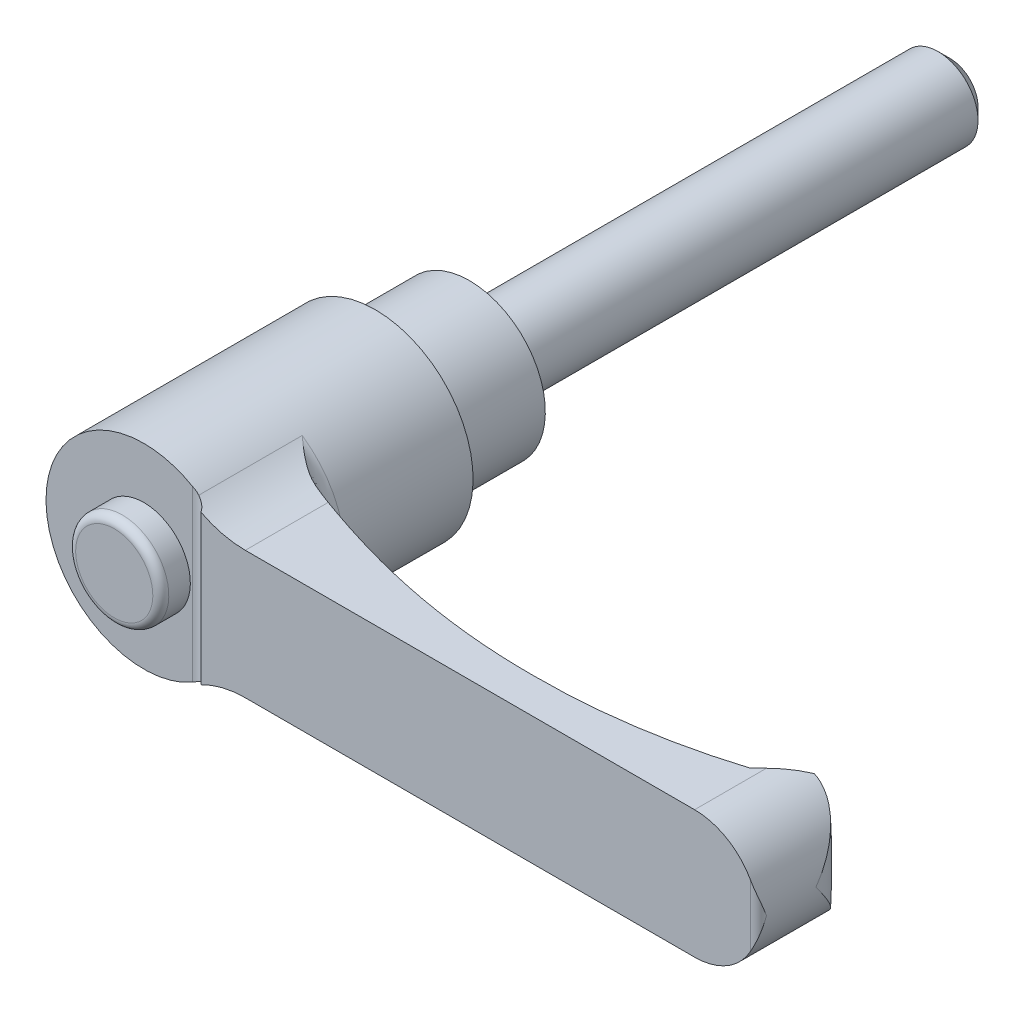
ISO-10303-21;
HEADER;
FILE_DESCRIPTION(('STEP AP214'),'2;1');
FILE_NAME('part.step','',(''),(''),'','','');
FILE_SCHEMA(('AUTOMOTIVE_DESIGN { 1 0 10303 214 1 1 1 1 }'));
ENDSEC;
DATA;
#1=APPLICATION_CONTEXT('core data for automotive mechanical design processes');
#2=APPLICATION_PROTOCOL_DEFINITION('international standard','automotive_design',2000,#1);
#3=PRODUCT_CONTEXT('',#1,'mechanical');
#4=PRODUCT('Part','Part','',(#3));
#5=PRODUCT_RELATED_PRODUCT_CATEGORY('part','',(#4));
#6=PRODUCT_DEFINITION_FORMATION('','',#4);
#7=PRODUCT_DEFINITION_CONTEXT('part definition',#1,'design');
#8=PRODUCT_DEFINITION('design','',#6,#7);
#9=PRODUCT_DEFINITION_SHAPE('','',#8);
#10=(LENGTH_UNIT() NAMED_UNIT(*) SI_UNIT(.MILLI.,.METRE.));
#11=(NAMED_UNIT(*) PLANE_ANGLE_UNIT() SI_UNIT($,.RADIAN.));
#12=(NAMED_UNIT(*) SI_UNIT($,.STERADIAN.) SOLID_ANGLE_UNIT());
#13=UNCERTAINTY_MEASURE_WITH_UNIT(LENGTH_MEASURE(1.E-05),#10,'distance_accuracy_value','');
#14=(GEOMETRIC_REPRESENTATION_CONTEXT(3) GLOBAL_UNCERTAINTY_ASSIGNED_CONTEXT((#13)) GLOBAL_UNIT_ASSIGNED_CONTEXT((#10,
#11,#12)) REPRESENTATION_CONTEXT('',''));
#15=CARTESIAN_POINT('',(0.,0.,0.));
#16=DIRECTION('',(0.,0.,1.));
#17=DIRECTION('',(1.,0.,0.));
#18=AXIS2_PLACEMENT_3D('',#15,#16,#17);
#19=CARTESIAN_POINT('',(7.6,0.,0.));
#20=DIRECTION('',(0.,0.,1.));
#21=DIRECTION('',(0.,-1.,0.));
#22=AXIS2_PLACEMENT_3D('',#19,#20,#21);
#23=PLANE('',#22);
#24=CARTESIAN_POINT('',(0.,0.,0.));
#25=DIRECTION('',(0.,0.,-1.));
#26=DIRECTION('',(0.,1.,0.));
#27=AXIS2_PLACEMENT_3D('',#24,#25,#26);
#28=CIRCLE('',#27,5.);
#29=CARTESIAN_POINT('',(0.,5.,0.));
#30=VERTEX_POINT('',#29);
#31=EDGE_CURVE('E422',#30,#30,#28,.T.);
#32=ORIENTED_EDGE('',*,*,#31,.F.);
#33=EDGE_LOOP('',(#32));
#34=FACE_BOUND('',#33,.T.);
#35=CARTESIAN_POINT('',(0.,0.,0.));
#36=DIRECTION('',(0.,0.,-1.));
#37=DIRECTION('',(0.,1.,0.));
#38=AXIS2_PLACEMENT_3D('',#35,#36,#37);
#39=CIRCLE('',#38,7.6);
#40=CARTESIAN_POINT('',(0.,7.6,0.));
#41=VERTEX_POINT('',#40);
#42=EDGE_CURVE('E347',#41,#41,#39,.T.);
#43=ORIENTED_EDGE('',*,*,#42,.T.);
#44=EDGE_LOOP('',(#43));
#45=FACE_BOUND('',#44,.T.);
#46=ADVANCED_FACE('F14',(#34,#45),#23,.F.);
#47=CARTESIAN_POINT('',(0.,0.,41.));
#48=DIRECTION('',(0.,0.,-1.));
#49=DIRECTION('',(0.,1.,0.));
#50=AXIS2_PLACEMENT_3D('',#47,#48,#49);
#51=PLANE('',#50);
#52=DIRECTION('',(0.,1.,0.));
#53=VECTOR('',#52,1.);
#54=CARTESIAN_POINT('',(6.125,-16.,41.));
#55=LINE('',#54,#53);
#56=CARTESIAN_POINT('',(6.125,-10.6088111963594,41.));
#57=VERTEX_POINT('',#56);
#58=CARTESIAN_POINT('',(6.125,10.6088111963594,41.));
#59=VERTEX_POINT('',#58);
#60=EDGE_CURVE('E385',#57,#59,#55,.T.);
#61=ORIENTED_EDGE('',*,*,#60,.T.);
#62=CARTESIAN_POINT('',(0.,0.,41.));
#63=DIRECTION('',(0.,0.,-1.));
#64=DIRECTION('',(0.,1.,0.));
#65=AXIS2_PLACEMENT_3D('',#62,#63,#64);
#66=CIRCLE('',#65,12.25);
#67=EDGE_CURVE('E332',#57,#59,#66,.T.);
#68=ORIENTED_EDGE('',*,*,#67,.F.);
#69=EDGE_LOOP('',(#61,#68));
#70=FACE_BOUND('',#69,.T.);
#71=CARTESIAN_POINT('',(0.,0.,41.));
#72=DIRECTION('',(0.,0.,-1.));
#73=DIRECTION('',(0.,1.,0.));
#74=AXIS2_PLACEMENT_3D('',#71,#72,#73);
#75=CIRCLE('',#74,5.83333333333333);
#76=CARTESIAN_POINT('',(0.,5.83333333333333,41.));
#77=VERTEX_POINT('',#76);
#78=EDGE_CURVE('E193',#77,#77,#75,.F.);
#79=ORIENTED_EDGE('',*,*,#78,.F.);
#80=EDGE_LOOP('',(#79));
#81=FACE_BOUND('',#80,.T.);
#82=ADVANCED_FACE('F163',(#70,#81),#51,.F.);
#83=CARTESIAN_POINT('',(70.,0.,0.));
#84=DIRECTION('',(0.,0.,1.));
#85=DIRECTION('',(0.,-1.,0.));
#86=AXIS2_PLACEMENT_3D('',#83,#84,#85);
#87=CYLINDRICAL_SURFACE('',#86,8.);
#88=CARTESIAN_POINT('',(78.,0.,34.8));
#89=CARTESIAN_POINT('',(78.0000000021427,-0.00507455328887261,34.7962762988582));
#90=CARTESIAN_POINT('',(77.9999951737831,-0.0101492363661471,34.7925524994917));
#91=CARTESIAN_POINT('',(77.9989416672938,-0.563628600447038,34.3864095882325));
#92=CARTESIAN_POINT('',(77.9414802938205,-1.11346566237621,33.9829298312));
#93=CARTESIAN_POINT('',(77.7692220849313,-1.92787753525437,33.38939297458));
#94=CARTESIAN_POINT('',(77.697249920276,-2.19810314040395,33.1931504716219));
#95=CARTESIAN_POINT('',(77.5237934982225,-2.73341157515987,32.8066637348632));
#96=CARTESIAN_POINT('',(77.4223242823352,-2.99849695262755,32.6164164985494));
#97=CARTESIAN_POINT('',(77.2199237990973,-3.45210642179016,32.2938177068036));
#98=CARTESIAN_POINT('',(77.1259458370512,-3.64233939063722,32.1594598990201));
#99=CARTESIAN_POINT('',(76.9211711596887,-4.01785016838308,31.8966888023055));
#100=CARTESIAN_POINT('',(76.8103745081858,-4.20312799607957,31.7682754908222));
#101=CARTESIAN_POINT('',(76.5717542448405,-4.56719869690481,31.5191542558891));
#102=CARTESIAN_POINT('',(76.4439640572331,-4.74600344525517,31.3984318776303));
#103=CARTESIAN_POINT('',(76.1708976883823,-5.09601175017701,31.1663364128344));
#104=CARTESIAN_POINT('',(76.0256268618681,-5.26721761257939,31.0549604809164));
#105=CARTESIAN_POINT('',(75.6441829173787,-5.67932922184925,30.7937387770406));
#106=CARTESIAN_POINT('',(75.3974573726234,-5.9150123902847,30.6505327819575));
#107=CARTESIAN_POINT('',(74.9987611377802,-6.24839682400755,30.4615945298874));
#108=CARTESIAN_POINT('',(74.8611020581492,-6.35616332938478,30.4029292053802));
#109=CARTESIAN_POINT('',(74.5764070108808,-6.56410843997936,30.2956150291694));
#110=CARTESIAN_POINT('',(74.429373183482,-6.66428876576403,30.2469639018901));
#111=CARTESIAN_POINT('',(74.1592544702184,-6.83522850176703,30.1705684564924));
#112=CARTESIAN_POINT('',(74.0378615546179,-6.90766708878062,30.1405781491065));
#113=CARTESIAN_POINT('',(73.7901015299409,-7.04665102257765,30.0886005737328));
#114=CARTESIAN_POINT('',(73.6637356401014,-7.11319780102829,30.0666113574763));
#115=CARTESIAN_POINT('',(73.4066843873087,-7.23982141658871,30.0315221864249));
#116=CARTESIAN_POINT('',(73.2760017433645,-7.2999022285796,30.0184167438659));
#117=CARTESIAN_POINT('',(73.0110423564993,-7.41312181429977,30.0019547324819));
#118=CARTESIAN_POINT('',(72.8767656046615,-7.46626057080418,29.9985981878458));
#119=CARTESIAN_POINT('',(72.6044130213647,-7.56559501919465,30.0024862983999));
#120=CARTESIAN_POINT('',(72.4663137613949,-7.6117232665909,30.009827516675));
#121=CARTESIAN_POINT('',(72.1887878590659,-7.69611880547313,30.0360283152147));
#122=CARTESIAN_POINT('',(72.0493611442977,-7.73438566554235,30.0548885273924));
#123=CARTESIAN_POINT('',(71.770740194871,-7.80288648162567,30.1046814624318));
#124=CARTESIAN_POINT('',(71.6315458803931,-7.83312431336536,30.1356083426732));
#125=CARTESIAN_POINT('',(71.3550409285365,-7.885663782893,30.2098119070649));
#126=CARTESIAN_POINT('',(71.217729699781,-7.90796796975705,30.2530846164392));
#127=CARTESIAN_POINT('',(70.8920238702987,-7.95241951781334,30.3719934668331));
#128=CARTESIAN_POINT('',(70.7052564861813,-7.97090772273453,30.4536477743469));
#129=CARTESIAN_POINT('',(70.433708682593,-7.98875485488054,30.5937624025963));
#130=CARTESIAN_POINT('',(70.3445710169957,-7.99305594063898,30.6434445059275));
#131=CARTESIAN_POINT('',(70.1696001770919,-7.99868029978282,30.7485120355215));
#132=CARTESIAN_POINT('',(70.0837676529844,-8.00000299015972,30.8038985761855));
#133=CARTESIAN_POINT('',(69.9998,-7.9999999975,30.8620428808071));
#134=B_SPLINE_CURVE_WITH_KNOTS('',3,(#88,#89,#90,#91,#92,#93,#94,#95,#96,#97,#98,#99,#100,#101,
#102,#103,#104,#105,#106,#107,#108,#109,#110,#111,#112,#113,#114,#115,#116,#117,#118,#119,#120,
#121,#122,#123,#124,#125,#126,#127,#128,#129,#130,#131,#132,#133),.UNSPECIFIED.,.F.,.F.,(4,2,2,
2,2,2,2,2,2,2,2,2,2,2,2,2,2,2,2,2,2,2,4),(0.,0.0188831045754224,2.05946970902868,
3.08347088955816,4.10695081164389,4.85978230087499,5.6126109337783,6.36398015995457,
7.11511980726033,8.22062566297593,8.77332293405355,9.32589447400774,9.75904172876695,
10.1920834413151,10.624857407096,11.0576324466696,11.4943381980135,11.9310679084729,
12.3675864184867,12.8039645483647,13.4155655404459,13.721767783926,14.0280299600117),.UNSPECIFIED.);
#135=CARTESIAN_POINT('',(72.9968893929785,-7.41745603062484,30.0031106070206));
#136=VERTEX_POINT('',#135);
#137=CARTESIAN_POINT('',(78.,0.,34.8));
#138=VERTEX_POINT('',#137);
#139=EDGE_CURVE('E126',#136,#138,#134,.F.);
#140=ORIENTED_EDGE('',*,*,#139,.T.);
#141=CARTESIAN_POINT('',(78.,0.,34.8));
#142=CARTESIAN_POINT('',(78.0000000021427,0.00507455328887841,34.7962762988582));
#143=CARTESIAN_POINT('',(77.9999951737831,0.0101492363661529,34.7925524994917));
#144=CARTESIAN_POINT('',(77.9989416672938,0.563628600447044,34.3864095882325));
#145=CARTESIAN_POINT('',(77.9414802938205,1.11346566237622,33.9829298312));
#146=CARTESIAN_POINT('',(77.7692220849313,1.92787753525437,33.38939297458));
#147=CARTESIAN_POINT('',(77.697249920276,2.19810314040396,33.1931504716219));
#148=CARTESIAN_POINT('',(77.5237934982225,2.73341157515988,32.8066637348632));
#149=CARTESIAN_POINT('',(77.4223242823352,2.99849695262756,32.6164164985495));
#150=CARTESIAN_POINT('',(77.2199237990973,3.45210642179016,32.2938177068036));
#151=CARTESIAN_POINT('',(77.1259458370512,3.64233939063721,32.1594598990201));
#152=CARTESIAN_POINT('',(76.9211711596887,4.01785016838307,31.8966888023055));
#153=CARTESIAN_POINT('',(76.8103745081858,4.20312799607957,31.7682754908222));
#154=CARTESIAN_POINT('',(76.5717542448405,4.56719869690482,31.5191542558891));
#155=CARTESIAN_POINT('',(76.4439640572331,4.74600344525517,31.3984318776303));
#156=CARTESIAN_POINT('',(76.1708976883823,5.09601175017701,31.1663364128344));
#157=CARTESIAN_POINT('',(76.0256268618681,5.26721761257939,31.0549604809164));
#158=CARTESIAN_POINT('',(75.6441829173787,5.67932922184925,30.7937387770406));
#159=CARTESIAN_POINT('',(75.3974573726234,5.91501239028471,30.6505327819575));
#160=CARTESIAN_POINT('',(74.9987611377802,6.24839682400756,30.4615945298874));
#161=CARTESIAN_POINT('',(74.8611020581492,6.35616332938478,30.4029292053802));
#162=CARTESIAN_POINT('',(74.5764070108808,6.56410843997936,30.2956150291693));
#163=CARTESIAN_POINT('',(74.429373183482,6.66428876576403,30.2469639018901));
#164=CARTESIAN_POINT('',(74.1592544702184,6.83522850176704,30.1705684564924));
#165=CARTESIAN_POINT('',(74.0378615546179,6.90766708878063,30.1405781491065));
#166=CARTESIAN_POINT('',(73.7901015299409,7.04665102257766,30.0886005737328));
#167=CARTESIAN_POINT('',(73.6637356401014,7.11319780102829,30.0666113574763));
#168=CARTESIAN_POINT('',(73.4066843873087,7.23982141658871,30.0315221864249));
#169=CARTESIAN_POINT('',(73.2760017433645,7.2999022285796,30.0184167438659));
#170=CARTESIAN_POINT('',(73.0110423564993,7.41312181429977,30.0019547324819));
#171=CARTESIAN_POINT('',(72.8767656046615,7.46626057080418,29.9985981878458));
#172=CARTESIAN_POINT('',(72.6044130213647,7.56559501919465,30.0024862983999));
#173=CARTESIAN_POINT('',(72.4663137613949,7.61172326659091,30.009827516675));
#174=CARTESIAN_POINT('',(72.1887878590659,7.69611880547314,30.0360283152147));
#175=CARTESIAN_POINT('',(72.0493611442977,7.73438566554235,30.0548885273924));
#176=CARTESIAN_POINT('',(71.770740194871,7.80288648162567,30.1046814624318));
#177=CARTESIAN_POINT('',(71.6315458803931,7.83312431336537,30.1356083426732));
#178=CARTESIAN_POINT('',(71.3550409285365,7.885663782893,30.2098119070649));
#179=CARTESIAN_POINT('',(71.217729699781,7.90796796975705,30.2530846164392));
#180=CARTESIAN_POINT('',(70.8920238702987,7.95241951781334,30.3719934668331));
#181=CARTESIAN_POINT('',(70.7052564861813,7.97090772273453,30.4536477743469));
#182=CARTESIAN_POINT('',(70.433708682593,7.98875485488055,30.5937624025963));
#183=CARTESIAN_POINT('',(70.3445710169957,7.99305594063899,30.6434445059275));
#184=CARTESIAN_POINT('',(70.1696001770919,7.99868029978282,30.7485120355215));
#185=CARTESIAN_POINT('',(70.0837676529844,8.00000299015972,30.8038985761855));
#186=CARTESIAN_POINT('',(69.9998,7.9999999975,30.8620428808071));
#187=B_SPLINE_CURVE_WITH_KNOTS('',3,(#141,#142,#143,#144,#145,#146,#147,#148,#149,#150,#151,
#152,#153,#154,#155,#156,#157,#158,#159,#160,#161,#162,#163,#164,#165,#166,#167,#168,#169,#170,
#171,#172,#173,#174,#175,#176,#177,#178,#179,#180,#181,#182,#183,#184,#185,#186),.UNSPECIFIED.,
.F.,.F.,(4,2,2,2,2,2,2,2,2,2,2,2,2,2,2,2,2,2,2,2,2,2,4),(0.,0.0188831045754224,2.05946970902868,
3.08347088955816,4.10695081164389,4.85978230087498,5.61261093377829,6.36398015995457,
7.11511980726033,8.22062566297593,8.77332293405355,9.32589447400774,9.75904172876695,
10.1920834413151,10.6248574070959,11.0576324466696,11.4943381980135,11.9310679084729,
12.3675864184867,12.8039645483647,13.4155655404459,13.721767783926,14.0280299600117),.UNSPECIFIED.);
#188=CARTESIAN_POINT('',(72.9968893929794,7.41745603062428,30.0031106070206));
#189=VERTEX_POINT('',#188);
#190=EDGE_CURVE('E123',#138,#189,#187,.T.);
#191=ORIENTED_EDGE('',*,*,#190,.T.);
#192=CARTESIAN_POINT('',(70.,0.,33.));
#193=DIRECTION('',(-0.707106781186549,0.,-0.707106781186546));
#194=DIRECTION('',(-0.707106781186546,0.,0.707106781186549));
#195=AXIS2_PLACEMENT_3D('',#192,#193,#194);
#196=ELLIPSE('',#195,11.3137084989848,8.);
#197=CARTESIAN_POINT('',(70.,8.,33.));
#198=VERTEX_POINT('',#197);
#199=EDGE_CURVE('E378',#189,#198,#196,.F.);
#200=ORIENTED_EDGE('',*,*,#199,.T.);
#201=DIRECTION('',(0.,0.,1.));
#202=VECTOR('',#201,1.);
#203=CARTESIAN_POINT('',(70.,8.,0.));
#204=LINE('',#203,#202);
#205=CARTESIAN_POINT('',(70.,8.,42.));
#206=VERTEX_POINT('',#205);
#207=EDGE_CURVE('E354',#198,#206,#204,.T.);
#208=ORIENTED_EDGE('',*,*,#207,.T.);
#209=CARTESIAN_POINT('',(70.,0.,42.));
#210=DIRECTION('',(0.,0.,1.));
#211=DIRECTION('',(0.,-1.,0.));
#212=AXIS2_PLACEMENT_3D('',#209,#210,#211);
#213=CIRCLE('',#212,8.);
#214=CARTESIAN_POINT('',(77.,3.87298334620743,42.));
#215=VERTEX_POINT('',#214);
#216=EDGE_CURVE('E327',#215,#206,#213,.T.);
#217=ORIENTED_EDGE('',*,*,#216,.F.);
#218=CARTESIAN_POINT('',(77.,3.87298334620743,42.));
#219=CARTESIAN_POINT('',(77.0320487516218,3.8150611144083,41.9999909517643));
#220=CARTESIAN_POINT('',(77.0633658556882,3.75675902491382,41.9984605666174));
#221=CARTESIAN_POINT('',(77.1244803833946,3.63952511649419,41.99269833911));
#222=CARTESIAN_POINT('',(77.1542784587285,3.58059358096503,41.9884676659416));
#223=CARTESIAN_POINT('',(77.241218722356,3.40324230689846,41.9722589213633));
#224=CARTESIAN_POINT('',(77.2960525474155,3.28400247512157,41.9567609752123));
#225=CARTESIAN_POINT('',(77.3991566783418,3.04456972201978,41.9185214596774));
#226=CARTESIAN_POINT('',(77.4474555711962,2.9243835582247,41.8958129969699));
#227=CARTESIAN_POINT('',(77.5378429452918,2.68282861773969,41.8446429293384));
#228=CARTESIAN_POINT('',(77.5799268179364,2.56145903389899,41.8161770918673));
#229=CARTESIAN_POINT('',(77.6827368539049,2.24038507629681,41.7351721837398));
#230=CARTESIAN_POINT('',(77.7382927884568,2.03996193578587,41.6788382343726));
#231=CARTESIAN_POINT('',(77.8332865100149,1.63779800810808,41.55814944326));
#232=CARTESIAN_POINT('',(77.8727175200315,1.43605670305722,41.4937912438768));
#233=CARTESIAN_POINT('',(77.967421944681,0.829293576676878,41.2932012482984));
#234=CARTESIAN_POINT('',(77.999127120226,0.42266785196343,41.1494356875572));
#235=CARTESIAN_POINT('',(77.9999940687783,0.0112434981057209,41.0039751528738));
#236=CARTESIAN_POINT('',(77.9999999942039,0.00562166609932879,41.0019875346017));
#237=CARTESIAN_POINT('',(78.,0.,41.));
#238=B_SPLINE_CURVE_WITH_KNOTS('',3,(#218,#219,#220,#221,#222,#223,#224,#225,#226,#227,#228,
#229,#230,#231,#232,#233,#234,#235,#236,#237),.UNSPECIFIED.,.F.,.F.,(4,2,2,2,2,2,2,2,2,4),(0.,
0.198535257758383,0.396984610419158,0.792983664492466,1.18719018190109,1.5816875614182,
2.22713013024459,2.8728436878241,4.16406208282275,4.18195063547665),.UNSPECIFIED.);
#239=CARTESIAN_POINT('',(78.,0.,41.));
#240=VERTEX_POINT('',#239);
#241=EDGE_CURVE('E179',#240,#215,#238,.F.);
#242=ORIENTED_EDGE('',*,*,#241,.F.);
#243=CARTESIAN_POINT('',(77.,-3.87298334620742,42.));
#244=CARTESIAN_POINT('',(77.0320487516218,-3.81506111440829,41.9999909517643));
#245=CARTESIAN_POINT('',(77.0633658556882,-3.75675902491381,41.9984605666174));
#246=CARTESIAN_POINT('',(77.1244803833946,-3.63952511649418,41.99269833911));
#247=CARTESIAN_POINT('',(77.1542784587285,-3.58059358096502,41.9884676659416));
#248=CARTESIAN_POINT('',(77.241218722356,-3.40324230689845,41.9722589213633));
#249=CARTESIAN_POINT('',(77.2960525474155,-3.28400247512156,41.9567609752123));
#250=CARTESIAN_POINT('',(77.3991566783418,-3.04456972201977,41.9185214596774));
#251=CARTESIAN_POINT('',(77.4474555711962,-2.92438355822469,41.8958129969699));
#252=CARTESIAN_POINT('',(77.5378429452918,-2.68282861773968,41.8446429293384));
#253=CARTESIAN_POINT('',(77.5799268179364,-2.56145903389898,41.8161770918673));
#254=CARTESIAN_POINT('',(77.6827368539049,-2.2403850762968,41.7351721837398));
#255=CARTESIAN_POINT('',(77.7382927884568,-2.03996193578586,41.6788382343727));
#256=CARTESIAN_POINT('',(77.8332865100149,-1.63779800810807,41.55814944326));
#257=CARTESIAN_POINT('',(77.8727175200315,-1.43605670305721,41.4937912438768));
#258=CARTESIAN_POINT('',(77.967421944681,-0.829293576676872,41.2932012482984));
#259=CARTESIAN_POINT('',(77.999127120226,-0.422667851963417,41.1494356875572));
#260=CARTESIAN_POINT('',(77.9999940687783,-0.0112434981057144,41.0039751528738));
#261=CARTESIAN_POINT('',(77.9999999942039,-0.00562166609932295,41.0019875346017));
#262=CARTESIAN_POINT('',(78.,0.,41.));
#263=B_SPLINE_CURVE_WITH_KNOTS('',3,(#243,#244,#245,#246,#247,#248,#249,#250,#251,#252,#253,
#254,#255,#256,#257,#258,#259,#260,#261,#262),.UNSPECIFIED.,.F.,.F.,(4,2,2,2,2,2,2,2,2,4),(0.,
0.19853525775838,0.396984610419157,0.792983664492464,1.18719018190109,1.5816875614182,
2.2271301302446,2.8728436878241,4.16406208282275,4.18195063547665),.UNSPECIFIED.);
#264=CARTESIAN_POINT('',(77.,-3.87298334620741,42.));
#265=VERTEX_POINT('',#264);
#266=EDGE_CURVE('E187',#265,#240,#263,.T.);
#267=ORIENTED_EDGE('',*,*,#266,.F.);
#268=CARTESIAN_POINT('',(70.,-8.,42.));
#269=VERTEX_POINT('',#268);
#270=EDGE_CURVE('E322',#269,#265,#213,.T.);
#271=ORIENTED_EDGE('',*,*,#270,.F.);
#272=DIRECTION('',(0.,0.,1.));
#273=VECTOR('',#272,1.);
#274=CARTESIAN_POINT('',(70.,-8.,0.));
#275=LINE('',#274,#273);
#276=CARTESIAN_POINT('',(70.,-8.,33.));
#277=VERTEX_POINT('',#276);
#278=EDGE_CURVE('E357',#277,#269,#275,.T.);
#279=ORIENTED_EDGE('',*,*,#278,.F.);
#280=EDGE_CURVE('E137',#277,#136,#196,.F.);
#281=ORIENTED_EDGE('',*,*,#280,.T.);
#282=EDGE_LOOP('',(#140,#191,#200,#208,#217,#242,#267,#271,#279,#281));
#283=FACE_BOUND('',#282,.T.);
#284=ADVANCED_FACE('F135',(#283),#87,.T.);
#285=CARTESIAN_POINT('',(73.,-16.,30.));
#286=DIRECTION('',(-0.707106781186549,0.,-0.707106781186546));
#287=DIRECTION('',(0.707106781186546,0.,-0.707106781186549));
#288=AXIS2_PLACEMENT_3D('',#285,#286,#287);
#289=PLANE('',#288);
#290=DIRECTION('',(0.,1.,0.));
#291=VECTOR('',#290,1.);
#292=CARTESIAN_POINT('',(73.,-16.,30.));
#293=LINE('',#292,#291);
#294=CARTESIAN_POINT('',(73.,-5.40740233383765,30.));
#295=VERTEX_POINT('',#294);
#296=CARTESIAN_POINT('',(73.,5.40740233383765,30.));
#297=VERTEX_POINT('',#296);
#298=EDGE_CURVE('E397',#295,#297,#293,.T.);
#299=ORIENTED_EDGE('',*,*,#298,.F.);
#300=CARTESIAN_POINT('',(72.9944134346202,8.0002,30.0055865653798));
#301=CARTESIAN_POINT('',(72.9964174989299,7.60019527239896,30.0035825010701));
#302=CARTESIAN_POINT('',(72.9977626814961,7.20018596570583,30.0022373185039));
#303=CARTESIAN_POINT('',(72.9994970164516,6.40016550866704,30.0005029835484));
#304=CARTESIAN_POINT('',(72.9998861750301,6.00015435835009,30.0001138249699));
#305=CARTESIAN_POINT('',(73.0000702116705,5.20013335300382,29.9999297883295));
#306=CARTESIAN_POINT('',(72.9998650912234,4.80012349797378,30.0001349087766));
#307=CARTESIAN_POINT('',(72.9991717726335,4.00010369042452,30.0008282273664));
#308=CARTESIAN_POINT('',(72.998683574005,3.60009373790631,30.001316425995));
#309=CARTESIAN_POINT('',(72.9972116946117,2.40006658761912,30.0027883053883));
#310=CARTESIAN_POINT('',(72.9962207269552,1.60004928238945,30.0037792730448));
#311=CARTESIAN_POINT('',(72.9954610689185,1.3601944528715E-05,30.0045389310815));
#312=CARTESIAN_POINT('',(72.9956923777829,-0.800004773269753,30.004307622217));
#313=CARTESIAN_POINT('',(72.9968584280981,-2.13336982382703,30.0031415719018));
#314=CARTESIAN_POINT('',(72.9975329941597,-2.66671710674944,30.0024670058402));
#315=CARTESIAN_POINT('',(72.9988528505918,-3.73341119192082,30.0011471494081));
#316=CARTESIAN_POINT('',(72.999498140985,-4.26675799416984,30.000501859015));
#317=CARTESIAN_POINT('',(73.000124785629,-5.33345534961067,29.999875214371));
#318=CARTESIAN_POINT('',(73.0001061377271,-5.86680590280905,29.9998938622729));
#319=CARTESIAN_POINT('',(72.9985813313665,-6.93350631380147,30.0014186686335));
#320=CARTESIAN_POINT('',(72.997075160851,-7.46685617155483,30.002924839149));
#321=CARTESIAN_POINT('',(72.9944134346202,-8.0002,30.0055865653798));
#322=B_SPLINE_CURVE_WITH_KNOTS('',3,(#300,#301,#302,#303,#304,#305,#306,#307,#308,#309,#310,
#311,#312,#313,#314,#315,#316,#317,#318,#319,#320,#321),.UNSPECIFIED.,.F.,.F.,(4,2,2,2,2,2,2,2,
2,2,4),(0.,1.20004037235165,2.40007297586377,3.60010256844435,4.80013422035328,7.20018907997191,
9.60024245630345,11.2002867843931,12.8003298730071,14.4003781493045,16.0004393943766),.UNSPECIFIED.);
#323=EDGE_CURVE('E138',#295,#136,#322,.T.);
#324=ORIENTED_EDGE('',*,*,#323,.T.);
#325=ORIENTED_EDGE('',*,*,#280,.F.);
#326=DIRECTION('',(-0.707106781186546,0.,0.707106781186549));
#327=VECTOR('',#326,1.);
#328=CARTESIAN_POINT('',(86.5,-8.,16.5));
#329=LINE('',#328,#327);
#330=CARTESIAN_POINT('',(69.,-8.,34.));
#331=VERTEX_POINT('',#330);
#332=EDGE_CURVE('E321',#277,#331,#329,.T.);
#333=ORIENTED_EDGE('',*,*,#332,.T.);
#334=DIRECTION('',(0.,1.,0.));
#335=VECTOR('',#334,1.);
#336=CARTESIAN_POINT('',(69.,-16.,34.));
#337=LINE('',#336,#335);
#338=CARTESIAN_POINT('',(69.,8.,34.));
#339=VERTEX_POINT('',#338);
#340=EDGE_CURVE('E319',#331,#339,#337,.T.);
#341=ORIENTED_EDGE('',*,*,#340,.T.);
#342=DIRECTION('',(0.707106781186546,0.,-0.707106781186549));
#343=VECTOR('',#342,1.);
#344=CARTESIAN_POINT('',(58.3567940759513,8.,44.6432059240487));
#345=LINE('',#344,#343);
#346=EDGE_CURVE('E375',#339,#198,#345,.T.);
#347=ORIENTED_EDGE('',*,*,#346,.T.);
#348=ORIENTED_EDGE('',*,*,#199,.F.);
#349=EDGE_CURVE('E129',#189,#297,#322,.T.);
#350=ORIENTED_EDGE('',*,*,#349,.T.);
#351=EDGE_LOOP('',(#299,#324,#325,#333,#341,#347,#348,#350));
#352=FACE_BOUND('',#351,.T.);
#353=ADVANCED_FACE('F162',(#352),#289,.T.);
#354=CARTESIAN_POINT('',(73.2,-16.,30.));
#355=DIRECTION('',(0.,0.,-1.));
#356=DIRECTION('',(0.,1.,0.));
#357=AXIS2_PLACEMENT_3D('',#354,#355,#356);
#358=PLANE('',#357);
#359=ORIENTED_EDGE('',*,*,#298,.T.);
#360=CARTESIAN_POINT('',(0.,0.,30.));
#361=DIRECTION('',(0.,0.,-1.));
#362=DIRECTION('',(0.,1.,0.));
#363=AXIS2_PLACEMENT_3D('',#360,#361,#362);
#364=CIRCLE('',#363,73.2);
#365=EDGE_CURVE('E36',#297,#295,#364,.T.);
#366=ORIENTED_EDGE('',*,*,#365,.T.);
#367=EDGE_LOOP('',(#359,#366));
#368=FACE_BOUND('',#367,.T.);
#369=ADVANCED_FACE('F201',(#368),#358,.T.);
#370=CARTESIAN_POINT('',(0.,0.,42.));
#371=DIRECTION('',(0.,0.,1.));
#372=DIRECTION('',(0.,-1.,0.));
#373=AXIS2_PLACEMENT_3D('',#370,#371,#372);
#374=PLANE('',#373);
#375=CARTESIAN_POINT('',(13.7135881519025,20.,42.));
#376=DIRECTION('',(0.,0.,1.));
#377=DIRECTION('',(1.,0.,0.));
#378=AXIS2_PLACEMENT_3D('',#375,#376,#377);
#379=CIRCLE('',#378,12.);
#380=CARTESIAN_POINT('',(8.16666666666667,9.35896330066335,42.));
#381=VERTEX_POINT('',#380);
#382=CARTESIAN_POINT('',(13.7135881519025,8.,42.));
#383=VERTEX_POINT('',#382);
#384=EDGE_CURVE('E372',#381,#383,#379,.T.);
#385=ORIENTED_EDGE('',*,*,#384,.F.);
#386=DIRECTION('',(0.,1.,0.));
#387=VECTOR('',#386,1.);
#388=CARTESIAN_POINT('',(8.16666666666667,-16.,42.));
#389=LINE('',#388,#387);
#390=CARTESIAN_POINT('',(8.16666666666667,-9.35896330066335,42.));
#391=VERTEX_POINT('',#390);
#392=EDGE_CURVE('E392',#391,#381,#389,.T.);
#393=ORIENTED_EDGE('',*,*,#392,.F.);
#394=CARTESIAN_POINT('',(13.7135881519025,-20.,42.));
#395=DIRECTION('',(0.,0.,1.));
#396=DIRECTION('',(1.,0.,0.));
#397=AXIS2_PLACEMENT_3D('',#394,#395,#396);
#398=CIRCLE('',#397,12.);
#399=CARTESIAN_POINT('',(13.7135881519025,-8.,42.));
#400=VERTEX_POINT('',#399);
#401=EDGE_CURVE('E363',#400,#391,#398,.T.);
#402=ORIENTED_EDGE('',*,*,#401,.F.);
#403=DIRECTION('',(-1.,0.,0.));
#404=VECTOR('',#403,1.);
#405=CARTESIAN_POINT('',(70.,-8.,42.));
#406=LINE('',#405,#404);
#407=EDGE_CURVE('E366',#269,#400,#406,.T.);
#408=ORIENTED_EDGE('',*,*,#407,.F.);
#409=ORIENTED_EDGE('',*,*,#270,.T.);
#410=DIRECTION('',(0.,1.,0.));
#411=VECTOR('',#410,1.);
#412=CARTESIAN_POINT('',(77.,-16.,42.));
#413=LINE('',#412,#411);
#414=EDGE_CURVE('E393',#265,#215,#413,.T.);
#415=ORIENTED_EDGE('',*,*,#414,.T.);
#416=ORIENTED_EDGE('',*,*,#216,.T.);
#417=DIRECTION('',(1.,0.,0.));
#418=VECTOR('',#417,1.);
#419=CARTESIAN_POINT('',(13.7135881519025,8.,42.));
#420=LINE('',#419,#418);
#421=EDGE_CURVE('E369',#383,#206,#420,.T.);
#422=ORIENTED_EDGE('',*,*,#421,.F.);
#423=EDGE_LOOP('',(#385,#393,#402,#408,#409,#415,#416,#422));
#424=FACE_BOUND('',#423,.T.);
#425=ADVANCED_FACE('F248',(#424),#374,.T.);
#426=CARTESIAN_POINT('',(0.,0.,0.));
#427=DIRECTION('',(0.,0.,-1.));
#428=DIRECTION('',(0.,1.,0.));
#429=AXIS2_PLACEMENT_3D('',#426,#427,#428);
#430=CYLINDRICAL_SURFACE('',#429,12.25);
#431=CARTESIAN_POINT('',(0.,0.,28.0779919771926));
#432=DIRECTION('',(0.,0.,-1.));
#433=DIRECTION('',(0.,1.,0.));
#434=AXIS2_PLACEMENT_3D('',#431,#432,#433);
#435=CIRCLE('',#434,12.25);
#436=CARTESIAN_POINT('',(6.92748267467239,10.1030927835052,28.0779919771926));
#437=VERTEX_POINT('',#436);
#438=CARTESIAN_POINT('',(6.92748267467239,-10.1030927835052,28.0779919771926));
#439=VERTEX_POINT('',#438);
#440=EDGE_CURVE('E412',#437,#439,#435,.T.);
#441=ORIENTED_EDGE('',*,*,#440,.T.);
#442=DIRECTION('',(0.,0.,1.));
#443=VECTOR('',#442,1.);
#444=CARTESIAN_POINT('',(6.92748267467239,-10.1030927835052,0.));
#445=LINE('',#444,#443);
#446=CARTESIAN_POINT('',(6.92748267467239,-10.1030927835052,41.0427567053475));
#447=VERTEX_POINT('',#446);
#448=EDGE_CURVE('E361',#439,#447,#445,.T.);
#449=ORIENTED_EDGE('',*,*,#448,.T.);
#450=CARTESIAN_POINT('',(6.125,-10.6088111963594,41.));
#451=CARTESIAN_POINT('',(6.19832883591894,-10.5664875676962,40.9889897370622));
#452=CARTESIAN_POINT('',(6.27164451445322,-10.523132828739,40.9821479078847));
#453=CARTESIAN_POINT('',(6.41753908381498,-10.4347921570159,40.9764986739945));
#454=CARTESIAN_POINT('',(6.49011843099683,-10.3898073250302,40.9776859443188));
#455=CARTESIAN_POINT('',(6.63402897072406,-10.2985167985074,40.9877856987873));
#456=CARTESIAN_POINT('',(6.70535828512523,-10.2522093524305,40.996708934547));
#457=CARTESIAN_POINT('',(6.84611057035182,-10.1587605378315,41.0220012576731));
#458=CARTESIAN_POINT('',(6.91553331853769,-10.1116190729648,41.0383712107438));
#459=CARTESIAN_POINT('',(7.10641045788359,-9.97916014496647,41.094233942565));
#460=CARTESIAN_POINT('',(7.22525798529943,-9.89334730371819,41.1417583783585));
#461=CARTESIAN_POINT('',(7.45241295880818,-9.72337963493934,41.2589427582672));
#462=CARTESIAN_POINT('',(7.56074253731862,-9.63922163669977,41.3285548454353));
#463=CARTESIAN_POINT('',(7.71168483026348,-9.51821587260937,41.4479066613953));
#464=CARTESIAN_POINT('',(7.75936397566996,-9.47936365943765,41.4893658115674));
#465=CARTESIAN_POINT('',(7.85125896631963,-9.40339173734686,41.5773725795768));
#466=CARTESIAN_POINT('',(7.89547657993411,-9.36627114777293,41.6239175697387));
#467=CARTESIAN_POINT('',(7.98020904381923,-9.29418452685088,41.7223463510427));
#468=CARTESIAN_POINT('',(8.02070494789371,-9.25922978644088,41.7742548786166));
#469=CARTESIAN_POINT('',(8.09722101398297,-9.19239515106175,41.8832605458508));
#470=CARTESIAN_POINT('',(8.13323329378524,-9.16052069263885,41.9403665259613));
#471=CARTESIAN_POINT('',(8.16666666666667,-9.13061090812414,42.));
#472=B_SPLINE_CURVE_WITH_KNOTS('',3,(#450,#451,#452,#453,#454,#455,#456,#457,#458,#459,#460,
#461,#462,#463,#464,#465,#466,#467,#468,#469,#470,#471),.UNSPECIFIED.,.F.,.F.,(4,2,2,2,2,2,2,2,
2,2,4),(0.,0.255975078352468,0.511780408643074,0.767941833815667,1.02413304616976,
1.48441304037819,1.94370248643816,2.16599787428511,2.38817894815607,2.61143478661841,
2.83507772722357),.UNSPECIFIED.);
#473=EDGE_CURVE('E222',#57,#447,#472,.T.);
#474=ORIENTED_EDGE('',*,*,#473,.F.);
#475=ORIENTED_EDGE('',*,*,#67,.T.);
#476=CARTESIAN_POINT('',(8.16666666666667,9.13061090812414,42.));
#477=CARTESIAN_POINT('',(8.13602850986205,9.15801692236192,41.9453523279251));
#478=CARTESIAN_POINT('',(8.10323346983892,9.18706943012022,41.8928397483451));
#479=CARTESIAN_POINT('',(8.03382107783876,9.24782874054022,41.7921703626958));
#480=CARTESIAN_POINT('',(7.99720910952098,9.27953179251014,41.7440075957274));
#481=CARTESIAN_POINT('',(7.88274220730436,9.37735907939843,41.6065497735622));
#482=CARTESIAN_POINT('',(7.79984772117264,9.44657197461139,41.5235775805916));
#483=CARTESIAN_POINT('',(7.62397737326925,9.58906879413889,41.3751924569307));
#484=CARTESIAN_POINT('',(7.53106018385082,9.66232791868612,41.3096843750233));
#485=CARTESIAN_POINT('',(7.33643153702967,9.81092784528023,41.1955319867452));
#486=CARTESIAN_POINT('',(7.23469620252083,9.88627389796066,41.1469353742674));
#487=CARTESIAN_POINT('',(7.00601089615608,10.0499435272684,41.0604339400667));
#488=CARTESIAN_POINT('',(6.87776073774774,10.1382349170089,41.0258797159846));
#489=CARTESIAN_POINT('',(6.61511692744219,10.3115145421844,40.9827504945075));
#490=CARTESIAN_POINT('',(6.48074133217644,10.3965112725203,40.9741035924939));
#491=CARTESIAN_POINT('',(6.30869788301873,10.5006996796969,40.9806991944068));
#492=CARTESIAN_POINT('',(6.27199131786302,10.5226640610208,40.9831161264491));
#493=CARTESIAN_POINT('',(6.19852568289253,10.5661055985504,40.9900077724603));
#494=CARTESIAN_POINT('',(6.16176668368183,10.5875831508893,40.9944807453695));
#495=CARTESIAN_POINT('',(6.125,10.6088111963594,41.));
#496=B_SPLINE_CURVE_WITH_KNOTS('',3,(#476,#477,#478,#479,#480,#481,#482,#483,#484,#485,#486,
#487,#488,#489,#490,#491,#492,#493,#494,#495),.UNSPECIFIED.,.F.,.F.,(4,2,2,2,2,2,2,2,2,4),(0.,
0.204930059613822,0.409574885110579,0.816210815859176,1.22058373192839,1.62608799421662,
2.10242753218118,2.57744378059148,2.7059409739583,2.83432955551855),.UNSPECIFIED.);
#497=CARTESIAN_POINT('',(6.92748267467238,10.1030927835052,41.0427567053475));
#498=VERTEX_POINT('',#497);
#499=EDGE_CURVE('E236',#498,#59,#496,.T.);
#500=ORIENTED_EDGE('',*,*,#499,.F.);
#501=DIRECTION('',(0.,0.,1.));
#502=VECTOR('',#501,1.);
#503=CARTESIAN_POINT('',(6.92748267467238,10.1030927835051,0.));
#504=LINE('',#503,#502);
#505=EDGE_CURVE('E350',#437,#498,#504,.T.);
#506=ORIENTED_EDGE('',*,*,#505,.F.);
#507=EDGE_LOOP('',(#441,#449,#474,#475,#500,#506));
#508=FACE_BOUND('',#507,.T.);
#509=CARTESIAN_POINT('',(0.,0.,12.));
#510=DIRECTION('',(0.,0.,-1.));
#511=DIRECTION('',(0.,1.,0.));
#512=AXIS2_PLACEMENT_3D('',#509,#510,#511);
#513=CIRCLE('',#512,12.25);
#514=CARTESIAN_POINT('',(0.,12.25,12.));
#515=VERTEX_POINT('',#514);
#516=EDGE_CURVE('E335',#515,#515,#513,.T.);
#517=ORIENTED_EDGE('',*,*,#516,.F.);
#518=EDGE_LOOP('',(#517));
#519=FACE_BOUND('',#518,.T.);
#520=ADVANCED_FACE('F246',(#508,#519),#430,.T.);
#521=CARTESIAN_POINT('',(13.7135881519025,20.,0.));
#522=DIRECTION('',(0.,0.,1.));
#523=DIRECTION('',(0.,-1.,0.));
#524=AXIS2_PLACEMENT_3D('',#521,#522,#523);
#525=CYLINDRICAL_SURFACE('',#524,12.);
#526=DIRECTION('',(0.,0.,1.));
#527=VECTOR('',#526,1.);
#528=CARTESIAN_POINT('',(13.7135881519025,8.,0.));
#529=LINE('',#528,#527);
#530=CARTESIAN_POINT('',(13.7135881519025,8.,31.611749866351));
#531=VERTEX_POINT('',#530);
#532=EDGE_CURVE('E352',#531,#383,#529,.T.);
#533=ORIENTED_EDGE('',*,*,#532,.F.);
#534=CARTESIAN_POINT('',(16.5591435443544,8.34226374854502,32.6591102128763));
#535=CARTESIAN_POINT('',(16.3261928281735,8.28540329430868,32.5722424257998));
#536=CARTESIAN_POINT('',(16.0917373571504,8.23557224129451,32.4848250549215));
#537=CARTESIAN_POINT('',(15.6204190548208,8.15004770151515,32.3095064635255));
#538=CARTESIAN_POINT('',(15.3835560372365,8.11435531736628,32.2216052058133));
#539=CARTESIAN_POINT('',(14.9085098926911,8.05724969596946,32.0461136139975));
#540=CARTESIAN_POINT('',(14.6703300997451,8.03580964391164,31.9585230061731));
#541=CARTESIAN_POINT('',(14.1928153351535,8.00718735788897,31.7842679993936));
#542=CARTESIAN_POINT('',(13.9534804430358,8.00000415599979,31.697603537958));
#543=CARTESIAN_POINT('',(13.3222890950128,7.99999321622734,31.4717100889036));
#544=CARTESIAN_POINT('',(12.9298365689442,8.01913869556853,31.3339527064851));
#545=CARTESIAN_POINT('',(12.1446747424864,8.09645283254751,31.0677464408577));
#546=CARTESIAN_POINT('',(11.7519664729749,8.15469870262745,30.9393165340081));
#547=CARTESIAN_POINT('',(11.0678445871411,8.29148603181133,30.7286186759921));
#548=CARTESIAN_POINT('',(10.7757440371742,8.36126529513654,30.6428547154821));
#549=CARTESIAN_POINT('',(10.1944299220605,8.52365043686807,30.4833757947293));
#550=CARTESIAN_POINT('',(9.90521727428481,8.61626334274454,30.4096645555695));
#551=CARTESIAN_POINT('',(9.33232622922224,8.82426158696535,30.2779606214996));
#552=CARTESIAN_POINT('',(9.04863462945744,8.93958259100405,30.219924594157));
#553=CARTESIAN_POINT('',(8.48843633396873,9.19295718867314,30.1227055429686));
#554=CARTESIAN_POINT('',(8.21192433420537,9.33099341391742,30.0835082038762));
#555=CARTESIAN_POINT('',(7.70530850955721,9.60902203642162,30.0304308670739));
#556=CARTESIAN_POINT('',(7.47397220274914,9.74624410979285,30.0138509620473));
#557=CARTESIAN_POINT('',(7.13386740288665,9.96379307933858,30.0017184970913));
#558=CARTESIAN_POINT('',(7.0215618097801,10.0383265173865,29.9998008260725));
#559=CARTESIAN_POINT('',(6.79949902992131,10.1911494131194,30.0002323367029));
#560=CARTESIAN_POINT('',(6.68974254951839,10.2694398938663,30.0025826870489));
#561=CARTESIAN_POINT('',(6.5813815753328,10.3495269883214,30.007070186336));
#562=B_SPLINE_CURVE_WITH_KNOTS('',3,(#534,#535,#536,#537,#538,#539,#540,#541,#542,#543,#544,
#545,#546,#547,#548,#549,#550,#551,#552,#553,#554,#555,#556,#557,#558,#559,#560,#561),
.UNSPECIFIED.,.F.,.F.,(4,2,2,2,2,2,2,2,2,2,2,2,2,4),(0.,0.765007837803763,1.53007532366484,
2.29369928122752,3.05727139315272,4.30444442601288,5.55408755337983,6.49010923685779,
7.42641935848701,8.36011402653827,9.29309806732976,10.100354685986,10.5046318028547,
10.9090196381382),.UNSPECIFIED.);
#563=CARTESIAN_POINT('',(11.361472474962,8.23277637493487,30.8190510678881));
#564=VERTEX_POINT('',#563);
#565=EDGE_CURVE('E262',#531,#564,#562,.T.);
#566=ORIENTED_EDGE('',*,*,#565,.T.);
#567=CARTESIAN_POINT('',(14.1569924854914,8.00819477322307,30.9010555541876));
#568=CARTESIAN_POINT('',(14.0595029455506,8.00457612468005,30.9322196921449));
#569=CARTESIAN_POINT('',(13.9606253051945,8.00212380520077,30.9590151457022));
#570=CARTESIAN_POINT('',(13.7610637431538,7.99968329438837,31.004218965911));
#571=CARTESIAN_POINT('',(13.6603822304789,7.99969203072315,31.0226377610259));
#572=CARTESIAN_POINT('',(13.4585847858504,8.00228706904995,31.0514218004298));
#573=CARTESIAN_POINT('',(13.3574757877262,8.00485682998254,31.061837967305));
#574=CARTESIAN_POINT('',(13.1548462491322,8.01258614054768,31.0753001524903));
#575=CARTESIAN_POINT('',(13.053325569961,8.01774665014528,31.0783434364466));
#576=CARTESIAN_POINT('',(12.8251352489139,8.0322613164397,31.0774805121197));
#577=CARTESIAN_POINT('',(12.6985166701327,8.04234092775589,31.07164895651));
#578=CARTESIAN_POINT('',(12.446446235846,8.06641586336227,31.0503579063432));
#579=CARTESIAN_POINT('',(12.3209952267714,8.08041382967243,31.0348919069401));
#580=CARTESIAN_POINT('',(11.9473264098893,8.12804907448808,30.9756133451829));
#581=CARTESIAN_POINT('',(11.7017310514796,8.16733172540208,30.9189189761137));
#582=CARTESIAN_POINT('',(11.4284283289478,8.21954129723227,30.8393902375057));
#583=CARTESIAN_POINT('',(11.3952261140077,8.22603104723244,30.829444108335));
#584=CARTESIAN_POINT('',(11.1613640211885,8.27276596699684,30.7574361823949));
#585=CARTESIAN_POINT('',(10.9642103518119,8.31751135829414,30.6865405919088));
#586=CARTESIAN_POINT('',(10.5777285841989,8.41525886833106,30.5303701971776));
#587=CARTESIAN_POINT('',(10.3884095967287,8.46827027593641,30.4450792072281));
#588=CARTESIAN_POINT('',(10.0168146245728,8.5819543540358,30.262829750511));
#589=CARTESIAN_POINT('',(9.83457244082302,8.64265900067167,30.1658226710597));
#590=CARTESIAN_POINT('',(9.47767438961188,8.77088665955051,29.9630240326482));
#591=CARTESIAN_POINT('',(9.30301613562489,8.83840750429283,29.8572352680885));
#592=CARTESIAN_POINT('',(8.93248691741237,8.99147577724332,29.6209801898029));
#593=CARTESIAN_POINT('',(8.73785326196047,9.07816138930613,29.4893172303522));
#594=CARTESIAN_POINT('',(8.35703282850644,9.25980318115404,29.2196101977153));
#595=CARTESIAN_POINT('',(8.17084790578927,9.35476116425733,29.0815647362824));
#596=CARTESIAN_POINT('',(7.80639286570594,9.55261034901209,28.801722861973));
#597=CARTESIAN_POINT('',(7.62810747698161,9.65548508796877,28.6599346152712));
#598=CARTESIAN_POINT('',(7.27822148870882,9.8694475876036,28.3744148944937));
#599=CARTESIAN_POINT('',(7.10661929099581,9.98053336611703,28.2306838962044));
#600=CARTESIAN_POINT('',(6.93448645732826,10.0982931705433,28.0839649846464));
#601=CARTESIAN_POINT('',(6.93098392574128,10.1006920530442,28.0809784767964));
#602=CARTESIAN_POINT('',(6.92748267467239,10.1030927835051,28.0779919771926));
#603=B_SPLINE_CURVE_WITH_KNOTS('',3,(#567,#568,#569,#570,#571,#572,#573,#574,#575,#576,#577,
#578,#579,#580,#581,#582,#583,#584,#585,#586,#587,#588,#589,#590,#591,#592,#593,#594,#595,#596,
#597,#598,#599,#600,#601,#602),.UNSPECIFIED.,.F.,.F.,(4,2,2,2,2,2,2,2,2,2,2,2,2,2,2,2,2,4),(0.,
0.307060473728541,0.613737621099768,0.918446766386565,1.2232689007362,1.60421628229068,
1.98542114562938,2.74764704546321,2.85344139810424,3.49502286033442,4.13733056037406,
4.78240133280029,5.42726761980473,6.17822336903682,6.9293432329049,7.67894130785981,
8.42835901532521,8.44393060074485),.UNSPECIFIED.);
#604=EDGE_CURVE('E253',#564,#437,#603,.T.);
#605=ORIENTED_EDGE('',*,*,#604,.T.);
#606=ORIENTED_EDGE('',*,*,#505,.T.);
#607=CARTESIAN_POINT('',(8.16666666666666,9.35896330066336,42.));
#608=CARTESIAN_POINT('',(8.13901649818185,9.37337657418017,41.9506476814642));
#609=CARTESIAN_POINT('',(8.10940958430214,9.3889470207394,41.9027481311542));
#610=CARTESIAN_POINT('',(8.04670483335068,9.42230209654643,41.8101553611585));
#611=CARTESIAN_POINT('',(8.01360925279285,9.44008529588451,41.7654600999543));
#612=CARTESIAN_POINT('',(7.9445192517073,9.47767235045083,41.679768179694));
#613=CARTESIAN_POINT('',(7.90854324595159,9.49746355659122,41.6387511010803));
#614=CARTESIAN_POINT('',(7.83394241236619,9.53904426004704,41.5603078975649));
#615=CARTESIAN_POINT('',(7.79531727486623,9.56083399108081,41.522882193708));
#616=CARTESIAN_POINT('',(7.67627287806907,9.628928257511,41.4163832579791));
#617=CARTESIAN_POINT('',(7.59246475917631,9.67807605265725,41.3528199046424));
#618=CARTESIAN_POINT('',(7.41892619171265,9.78297864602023,41.2409217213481));
#619=CARTESIAN_POINT('',(7.32918731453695,9.83874294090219,41.1926091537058));
#620=CARTESIAN_POINT('',(7.1868076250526,9.93000297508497,41.1289842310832));
#621=CARTESIAN_POINT('',(7.13520490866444,9.96362930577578,41.1085023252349));
#622=CARTESIAN_POINT('',(7.03159838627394,10.0323084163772,41.072203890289));
#623=CARTESIAN_POINT('',(6.97959668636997,10.0673556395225,41.0563708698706));
#624=CARTESIAN_POINT('',(6.92748267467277,10.1030927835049,41.0427567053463));
#625=B_SPLINE_CURVE_WITH_KNOTS('',3,(#607,#608,#609,#610,#611,#612,#613,#614,#615,#616,#617,
#618,#619,#620,#621,#622,#623,#624),.UNSPECIFIED.,.F.,.F.,(4,2,2,2,2,2,2,2,4),(0.,
0.17504734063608,0.349982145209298,0.52387635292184,0.697790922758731,1.04453417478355,
1.39178126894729,1.58634089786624,1.78020177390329),.UNSPECIFIED.);
#626=EDGE_CURVE('E230',#381,#498,#625,.T.);
#627=ORIENTED_EDGE('',*,*,#626,.F.);
#628=ORIENTED_EDGE('',*,*,#384,.T.);
#629=EDGE_LOOP('',(#533,#566,#605,#606,#627,#628));
#630=FACE_BOUND('',#629,.T.);
#631=ADVANCED_FACE('F242',(#630),#525,.F.);
#632=CARTESIAN_POINT('',(13.7135881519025,8.,0.));
#633=DIRECTION('',(0.,-1.,0.));
#634=DIRECTION('',(1.,0.,0.));
#635=AXIS2_PLACEMENT_3D('',#632,#633,#634);
#636=PLANE('',#635);
#637=CARTESIAN_POINT('',(45.7315011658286,8.,-40.4484852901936));
#638=DIRECTION('',(0.,-1.,0.));
#639=DIRECTION('',(1.,0.,0.));
#640=AXIS2_PLACEMENT_3D('',#637,#638,#639);
#641=CIRCLE('',#640,78.);
#642=CARTESIAN_POINT('',(45.3816329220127,8.00000000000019,37.5507300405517));
#643=VERTEX_POINT('',#642);
#644=EDGE_CURVE('E379',#643,#339,#641,.F.);
#645=ORIENTED_EDGE('',*,*,#644,.F.);
#646=CARTESIAN_POINT('',(41.2013215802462,8.,37.4608030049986));
#647=CARTESIAN_POINT('',(39.9809181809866,8.,37.4029725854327));
#648=CARTESIAN_POINT('',(38.761796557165,8.,37.3175877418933));
#649=CARTESIAN_POINT('',(36.3285638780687,8.,37.0925358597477));
#650=CARTESIAN_POINT('',(35.1144529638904,8.,36.9528673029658));
#651=CARTESIAN_POINT('',(32.6938673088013,8.,36.620494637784));
#652=CARTESIAN_POINT('',(31.4873906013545,8.,36.4278048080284));
#653=CARTESIAN_POINT('',(29.0837615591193,8.,35.9910366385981));
#654=CARTESIAN_POINT('',(27.8866092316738,8.,35.7469582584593));
#655=CARTESIAN_POINT('',(26.0963309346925,8.,35.3434938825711));
#656=CARTESIAN_POINT('',(25.4990195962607,8.,35.2023884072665));
#657=CARTESIAN_POINT('',(24.307345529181,8.,34.9082411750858));
#658=CARTESIAN_POINT('',(23.7129827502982,8.,34.7551996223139));
#659=CARTESIAN_POINT('',(22.5273511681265,8.,34.4376835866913));
#660=CARTESIAN_POINT('',(21.9360822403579,8.,34.2732095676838));
#661=CARTESIAN_POINT('',(20.7566633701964,8.,33.9334464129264));
#662=CARTESIAN_POINT('',(20.168513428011,8.,33.7581572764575));
#663=CARTESIAN_POINT('',(18.9953081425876,8.,33.3975573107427));
#664=CARTESIAN_POINT('',(18.410252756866,8.,33.2122466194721));
#665=CARTESIAN_POINT('',(17.2430689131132,8.,32.8326229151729));
#666=CARTESIAN_POINT('',(16.6609404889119,8.,32.6383097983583));
#667=CARTESIAN_POINT('',(15.4992827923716,8.,32.2420388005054));
#668=CARTESIAN_POINT('',(14.9197535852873,8.,32.0400807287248));
#669=CARTESIAN_POINT('',(13.7627551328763,8.,31.6303639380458));
#670=CARTESIAN_POINT('',(13.1852858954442,8.,31.4226051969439));
#671=CARTESIAN_POINT('',(12.2105601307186,8.,31.068884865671));
#672=CARTESIAN_POINT('',(11.8129994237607,8.,30.9237570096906));
#673=CARTESIAN_POINT('',(11.01801083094,8.,30.6331667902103));
#674=CARTESIAN_POINT('',(10.6205829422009,8.,30.4877044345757));
#675=CARTESIAN_POINT('',(9.82504247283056,8.,30.1978593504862));
#676=CARTESIAN_POINT('',(9.42692961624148,8.,30.0534773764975));
#677=CARTESIAN_POINT('',(8.62956030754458,8.,29.7678970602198));
#678=CARTESIAN_POINT('',(8.23030386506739,8.,29.6266986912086));
#679=CARTESIAN_POINT('',(7.434658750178,8.,29.3518607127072));
#680=CARTESIAN_POINT('',(7.03829494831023,8.,29.2181496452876));
#681=CARTESIAN_POINT('',(6.24250909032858,8.,28.9598804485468));
#682=CARTESIAN_POINT('',(5.84308667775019,8.,28.8353234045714));
#683=CARTESIAN_POINT('',(5.04058284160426,8.,28.6000350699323));
#684=CARTESIAN_POINT('',(4.63750557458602,8.,28.4892897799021));
#685=CARTESIAN_POINT('',(3.82651409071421,8.,28.287230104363));
#686=CARTESIAN_POINT('',(3.41860155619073,8.,28.1959091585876));
#687=CARTESIAN_POINT('',(2.77898962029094,8.,28.0738229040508));
#688=CARTESIAN_POINT('',(2.54899380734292,8.,28.0341217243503));
#689=CARTESIAN_POINT('',(2.08758367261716,8.,27.9639460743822));
#690=CARTESIAN_POINT('',(1.85616936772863,8.,27.9334714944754));
#691=CARTESIAN_POINT('',(1.39234110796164,8.,27.8827533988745));
#692=CARTESIAN_POINT('',(1.15992777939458,8.,27.8625042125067));
#693=CARTESIAN_POINT('',(0.694402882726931,8.,27.832938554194));
#694=CARTESIAN_POINT('',(0.461291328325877,8.,27.8236218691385));
#695=CARTESIAN_POINT('',(-0.00577358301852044,8.,27.81626587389));
#696=CARTESIAN_POINT('',(-0.239727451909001,8.,27.8182586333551));
#697=CARTESIAN_POINT('',(-0.707274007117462,8.,27.8335186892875));
#698=CARTESIAN_POINT('',(-0.940866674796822,8.,27.8467865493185));
#699=CARTESIAN_POINT('',(-1.40721975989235,8.,27.8841006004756));
#700=CARTESIAN_POINT('',(-1.63998003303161,8.,27.9081485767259));
#701=CARTESIAN_POINT('',(-2.10419851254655,8.,27.9661729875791));
#702=CARTESIAN_POINT('',(-2.33565694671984,8.,28.0001476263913));
#703=CARTESIAN_POINT('',(-2.97420169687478,8.,28.1064680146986));
#704=CARTESIAN_POINT('',(-3.37972262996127,8.,28.1882492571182));
#705=CARTESIAN_POINT('',(-4.18592396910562,8.,28.3731628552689));
#706=CARTESIAN_POINT('',(-4.58660185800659,8.,28.4763058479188));
#707=CARTESIAN_POINT('',(-5.38438882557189,8.,28.6981904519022));
#708=CARTESIAN_POINT('',(-5.78148949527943,8.,28.8169618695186));
#709=CARTESIAN_POINT('',(-6.57226220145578,8.,29.0650744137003));
#710=CARTESIAN_POINT('',(-6.96593476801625,8.,29.1944138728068));
#711=CARTESIAN_POINT('',(-7.75322419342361,8.,29.4607078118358));
#712=CARTESIAN_POINT('',(-8.14682745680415,8.,29.597702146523));
#713=CARTESIAN_POINT('',(-8.93259934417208,8.,29.8757469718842));
#714=CARTESIAN_POINT('',(-9.32476793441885,8.,30.0167975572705));
#715=CARTESIAN_POINT('',(-10.108000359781,8.,30.300645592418));
#716=CARTESIAN_POINT('',(-10.4990649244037,8.,30.4434410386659));
#717=CARTESIAN_POINT('',(-11.2810912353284,8.,30.7292982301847));
#718=CARTESIAN_POINT('',(-11.6720529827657,8.,30.8723599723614));
#719=CARTESIAN_POINT('',(-12.4604268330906,8.,31.1597298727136));
#720=CARTESIAN_POINT('',(-12.857844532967,8.,31.3040227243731));
#721=CARTESIAN_POINT('',(-13.6534067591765,8.,31.5905970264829));
#722=CARTESIAN_POINT('',(-14.051551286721,8.,31.7328784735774));
#723=CARTESIAN_POINT('',(-14.8489307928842,8.,32.0146765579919));
#724=CARTESIAN_POINT('',(-15.2481660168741,8.,32.1541925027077));
#725=CARTESIAN_POINT('',(-16.0478157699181,8.,32.4298018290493));
#726=CARTESIAN_POINT('',(-16.4482302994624,8.,32.5658952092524));
#727=CARTESIAN_POINT('',(-17.6492782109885,8.,32.967534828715));
#728=CARTESIAN_POINT('',(-18.4518884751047,8.,33.2272148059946));
#729=CARTESIAN_POINT('',(-20.062907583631,8.,33.7279015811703));
#730=CARTESIAN_POINT('',(-20.871316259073,8.,33.9689089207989));
#731=CARTESIAN_POINT('',(-22.2651511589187,8.,34.3651668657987));
#732=CARTESIAN_POINT('',(-22.8491532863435,8.,34.5254312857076));
#733=CARTESIAN_POINT('',(-24.0201231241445,8.,34.8347340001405));
#734=CARTESIAN_POINT('',(-24.6070908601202,8.,34.9837721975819));
#735=CARTESIAN_POINT('',(-26.3723282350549,8.,35.4133385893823));
#736=CARTESIAN_POINT('',(-27.5549313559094,8.,35.6763183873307));
#737=CARTESIAN_POINT('',(-29.9310593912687,8.,36.1528528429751));
#738=CARTESIAN_POINT('',(-31.1245924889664,8.,36.3663666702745));
#739=CARTESIAN_POINT('',(-33.5197648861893,8.,36.7417992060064));
#740=CARTESIAN_POINT('',(-34.7214041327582,8.,36.9037182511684));
#741=CARTESIAN_POINT('',(-37.1345480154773,8.,37.1750363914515));
#742=CARTESIAN_POINT('',(-38.3460719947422,8.,37.2842637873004));
#743=CARTESIAN_POINT('',(-40.7728077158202,8.,37.4484491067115));
#744=CARTESIAN_POINT('',(-41.9880194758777,8.,37.5034067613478));
#745=CARTESIAN_POINT('',(-44.4195958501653,8.,37.558389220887));
#746=CARTESIAN_POINT('',(-45.6359603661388,8.,37.5584183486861));
#747=CARTESIAN_POINT('',(-48.0674333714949,8.,37.5031457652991));
#748=CARTESIAN_POINT('',(-49.2825418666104,8.,37.4478443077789));
#749=CARTESIAN_POINT('',(-51.6852618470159,8.,37.283339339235));
#750=CARTESIAN_POINT('',(-52.8729469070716,8.,37.1752095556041));
#751=CARTESIAN_POINT('',(-55.2423682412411,8.,36.9055520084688));
#752=CARTESIAN_POINT('',(-56.4241038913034,8.,36.7440187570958));
#753=CARTESIAN_POINT('',(-58.7789436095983,8.,36.3677286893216));
#754=CARTESIAN_POINT('',(-59.9520485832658,8.,36.152977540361));
#755=CARTESIAN_POINT('',(-62.2874481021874,8.,35.670516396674));
#756=CARTESIAN_POINT('',(-63.4497415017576,8.,35.4028008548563));
#757=CARTESIAN_POINT('',(-65.7567345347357,8.,34.8159414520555));
#758=CARTESIAN_POINT('',(-66.9014830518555,8.,34.4969897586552));
#759=CARTESIAN_POINT('',(-69.1753518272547,8.,33.8075267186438));
#760=CARTESIAN_POINT('',(-70.3044720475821,8.,33.4370152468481));
#761=CARTESIAN_POINT('',(-72.544681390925,8.,32.6451401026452));
#762=CARTESIAN_POINT('',(-73.6557712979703,8.,32.2237786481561));
#763=CARTESIAN_POINT('',(-75.857653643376,8.,31.3309987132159));
#764=CARTESIAN_POINT('',(-76.9484462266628,8.,30.85958059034));
#765=CARTESIAN_POINT('',(-79.034727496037,8.,29.9010302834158));
#766=CARTESIAN_POINT('',(-80.0316867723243,8.,29.4170952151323));
#767=CARTESIAN_POINT('',(-82.0042428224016,8.,28.4072861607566));
#768=CARTESIAN_POINT('',(-82.9798378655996,8.,27.8814087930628));
#769=CARTESIAN_POINT('',(-84.9076630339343,8.,26.7887492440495));
#770=CARTESIAN_POINT('',(-85.8598964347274,8.,26.2219728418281));
#771=CARTESIAN_POINT('',(-87.7394957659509,8.,25.0483937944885));
#772=CARTESIAN_POINT('',(-88.6668593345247,8.,24.4415873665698));
#773=CARTESIAN_POINT('',(-90.4960328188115,8.,23.1883197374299));
#774=CARTESIAN_POINT('',(-91.3978106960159,8.,22.5418117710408));
#775=CARTESIAN_POINT('',(-93.1730809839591,8.,21.2108978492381));
#776=CARTESIAN_POINT('',(-94.0465706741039,8.,20.5264882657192));
#777=CARTESIAN_POINT('',(-95.7635177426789,8.,19.1210970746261));
#778=CARTESIAN_POINT('',(-96.6069776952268,8.,18.4001186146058));
#779=CARTESIAN_POINT('',(-98.2624140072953,8.,16.922839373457));
#780=CARTESIAN_POINT('',(-99.0743874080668,8.,16.1665352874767));
#781=CARTESIAN_POINT('',(-101.445256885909,8.,13.8617444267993));
#782=CARTESIAN_POINT('',(-102.956221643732,8.,12.2633517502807));
#783=CARTESIAN_POINT('',(-105.837524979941,8.,8.94488909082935));
#784=CARTESIAN_POINT('',(-107.20786508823,8.,7.22482043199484));
#785=CARTESIAN_POINT('',(-109.797743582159,8.,3.67584521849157));
#786=CARTESIAN_POINT('',(-111.017354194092,8.,1.84699141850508));
#787=CARTESIAN_POINT('',(-113.297700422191,8.,-1.90719990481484));
#788=CARTESIAN_POINT('',(-114.358435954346,8.,-3.83253747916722));
#789=CARTESIAN_POINT('',(-116.311018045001,8.,-7.76112230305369));
#790=CARTESIAN_POINT('',(-117.203273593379,8.,-9.76416627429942));
#791=CARTESIAN_POINT('',(-118.815729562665,8.,-13.8383453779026));
#792=CARTESIAN_POINT('',(-119.53593033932,8.,-15.9094803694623));
#793=CARTESIAN_POINT('',(-120.79920531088,8.,-20.1053701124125));
#794=CARTESIAN_POINT('',(-121.342256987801,8.,-22.2301316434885));
#795=CARTESIAN_POINT('',(-122.247220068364,8.,-26.5178865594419));
#796=CARTESIAN_POINT('',(-122.609131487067,8.,-28.6808799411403));
#797=CARTESIAN_POINT('',(-123.148944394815,8.,-33.0274417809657));
#798=CARTESIAN_POINT('',(-123.327035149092,8.,-35.210986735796));
#799=CARTESIAN_POINT('',(-123.498591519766,8.,-39.585316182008));
#800=CARTESIAN_POINT('',(-123.492057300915,8.,-41.7761006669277));
#801=CARTESIAN_POINT('',(-123.294410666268,8.,-46.1493274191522));
#802=CARTESIAN_POINT('',(-123.103298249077,8.,-48.3317696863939));
#803=CARTESIAN_POINT('',(-122.537860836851,8.,-52.6727901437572));
#804=CARTESIAN_POINT('',(-122.163535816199,8.,-54.8313683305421));
#805=CARTESIAN_POINT('',(-121.234422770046,8.,-59.1089663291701));
#806=CARTESIAN_POINT('',(-120.679663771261,8.,-61.227992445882));
#807=CARTESIAN_POINT('',(-119.393628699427,8.,-65.4117847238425));
#808=CARTESIAN_POINT('',(-118.662352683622,8.,-67.4765509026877));
#809=CARTESIAN_POINT('',(-117.028617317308,8.,-71.5368832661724));
#810=CARTESIAN_POINT('',(-116.126181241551,8.,-73.5324588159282));
#811=CARTESIAN_POINT('',(-114.156503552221,8.,-77.4405467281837));
#812=CARTESIAN_POINT('',(-113.089261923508,8.,-79.3530590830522));
#813=CARTESIAN_POINT('',(-110.797386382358,8.,-83.0817975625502));
#814=CARTESIAN_POINT('',(-109.572724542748,8.,-84.8980065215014));
#815=CARTESIAN_POINT('',(-106.974898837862,8.,-88.4209142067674));
#816=CARTESIAN_POINT('',(-105.601734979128,8.,-90.1276129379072));
#817=CARTESIAN_POINT('',(-102.716043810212,8.,-93.4201933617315));
#818=CARTESIAN_POINT('',(-101.203453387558,8.,-95.0060197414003));
#819=CARTESIAN_POINT('',(-98.0502415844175,8.,-98.0448134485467));
#820=CARTESIAN_POINT('',(-96.4096199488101,8.,-99.4977805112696));
#821=CARTESIAN_POINT('',(-93.0094106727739,8.,-102.262787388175));
#822=CARTESIAN_POINT('',(-91.2496439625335,8.,-103.574607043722));
#823=CARTESIAN_POINT('',(-87.6260782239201,8.,-106.045531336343));
#824=CARTESIAN_POINT('',(-85.7622793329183,8.,-107.204636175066));
#825=CARTESIAN_POINT('',(-81.9459395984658,8.,-109.360920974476));
#826=CARTESIAN_POINT('',(-79.9935099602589,8.,-110.358297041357));
#827=CARTESIAN_POINT('',(-77.0078484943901,8.,-111.728844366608));
#828=CARTESIAN_POINT('',(-76.002987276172,8.,-112.164823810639));
#829=CARTESIAN_POINT('',(-73.9759079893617,8.,-112.99429499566));
#830=CARTESIAN_POINT('',(-72.9536915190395,8.,-113.387790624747));
#831=CARTESIAN_POINT('',(-70.890916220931,8.,-114.132655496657));
#832=CARTESIAN_POINT('',(-69.850315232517,8.,-114.483907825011));
#833=CARTESIAN_POINT('',(-67.7553990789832,8.,-115.14246646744));
#834=CARTESIAN_POINT('',(-66.7010851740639,8.,-115.449776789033));
#835=CARTESIAN_POINT('',(-64.5804277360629,8.,-116.020041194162));
#836=CARTESIAN_POINT('',(-63.5140831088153,8.,-116.282991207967));
#837=CARTESIAN_POINT('',(-61.3714401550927,8.,-116.764102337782));
#838=CARTESIAN_POINT('',(-60.29514274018,8.,-116.982267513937));
#839=CARTESIAN_POINT('',(-58.1319341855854,8.,-117.374004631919));
#840=CARTESIAN_POINT('',(-57.0450044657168,8.,-117.54747395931));
#841=CARTESIAN_POINT('',(-54.8649626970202,8.,-117.848977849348));
#842=CARTESIAN_POINT('',(-53.7718512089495,8.,-117.97701646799));
#843=CARTESIAN_POINT('',(-51.58119396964,8.,-118.187619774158));
#844=CARTESIAN_POINT('',(-50.4836479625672,8.,-118.270181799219));
#845=CARTESIAN_POINT('',(-48.2861804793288,8.,-118.389867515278));
#846=CARTESIAN_POINT('',(-47.1862592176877,8.,-118.426995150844));
#847=CARTESIAN_POINT('',(-44.9763990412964,8.,-118.456132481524));
#848=CARTESIAN_POINT('',(-43.8664550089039,8.,-118.447753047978));
#849=CARTESIAN_POINT('',(-41.6479509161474,8.,-118.385316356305));
#850=CARTESIAN_POINT('',(-40.539390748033,8.,-118.331262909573));
#851=CARTESIAN_POINT('',(-38.3251645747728,8.,-118.177984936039));
#852=CARTESIAN_POINT('',(-37.2194992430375,8.,-118.078750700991));
#853=CARTESIAN_POINT('',(-35.0130734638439,8.,-117.835843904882));
#854=CARTESIAN_POINT('',(-33.9123130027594,8.,-117.692171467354));
#855=CARTESIAN_POINT('',(-31.7163075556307,8.,-117.361240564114));
#856=CARTESIAN_POINT('',(-30.6210687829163,8.,-117.173940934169));
#857=CARTESIAN_POINT('',(-28.4386526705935,8.,-116.757220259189));
#858=CARTESIAN_POINT('',(-27.351475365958,8.,-116.527799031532));
#859=CARTESIAN_POINT('',(-25.1876132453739,8.,-116.029015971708));
#860=CARTESIAN_POINT('',(-24.110917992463,8.,-115.759699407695));
#861=CARTESIAN_POINT('',(-22.5034932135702,8.,-115.327727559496));
#862=CARTESIAN_POINT('',(-21.9689549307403,8.,-115.179070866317));
#863=CARTESIAN_POINT('',(-20.9024220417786,8.,-114.872896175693));
#864=CARTESIAN_POINT('',(-20.3704274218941,8.,-114.715378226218));
#865=CARTESIAN_POINT('',(-19.082843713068,8.,-114.323156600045));
#866=CARTESIAN_POINT('',(-18.3285614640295,8.,-114.084160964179));
#867=CARTESIAN_POINT('',(-16.8248131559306,8.,-113.591440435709));
#868=CARTESIAN_POINT('',(-16.0753472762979,8.,-113.33771499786));
#869=CARTESIAN_POINT('',(-14.9527535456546,8.,-112.94801302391));
#870=CARTESIAN_POINT('',(-14.5781218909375,8.,-112.816337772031));
#871=CARTESIAN_POINT('',(-13.8296867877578,8.,-112.55065306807));
#872=CARTESIAN_POINT('',(-13.4558833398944,8.,-112.416643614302));
#873=CARTESIAN_POINT('',(-12.7089638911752,8.,-112.14699816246));
#874=CARTESIAN_POINT('',(-12.335847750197,8.,-112.011362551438));
#875=CARTESIAN_POINT('',(-11.5899077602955,8.,-111.739292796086));
#876=CARTESIAN_POINT('',(-11.2170839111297,8.,-111.60285865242));
#877=CARTESIAN_POINT('',(-10.479422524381,8.,-111.333246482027));
#878=CARTESIAN_POINT('',(-10.1145873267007,8.,-111.200062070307));
#879=CARTESIAN_POINT('',(-9.3843276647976,8.,-110.93529913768));
#880=CARTESIAN_POINT('',(-9.01890319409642,8.,-110.803720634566));
#881=CARTESIAN_POINT('',(-8.28647129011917,8.,-110.543745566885));
#882=CARTESIAN_POINT('',(-7.91946256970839,8.,-110.415352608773));
#883=CARTESIAN_POINT('',(-7.18353265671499,8.,-110.164145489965));
#884=CARTESIAN_POINT('',(-6.81461149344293,8.,-110.041331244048));
#885=CARTESIAN_POINT('',(-6.07673532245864,8.,-109.805079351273));
#886=CARTESIAN_POINT('',(-5.7078004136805,8.,-109.691579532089));
#887=CARTESIAN_POINT('',(-4.96633657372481,8.,-109.476629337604));
#888=CARTESIAN_POINT('',(-4.5938071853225,8.,-109.375180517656));
#889=CARTESIAN_POINT('',(-3.84531639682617,8.,-109.189083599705));
#890=CARTESIAN_POINT('',(-3.46936355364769,8.,-109.104401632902));
#891=CARTESIAN_POINT('',(-2.71327053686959,8.,-108.956783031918));
#892=CARTESIAN_POINT('',(-2.3331324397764,8.,-108.893836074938));
#893=CARTESIAN_POINT('',(-1.69248874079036,8.,-108.810602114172));
#894=CARTESIAN_POINT('',(-1.43291810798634,8.,-108.783104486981));
#895=CARTESIAN_POINT('',(-0.912633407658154,8.,-108.741521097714));
#896=CARTESIAN_POINT('',(-0.651919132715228,8.,-108.727437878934));
#897=CARTESIAN_POINT('',(-0.130028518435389,8.,-108.713360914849));
#898=CARTESIAN_POINT('',(0.131147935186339,8.,-108.713371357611));
#899=CARTESIAN_POINT('',(0.653102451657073,8.,-108.727489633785));
#900=CARTESIAN_POINT('',(0.913880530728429,8.,-108.741596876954));
#901=CARTESIAN_POINT('',(1.43451233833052,8.,-108.7832559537));
#902=CARTESIAN_POINT('',(1.69436538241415,8.,-108.810816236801));
#903=CARTESIAN_POINT('',(2.21245838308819,8.,-108.878187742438));
#904=CARTESIAN_POINT('',(2.47069827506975,8.,-108.91799945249));
#905=CARTESIAN_POINT('',(3.24290181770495,8.,-109.053603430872));
#906=CARTESIAN_POINT('',(3.75405102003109,8.,-109.165537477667));
#907=CARTESIAN_POINT('',(4.50831767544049,8.,-109.354397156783));
#908=CARTESIAN_POINT('',(4.75449112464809,8.,-109.419847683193));
#909=CARTESIAN_POINT('',(5.24522594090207,8.,-109.556586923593));
#910=CARTESIAN_POINT('',(5.48978731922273,8.,-109.627875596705));
#911=CARTESIAN_POINT('',(5.97738356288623,8.,-109.775075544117));
#912=CARTESIAN_POINT('',(6.22041904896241,8.,-109.850984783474));
#913=CARTESIAN_POINT('',(6.70532362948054,8.,-110.006446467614));
#914=CARTESIAN_POINT('',(6.94719270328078,8.,-110.085998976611));
#915=CARTESIAN_POINT('',(7.43069602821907,8.,-110.248123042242));
#916=CARTESIAN_POINT('',(7.67232754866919,8.,-110.330702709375));
#917=CARTESIAN_POINT('',(8.15486960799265,8.,-110.497933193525));
#918=CARTESIAN_POINT('',(8.39578015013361,8.,-110.582584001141));
#919=CARTESIAN_POINT('',(8.87712037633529,8.,-110.753358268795));
#920=CARTESIAN_POINT('',(9.11754997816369,8.,-110.839481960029));
#921=CARTESIAN_POINT('',(9.59806807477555,8.,-111.012679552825));
#922=CARTESIAN_POINT('',(9.83815656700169,8.,-111.099753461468));
#923=CARTESIAN_POINT('',(10.5593952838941,8.,-111.362187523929));
#924=CARTESIAN_POINT('',(11.0402671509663,8.,-111.538310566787));
#925=CARTESIAN_POINT('',(12.0022665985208,8.,-111.889861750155));
#926=CARTESIAN_POINT('',(12.4833941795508,8.,-112.065289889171));
#927=CARTESIAN_POINT('',(13.4465990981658,8.,-112.413507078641));
#928=CARTESIAN_POINT('',(13.928676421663,8.,-112.586296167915));
#929=CARTESIAN_POINT('',(14.89427793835,8.,-112.927791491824));
#930=CARTESIAN_POINT('',(15.3778021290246,8.,-113.096497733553));
#931=CARTESIAN_POINT('',(16.3464764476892,8.,-113.428685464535));
#932=CARTESIAN_POINT('',(16.8316260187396,8.,-113.592168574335));
#933=CARTESIAN_POINT('',(17.8039116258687,8.,-113.91312515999));
#934=CARTESIAN_POINT('',(18.2910476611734,8.,-114.070598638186));
#935=CARTESIAN_POINT('',(19.2674414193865,8.,-114.378879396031));
#936=CARTESIAN_POINT('',(19.7566991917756,8.,-114.529686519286));
#937=CARTESIAN_POINT('',(20.7373751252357,8.,-114.82410664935));
#938=CARTESIAN_POINT('',(21.2287933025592,8.,-114.967719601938));
#939=CARTESIAN_POINT('',(22.7037837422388,8.,-115.386389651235));
#940=CARTESIAN_POINT('',(23.6906178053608,8.,-115.650080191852));
#941=CARTESIAN_POINT('',(25.6725098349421,8.,-116.144501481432));
#942=CARTESIAN_POINT('',(26.6675677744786,8.,-116.37523233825));
#943=CARTESIAN_POINT('',(28.6655686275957,8.,-116.802054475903));
#944=CARTESIAN_POINT('',(29.6685148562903,8.,-116.998130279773));
#945=CARTESIAN_POINT('',(31.6807921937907,8.,-117.354196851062));
#946=CARTESIAN_POINT('',(32.6901232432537,8.,-117.514187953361));
#947=CARTESIAN_POINT('',(34.7240591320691,8.,-117.798519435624));
#948=CARTESIAN_POINT('',(35.7487159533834,8.,-117.922488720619));
#949=CARTESIAN_POINT('',(37.8019678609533,8.,-118.131868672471));
#950=CARTESIAN_POINT('',(38.830562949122,8.,-118.217279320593));
#951=CARTESIAN_POINT('',(40.8900801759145,8.,-118.348970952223));
#952=CARTESIAN_POINT('',(41.9210018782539,8.,-118.39525874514));
#953=CARTESIAN_POINT('',(43.9839387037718,8.,-118.448329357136));
#954=CARTESIAN_POINT('',(45.0159538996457,8.,-118.455109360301));
#955=CARTESIAN_POINT('',(47.0819889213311,8.,-118.428854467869));
#956=CARTESIAN_POINT('',(48.1160075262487,8.,-118.395722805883));
#957=CARTESIAN_POINT('',(50.1820560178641,8.,-118.289321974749));
#958=CARTESIAN_POINT('',(51.2140857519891,8.,-118.216049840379));
#959=CARTESIAN_POINT('',(53.2745889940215,8.,-118.029304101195));
#960=CARTESIAN_POINT('',(54.3030622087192,8.,-117.915827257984));
#961=CARTESIAN_POINT('',(56.3547866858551,8.,-117.648713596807));
#962=CARTESIAN_POINT('',(57.3780378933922,8.,-117.495076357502));
#963=CARTESIAN_POINT('',(59.5167730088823,8.,-117.130902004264));
#964=CARTESIAN_POINT('',(60.6315652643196,8.,-116.916288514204));
#965=CARTESIAN_POINT('',(62.8508702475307,8.,-116.439151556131));
#966=CARTESIAN_POINT('',(63.9553827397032,8.,-116.176626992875));
#967=CARTESIAN_POINT('',(66.1520234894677,8.,-115.604066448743));
#968=CARTESIAN_POINT('',(67.2441517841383,8.,-115.294030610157));
#969=CARTESIAN_POINT('',(69.4140568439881,8.,-114.626919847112));
#970=CARTESIAN_POINT('',(70.4918322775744,8.,-114.269840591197));
#971=CARTESIAN_POINT('',(72.630172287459,8.,-113.509524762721));
#972=CARTESIAN_POINT('',(73.690747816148,8.,-113.106318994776));
#973=CARTESIAN_POINT('',(75.7935088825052,8.,-112.254222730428));
#974=CARTESIAN_POINT('',(76.8356925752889,8.,-111.805327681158));
#975=CARTESIAN_POINT('',(78.8994462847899,8.,-110.862747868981));
#976=CARTESIAN_POINT('',(79.9210189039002,8.,-110.369068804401));
#977=CARTESIAN_POINT('',(81.9418308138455,8.,-109.337722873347));
#978=CARTESIAN_POINT('',(82.9410679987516,8.,-108.800051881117));
#979=CARTESIAN_POINT('',(84.8889399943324,8.,-107.696620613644));
#980=CARTESIAN_POINT('',(85.8382137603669,8.,-107.131988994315));
#981=CARTESIAN_POINT('',(87.7120125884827,8.,-105.963004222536));
#982=CARTESIAN_POINT('',(88.6365353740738,8.,-105.358647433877));
#983=CARTESIAN_POINT('',(91.3702257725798,8.,-103.48766923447));
#984=CARTESIAN_POINT('',(93.1400680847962,8.,-102.162826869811));
#985=CARTESIAN_POINT('',(96.5609798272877,8.,-99.3678713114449));
#986=CARTESIAN_POINT('',(98.2120365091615,8.,-97.8977425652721));
#987=CARTESIAN_POINT('',(101.383515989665,8.,-94.8226316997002));
#988=CARTESIAN_POINT('',(102.903938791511,8.,-93.2176495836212));
#989=CARTESIAN_POINT('',(105.793833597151,8.,-89.8949654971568));
#990=CARTESIAN_POINT('',(107.164199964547,8.,-88.178041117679));
#991=CARTESIAN_POINT('',(109.755139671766,8.,-84.6346636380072));
#992=CARTESIAN_POINT('',(110.975713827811,8.,-82.8082111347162));
#993=CARTESIAN_POINT('',(113.258239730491,8.,-79.0588898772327));
#994=CARTESIAN_POINT('',(114.3202006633,8.,-77.13602671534));
#995=CARTESIAN_POINT('',(116.277963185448,8.,-73.2074926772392));
#996=CARTESIAN_POINT('',(117.17376479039,8.,-71.2018218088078));
#997=CARTESIAN_POINT('',(118.79113586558,8.,-67.1261200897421));
#998=CARTESIAN_POINT('',(119.513054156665,8.,-65.0562276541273));
#999=CARTESIAN_POINT('',(120.779831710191,8.,-60.8629554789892));
#1000=CARTESIAN_POINT('',(121.324691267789,8.,-58.7395758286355));
#1001=CARTESIAN_POINT('',(122.233458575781,8.,-54.4544205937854));
#1002=CARTESIAN_POINT('',(122.5973646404,8.,-52.2926446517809));
#1003=CARTESIAN_POINT('',(123.141613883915,8.,-47.9461074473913));
#1004=CARTESIAN_POINT('',(123.321957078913,8.,-45.7613461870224));
#1005=CARTESIAN_POINT('',(123.497724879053,8.,-41.3860293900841));
#1006=CARTESIAN_POINT('',(123.493287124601,8.,-39.1954793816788));
#1007=CARTESIAN_POINT('',(123.299865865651,8.,-34.8225431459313));
#1008=CARTESIAN_POINT('',(123.110882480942,8.,-32.6401569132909));
#1009=CARTESIAN_POINT('',(122.549721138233,8.,-28.2990732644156));
#1010=CARTESIAN_POINT('',(122.177543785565,8.,-26.1403757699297));
#1011=CARTESIAN_POINT('',(121.25265353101,8.,-21.8620087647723));
#1012=CARTESIAN_POINT('',(120.699940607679,8.,-19.7423392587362));
#1013=CARTESIAN_POINT('',(119.417982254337,8.,-15.5572714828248));
#1014=CARTESIAN_POINT('',(118.688751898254,8.,-13.4918685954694));
#1015=CARTESIAN_POINT('',(117.058941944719,8.,-9.42981438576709));
#1016=CARTESIAN_POINT('',(116.158362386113,8.,-7.43316304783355));
#1017=CARTESIAN_POINT('',(114.192287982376,8.,-3.5227877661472));
#1018=CARTESIAN_POINT('',(113.126793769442,8.,-1.60906350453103));
#1019=CARTESIAN_POINT('',(110.83849357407,8.,2.1219004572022));
#1020=CARTESIAN_POINT('',(109.615687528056,8.,3.9391401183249));
#1021=CARTESIAN_POINT('',(107.020842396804,8.,7.46515196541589));
#1022=CARTESIAN_POINT('',(105.648729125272,8.,9.17386955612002));
#1023=CARTESIAN_POINT('',(102.765567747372,8.,12.4697651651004));
#1024=CARTESIAN_POINT('',(101.254519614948,8.,14.0569431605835));
#1025=CARTESIAN_POINT('',(98.1042751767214,8.,17.0985678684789));
#1026=CARTESIAN_POINT('',(96.4650789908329,8.,18.5530147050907));
#1027=CARTESIAN_POINT('',(93.0702310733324,8.,21.3189662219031));
#1028=CARTESIAN_POINT('',(91.3145793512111,8.,22.6304709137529));
#1029=CARTESIAN_POINT('',(87.6967200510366,8.,25.1031717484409));
#1030=CARTESIAN_POINT('',(85.8343624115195,8.,26.264148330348));
#1031=CARTESIAN_POINT('',(82.018689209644,8.,28.4255291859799));
#1032=CARTESIAN_POINT('',(80.0653731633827,8.,29.4259326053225));
#1033=CARTESIAN_POINT('',(76.0815840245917,8.,31.2593919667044));
#1034=CARTESIAN_POINT('',(74.0511065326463,8.,32.0924383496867));
#1035=CARTESIAN_POINT('',(69.927622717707,8.,33.585569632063));
#1036=CARTESIAN_POINT('',(67.8346177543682,8.,34.2456582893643));
#1037=CARTESIAN_POINT('',(63.7242907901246,8.,35.3554073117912));
#1038=CARTESIAN_POINT('',(61.7096853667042,8.,35.8151039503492));
#1039=CARTESIAN_POINT('',(58.6659520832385,8.,36.3851809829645));
#1040=CARTESIAN_POINT('',(57.6476753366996,8.,36.5553019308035));
#1041=CARTESIAN_POINT('',(55.6052722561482,8.,36.8556088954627));
#1042=CARTESIAN_POINT('',(54.5811463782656,8.,36.9857979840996));
#1043=CARTESIAN_POINT('',(52.5299047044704,8.,37.2060222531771));
#1044=CARTESIAN_POINT('',(51.5027942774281,8.,37.296107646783));
#1045=CARTESIAN_POINT('',(49.445931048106,8.,37.4363764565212));
#1046=CARTESIAN_POINT('',(48.4161784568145,8.,37.4865629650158));
#1047=CARTESIAN_POINT('',(46.3552052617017,8.,37.5471627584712));
#1048=CARTESIAN_POINT('',(45.3239843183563,8.,37.5575644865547));
#1049=CARTESIAN_POINT('',(43.2619785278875,8.,37.5387843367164));
#1050=CARTESIAN_POINT('',(42.2311936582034,8.,37.5096048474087));
#1051=CARTESIAN_POINT('',(41.2013215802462,8.,37.4608030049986));
#1052=B_SPLINE_CURVE_WITH_KNOTS('',3,(#646,#647,#648,#649,#650,#651,#652,#653,#654,#655,#656,
#657,#658,#659,#660,#661,#662,#663,#664,#665,#666,#667,#668,#669,#670,#671,#672,#673,#674,#675,
#676,#677,#678,#679,#680,#681,#682,#683,#684,#685,#686,#687,#688,#689,#690,#691,#692,#693,#694,
#695,#696,#697,#698,#699,#700,#701,#702,#703,#704,#705,#706,#707,#708,#709,#710,#711,#712,#713,
#714,#715,#716,#717,#718,#719,#720,#721,#722,#723,#724,#725,#726,#727,#728,#729,#730,#731,#732,
#733,#734,#735,#736,#737,#738,#739,#740,#741,#742,#743,#744,#745,#746,#747,#748,#749,#750,#751,
#752,#753,#754,#755,#756,#757,#758,#759,#760,#761,#762,#763,#764,#765,#766,#767,#768,#769,#770,
#771,#772,#773,#774,#775,#776,#777,#778,#779,#780,#781,#782,#783,#784,#785,#786,#787,#788,#789,
#790,#791,#792,#793,#794,#795,#796,#797,#798,#799,#800,#801,#802,#803,#804,#805,#806,#807,#808,
#809,#810,#811,#812,#813,#814,#815,#816,#817,#818,#819,#820,#821,#822,#823,#824,#825,#826,#827,
#828,#829,#830,#831,#832,#833,#834,#835,#836,#837,#838,#839,#840,#841,#842,#843,#844,#845,#846,
#847,#848,#849,#850,#851,#852,#853,#854,#855,#856,#857,#858,#859,#860,#861,#862,#863,#864,#865,
#866,#867,#868,#869,#870,#871,#872,#873,#874,#875,#876,#877,#878,#879,#880,#881,#882,#883,#884,
#885,#886,#887,#888,#889,#890,#891,#892,#893,#894,#895,#896,#897,#898,#899,#900,#901,#902,#903,
#904,#905,#906,#907,#908,#909,#910,#911,#912,#913,#914,#915,#916,#917,#918,#919,#920,#921,#922,
#923,#924,#925,#926,#927,#928,#929,#930,#931,#932,#933,#934,#935,#936,#937,#938,#939,#940,#941,
#942,#943,#944,#945,#946,#947,#948,#949,#950,#951,#952,#953,#954,#955,#956,#957,#958,#959,#960,
#961,#962,#963,#964,#965,#966,#967,#968,#969,#970,#971,#972,#973,#974,#975,#976,#977,#978,#979,
#980,#981,#982,#983,#984,#985,#986,#987,#988,#989,#990,#991,#992,#993,#994,#995,#996,#997,#998,
#999,#1000,#1001,#1002,#1003,#1004,#1005,#1006,#1007,#1008,#1009,#1010,#1011,#1012,#1013,#1014,
#1015,#1016,#1017,#1018,#1019,#1020,#1021,#1022,#1023,#1024,#1025,#1026,#1027,#1028,#1029,#1030,
#1031,#1032,#1033,#1034,#1035,#1036,#1037,#1038,#1039,#1040,#1041,#1042,#1043,#1044,#1045,#1046,
#1047,#1048,#1049,#1050,#1051),.UNSPECIFIED.,.T.,.F.,(4,2,2,2,2,2,2,2,2,2,2,2,2,2,2,2,2,2,2,2,2,
2,2,2,2,2,2,2,2,2,2,2,2,2,2,2,2,2,2,2,2,2,2,2,2,2,2,2,2,2,2,2,2,2,2,2,2,2,2,2,2,2,2,2,2,2,2,2,2,
2,2,2,2,2,2,2,2,2,2,2,2,2,2,2,2,2,2,2,2,2,2,2,2,2,2,2,2,2,2,2,2,2,2,2,2,2,2,2,2,2,2,2,2,2,2,2,2,
2,2,2,2,2,2,2,2,2,2,2,2,2,2,2,2,2,2,2,2,2,2,2,2,2,2,2,2,2,2,2,2,2,2,2,2,2,2,2,2,2,2,2,2,2,2,2,2,
2,2,2,2,2,2,2,2,2,2,2,2,2,2,2,2,2,2,2,2,2,2,2,2,2,2,2,2,2,2,2,2,2,2,2,2,2,4),(0.,
3.66505770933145,7.33021792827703,10.9943920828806,14.6585691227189,16.4997240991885,
18.3408475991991,20.1818964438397,22.0229454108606,23.8639690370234,25.7050138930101,
27.5461047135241,29.3872025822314,30.6568675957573,31.9265030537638,33.1969550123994,
34.4673963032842,35.7222586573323,36.9772695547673,38.2309978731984,39.4843020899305,
40.1843375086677,40.884364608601,41.584003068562,42.2836278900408,42.9852375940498,
43.6868823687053,44.3886433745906,45.0902775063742,46.3304851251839,47.5713117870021,
48.8145401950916,50.05757282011,51.3078228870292,52.5581021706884,53.8070602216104,
55.0560038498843,56.3244057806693,57.5928098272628,58.8615276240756,60.1302459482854,
62.6607644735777,65.1912095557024,67.0078817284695,68.8245696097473,72.4579475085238,
76.0943138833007,79.7306565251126,83.3787697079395,87.0269009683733,90.6747451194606,
94.3225725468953,97.8991626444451,101.476120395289,105.052697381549,108.629649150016,
112.193485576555,115.757330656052,119.321020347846,122.884684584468,126.208317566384,
129.532218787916,132.855651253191,136.17939823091,139.507138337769,142.835197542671,
146.162970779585,149.491055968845,156.081044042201,162.67096041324,169.257706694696,
175.844456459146,182.415005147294,188.985540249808,195.556910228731,202.128279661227,
208.692876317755,215.257467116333,221.822057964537,228.386649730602,234.95018596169,
241.5137200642,248.076362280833,254.639005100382,261.202813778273,267.766622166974,
274.333416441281,280.900223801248,287.477129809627,294.054027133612,300.622888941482,
303.908196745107,307.1932036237,310.487102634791,313.780701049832,317.074601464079,
320.368203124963,323.669300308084,326.970102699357,330.271098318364,333.571807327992,
336.900784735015,340.229484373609,343.558899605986,346.888305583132,350.220865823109,
353.553440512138,356.8822623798,358.546671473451,360.211071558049,362.58460627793,
364.958228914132,366.149518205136,367.340808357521,368.531820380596,369.72283141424,
370.887985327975,372.053152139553,373.21958287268,374.385995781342,375.543852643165,
376.701858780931,377.857501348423,379.012594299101,379.795356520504,380.578267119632,
381.361410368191,382.144520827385,382.928123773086,383.711757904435,385.279921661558,
386.044072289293,386.808217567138,387.572028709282,388.335853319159,389.101900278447,
389.86794376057,390.634108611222,391.400279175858,392.936609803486,394.472943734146,
396.009255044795,397.545563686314,399.081390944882,400.617217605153,402.153080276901,
403.688954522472,406.752755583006,409.816546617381,412.88170250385,415.946829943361,
419.042497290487,422.138166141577,425.233296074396,428.328646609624,431.431516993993,
434.534616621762,437.637966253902,440.741348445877,444.146063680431,447.550856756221,
450.95563963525,454.360736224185,457.763571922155,461.166747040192,464.569489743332,
467.972551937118,471.285029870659,474.597811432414,481.22147509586,487.845848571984,
494.470221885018,501.052674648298,507.635091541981,514.21712706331,520.799161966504,
527.367880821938,533.93658872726,540.505357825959,547.07412634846,553.638001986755,
560.201873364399,566.765723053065,573.329573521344,579.892863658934,586.456152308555,
593.019415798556,599.582681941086,606.149224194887,612.715767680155,619.282305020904,
625.848841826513,632.424851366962,639.00089589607,645.577315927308,652.153593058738,
658.34588795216,661.442405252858,664.538684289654,667.631075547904,670.723227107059,
673.816276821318,676.909139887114),.UNSPECIFIED.);
#1053=EDGE_CURVE('E271',#643,#531,#1052,.T.);
#1054=ORIENTED_EDGE('',*,*,#1053,.T.);
#1055=ORIENTED_EDGE('',*,*,#532,.T.);
#1056=ORIENTED_EDGE('',*,*,#421,.T.);
#1057=ORIENTED_EDGE('',*,*,#207,.F.);
#1058=ORIENTED_EDGE('',*,*,#346,.F.);
#1059=EDGE_LOOP('',(#645,#1054,#1055,#1056,#1057,#1058));
#1060=FACE_BOUND('',#1059,.T.);
#1061=ADVANCED_FACE('F167',(#1060),#636,.F.);
#1062=CARTESIAN_POINT('',(70.,-8.,0.));
#1063=DIRECTION('',(0.,1.,0.));
#1064=DIRECTION('',(-1.,0.,0.));
#1065=AXIS2_PLACEMENT_3D('',#1062,#1063,#1064);
#1066=PLANE('',#1065);
#1067=DIRECTION('',(0.,0.,1.));
#1068=VECTOR('',#1067,1.);
#1069=CARTESIAN_POINT('',(13.7135881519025,-8.,0.));
#1070=LINE('',#1069,#1068);
#1071=CARTESIAN_POINT('',(13.7135881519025,-8.,31.611749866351));
#1072=VERTEX_POINT('',#1071);
#1073=EDGE_CURVE('E359',#1072,#400,#1070,.T.);
#1074=ORIENTED_EDGE('',*,*,#1073,.F.);
#1075=CARTESIAN_POINT('',(41.2013215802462,-8.,37.4608030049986));
#1076=CARTESIAN_POINT('',(42.3214581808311,-8.,37.5138799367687));
#1077=CARTESIAN_POINT('',(43.4427238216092,-8.,37.5437481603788));
#1078=CARTESIAN_POINT('',(45.6855653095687,-8.,37.5566272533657));
#1079=CARTESIAN_POINT('',(46.8071411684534,-8.,37.5396360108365));
#1080=CARTESIAN_POINT('',(49.0488564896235,-8.,37.4585223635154));
#1081=CARTESIAN_POINT('',(50.1689955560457,-8.,37.3943889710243));
#1082=CARTESIAN_POINT('',(52.4058261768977,-8.,37.2188440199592));
#1083=CARTESIAN_POINT('',(53.5225168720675,-8.,37.107421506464));
#1084=CARTESIAN_POINT('',(55.7481692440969,-8.,36.8375597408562));
#1085=CARTESIAN_POINT('',(56.8571412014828,-8.,36.6792053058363));
#1086=CARTESIAN_POINT('',(59.067490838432,-8.,36.315527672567));
#1087=CARTESIAN_POINT('',(60.1688676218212,-8.,36.1101990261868));
#1088=CARTESIAN_POINT('',(62.3618803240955,-8.,35.6528399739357));
#1089=CARTESIAN_POINT('',(63.4535162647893,-8.,35.4008096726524));
#1090=CARTESIAN_POINT('',(65.6249165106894,-8.,34.8504436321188));
#1091=CARTESIAN_POINT('',(66.7046822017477,-8.,34.5521133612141));
#1092=CARTESIAN_POINT('',(68.8488199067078,-8.,33.9100908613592));
#1093=CARTESIAN_POINT('',(69.9132131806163,-8.,33.5664696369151));
#1094=CARTESIAN_POINT('',(72.0260775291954,-8.,32.8341672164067));
#1095=CARTESIAN_POINT('',(73.0745526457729,-8.,32.4454976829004));
#1096=CARTESIAN_POINT('',(75.1540513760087,-8.,31.6236356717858));
#1097=CARTESIAN_POINT('',(76.1850728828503,-8.,31.1904378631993));
#1098=CARTESIAN_POINT('',(78.2276977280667,-8.,30.2802767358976));
#1099=CARTESIAN_POINT('',(79.2392997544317,-8.,29.8033104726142));
#1100=CARTESIAN_POINT('',(81.2419946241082,-8.,28.8060503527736));
#1101=CARTESIAN_POINT('',(82.2330692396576,-8.,28.2857198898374));
#1102=CARTESIAN_POINT('',(84.192073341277,-8.,27.2029575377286));
#1103=CARTESIAN_POINT('',(85.1600005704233,-8.,26.6405215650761));
#1104=CARTESIAN_POINT('',(87.0707046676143,-8.,25.4746679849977));
#1105=CARTESIAN_POINT('',(88.013484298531,-8.,24.8712549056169));
#1106=CARTESIAN_POINT('',(89.8723385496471,-8.,23.6244237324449));
#1107=CARTESIAN_POINT('',(90.7884106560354,-8.,22.9810018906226));
#1108=CARTESIAN_POINT('',(92.57741806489,-8.,21.6661300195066));
#1109=CARTESIAN_POINT('',(93.4508120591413,-8.,20.9953039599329));
#1110=CARTESIAN_POINT('',(95.1685190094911,-8.,19.6172382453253));
#1111=CARTESIAN_POINT('',(96.0128292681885,-8.,18.9099952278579));
#1112=CARTESIAN_POINT('',(97.6706730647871,-8.,17.4604828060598));
#1113=CARTESIAN_POINT('',(98.4842097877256,-8.,16.7182170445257));
#1114=CARTESIAN_POINT('',(100.079205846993,-8.,15.1998394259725));
#1115=CARTESIAN_POINT('',(100.860662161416,-8.,14.4237243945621));
#1116=CARTESIAN_POINT('',(102.389613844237,-8.,12.8395010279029));
#1117=CARTESIAN_POINT('',(103.137126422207,-8.,12.0314093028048));
#1118=CARTESIAN_POINT('',(104.597334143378,-8.,10.3842286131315));
#1119=CARTESIAN_POINT('',(105.310025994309,-8.,9.54513673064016));
#1120=CARTESIAN_POINT('',(106.699177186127,-8.,7.83758412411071));
#1121=CARTESIAN_POINT('',(107.37563993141,-8.,6.96912617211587));
#1122=CARTESIAN_POINT('',(108.691199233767,-8.,5.20432150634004));
#1123=CARTESIAN_POINT('',(109.330292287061,-8.,4.3079721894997));
#1124=CARTESIAN_POINT('',(111.184705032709,-8.,1.58683257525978));
#1125=CARTESIAN_POINT('',(112.343049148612,-8.,-0.277294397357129));
#1126=CARTESIAN_POINT('',(114.49821039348,-8.,-4.09635100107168));
#1127=CARTESIAN_POINT('',(115.495028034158,-8.,-6.05128034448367));
#1128=CARTESIAN_POINT('',(117.320336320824,-8.,-10.0385724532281));
#1129=CARTESIAN_POINT('',(118.148806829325,-8.,-12.07094444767));
#1130=CARTESIAN_POINT('',(119.63127034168,-8.,-16.1983360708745));
#1131=CARTESIAN_POINT('',(120.285263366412,-8.,-18.29335569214));
#1132=CARTESIAN_POINT('',(121.413259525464,-8.,-22.5279688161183));
#1133=CARTESIAN_POINT('',(121.887528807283,-8.,-24.6674914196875));
#1134=CARTESIAN_POINT('',(122.65405466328,-8.,-28.9788938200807));
#1135=CARTESIAN_POINT('',(122.946311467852,-8.,-31.1507735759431));
#1136=CARTESIAN_POINT('',(123.346714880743,-8.,-35.5113334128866));
#1137=CARTESIAN_POINT('',(123.454870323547,-8.,-37.700012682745));
#1138=CARTESIAN_POINT('',(123.486324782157,-8.,-42.0786993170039));
#1139=CARTESIAN_POINT('',(123.409623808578,-8.,-44.2687066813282));
#1140=CARTESIAN_POINT('',(123.071995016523,-8.,-48.6334173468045));
#1141=CARTESIAN_POINT('',(122.811155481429,-8.,-50.808127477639));
#1142=CARTESIAN_POINT('',(122.107208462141,-8.,-55.1278440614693));
#1143=CARTESIAN_POINT('',(121.664101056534,-8.,-57.2728505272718));
#1144=CARTESIAN_POINT('',(120.598759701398,-8.,-61.5180088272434));
#1145=CARTESIAN_POINT('',(119.976517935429,-8.,-63.6181586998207));
#1146=CARTESIAN_POINT('',(118.557359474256,-8.,-67.7585872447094));
#1147=CARTESIAN_POINT('',(117.760442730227,-8.,-69.7988659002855));
#1148=CARTESIAN_POINT('',(115.997505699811,-8.,-73.8053368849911));
#1149=CARTESIAN_POINT('',(115.031462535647,-8.,-75.7715191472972));
#1150=CARTESIAN_POINT('',(112.937246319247,-8.,-79.6155535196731));
#1151=CARTESIAN_POINT('',(111.809073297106,-8.,-81.4934056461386));
#1152=CARTESIAN_POINT('',(109.398781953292,-8.,-85.1472737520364));
#1153=CARTESIAN_POINT('',(108.116680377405,-8.,-86.9233007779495));
#1154=CARTESIAN_POINT('',(105.407590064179,-8.,-90.3611730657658));
#1155=CARTESIAN_POINT('',(103.98060126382,-8.,-92.0230182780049));
#1156=CARTESIAN_POINT('',(100.990855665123,-8.,-95.2219206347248));
#1157=CARTESIAN_POINT('',(99.4280054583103,-8.,-96.7588904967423));
#1158=CARTESIAN_POINT('',(96.1786331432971,-8.,-99.6958820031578));
#1159=CARTESIAN_POINT('',(94.492111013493,-8.,-101.095903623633));
#1160=CARTESIAN_POINT('',(91.0066795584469,-8.,-103.74969069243));
#1161=CARTESIAN_POINT('',(89.2077434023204,-8.,-105.003421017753));
#1162=CARTESIAN_POINT('',(86.4356162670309,-8.,-106.767121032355));
#1163=CARTESIAN_POINT('',(85.4991562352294,-8.,-107.335606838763));
#1164=CARTESIAN_POINT('',(83.6032070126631,-8.,-108.432727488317));
#1165=CARTESIAN_POINT('',(82.643719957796,-8.,-108.961366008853));
#1166=CARTESIAN_POINT('',(80.7013305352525,-8.,-109.978977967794));
#1167=CARTESIAN_POINT('',(79.7183822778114,-8.,-110.467863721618));
#1168=CARTESIAN_POINT('',(77.7328907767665,-8.,-111.403841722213));
#1169=CARTESIAN_POINT('',(76.7303493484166,-8.,-111.850937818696));
#1170=CARTESIAN_POINT('',(74.7072821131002,-8.,-112.702671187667));
#1171=CARTESIAN_POINT('',(73.6867546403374,-8.,-113.107304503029));
#1172=CARTESIAN_POINT('',(71.6297167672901,-8.,-113.873362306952));
#1173=CARTESIAN_POINT('',(70.5932078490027,-8.,-114.234790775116));
#1174=CARTESIAN_POINT('',(68.5061072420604,-8.,-114.913851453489));
#1175=CARTESIAN_POINT('',(67.4555175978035,-8.,-115.231489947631));
#1176=CARTESIAN_POINT('',(65.3420678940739,-8.,-115.822513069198));
#1177=CARTESIAN_POINT('',(64.2792089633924,-8.,-116.095901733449));
#1178=CARTESIAN_POINT('',(62.1429186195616,-8.,-116.598080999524));
#1179=CARTESIAN_POINT('',(61.0694863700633,-8.,-116.826868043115));
#1180=CARTESIAN_POINT('',(58.9141193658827,-8.,-117.239495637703));
#1181=CARTESIAN_POINT('',(57.8321853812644,-8.,-117.423340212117));
#1182=CARTESIAN_POINT('',(55.6538376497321,-8.,-117.747063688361));
#1183=CARTESIAN_POINT('',(54.557375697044,-8.,-117.886618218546));
#1184=CARTESIAN_POINT('',(52.3596783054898,-8.,-118.119851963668));
#1185=CARTESIAN_POINT('',(51.2584432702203,-8.,-118.21353498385));
#1186=CARTESIAN_POINT('',(49.0529305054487,-8.,-118.355073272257));
#1187=CARTESIAN_POINT('',(47.9486524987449,-8.,-118.402924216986));
#1188=CARTESIAN_POINT('',(45.7390710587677,-8.,-118.452936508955));
#1189=CARTESIAN_POINT('',(44.6337676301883,-8.,-118.455098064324));
#1190=CARTESIAN_POINT('',(42.4261057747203,-8.,-118.414070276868));
#1191=CARTESIAN_POINT('',(41.3237457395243,-8.,-118.370966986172));
#1192=CARTESIAN_POINT('',(39.1216903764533,-8.,-118.240008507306));
#1193=CARTESIAN_POINT('',(38.0219950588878,-8.,-118.152153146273));
#1194=CARTESIAN_POINT('',(35.8273032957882,-8.,-117.932380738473));
#1195=CARTESIAN_POINT('',(34.7323057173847,-8.,-117.800474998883));
#1196=CARTESIAN_POINT('',(32.5484680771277,-8.,-117.493535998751));
#1197=CARTESIAN_POINT('',(31.4596276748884,-8.,-117.318505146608));
#1198=CARTESIAN_POINT('',(29.0493640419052,-8.,-116.883144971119));
#1199=CARTESIAN_POINT('',(27.7297846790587,-8.,-116.612511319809));
#1200=CARTESIAN_POINT('',(25.7607206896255,-8.,-116.16216665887));
#1201=CARTESIAN_POINT('',(25.1060592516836,-8.,-116.004646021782));
#1202=CARTESIAN_POINT('',(23.8003054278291,-8.,-115.675371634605));
#1203=CARTESIAN_POINT('',(23.1492130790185,-8.,-115.503617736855));
#1204=CARTESIAN_POINT('',(21.8454383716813,-8.,-115.145117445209));
#1205=CARTESIAN_POINT('',(21.1927867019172,-8.,-114.958259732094));
#1206=CARTESIAN_POINT('',(19.8913003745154,-8.,-114.571718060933));
#1207=CARTESIAN_POINT('',(19.2424657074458,-8.,-114.372034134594));
#1208=CARTESIAN_POINT('',(17.9489623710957,-8.,-113.961206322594));
#1209=CARTESIAN_POINT('',(17.3042910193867,-8.,-113.750070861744));
#1210=CARTESIAN_POINT('',(16.0183084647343,-8.,-113.317843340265));
#1211=CARTESIAN_POINT('',(15.3769972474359,-8.,-113.096751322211));
#1212=CARTESIAN_POINT('',(14.1908758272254,-8.,-112.679871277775));
#1213=CARTESIAN_POINT('',(13.6456981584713,-8.,-112.48512391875));
#1214=CARTESIAN_POINT('',(12.5566294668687,-8.,-112.092047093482));
#1215=CARTESIAN_POINT('',(12.0127384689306,-8.,-111.893717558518));
#1216=CARTESIAN_POINT('',(10.9237663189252,-8.,-111.495705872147));
#1217=CARTESIAN_POINT('',(10.37868597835,-8.,-111.296021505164));
#1218=CARTESIAN_POINT('',(9.56017677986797,-8.,-110.998974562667));
#1219=CARTESIAN_POINT('',(9.28719870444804,-8.,-110.900374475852));
#1220=CARTESIAN_POINT('',(8.74069655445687,-8.,-110.70470151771));
#1221=CARTESIAN_POINT('',(8.46717248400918,-8.,-110.607628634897));
#1222=CARTESIAN_POINT('',(7.9266267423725,-8.,-110.418397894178));
#1223=CARTESIAN_POINT('',(7.6596268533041,-8.,-110.326178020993));
#1224=CARTESIAN_POINT('',(7.12455119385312,-8.,-110.144895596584));
#1225=CARTESIAN_POINT('',(6.85647541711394,-8.,-110.055833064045));
#1226=CARTESIAN_POINT('',(6.31881136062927,-8.,-109.881953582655));
#1227=CARTESIAN_POINT('',(6.04922245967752,-8.,-109.797138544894));
#1228=CARTESIAN_POINT('',(5.50832423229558,-8.,-109.633154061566));
#1229=CARTESIAN_POINT('',(5.23701491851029,-8.,-109.553984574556));
#1230=CARTESIAN_POINT('',(4.69365770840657,-8.,-109.403253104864));
#1231=CARTESIAN_POINT('',(4.4216193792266,-8.,-109.331656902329));
#1232=CARTESIAN_POINT('',(3.87529860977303,-8.,-109.197461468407));
#1233=CARTESIAN_POINT('',(3.60101607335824,-8.,-109.134862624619));
#1234=CARTESIAN_POINT('',(3.05040971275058,-8.,-109.020710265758));
#1235=CARTESIAN_POINT('',(2.77408809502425,-8.,-108.969146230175));
#1236=CARTESIAN_POINT('',(2.21936054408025,-8.,-108.879005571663));
#1237=CARTESIAN_POINT('',(1.94095504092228,-8.,-108.840426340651));
#1238=CARTESIAN_POINT('',(1.39470436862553,-8.,-108.779388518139));
#1239=CARTESIAN_POINT('',(1.12693069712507,-8.,-108.756297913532));
#1240=CARTESIAN_POINT('',(0.590501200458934,-8.,-108.724707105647));
#1241=CARTESIAN_POINT('',(0.321845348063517,-8.,-108.71620735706));
#1242=CARTESIAN_POINT('',(-0.215559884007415,-8.,-108.714233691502));
#1243=CARTESIAN_POINT('',(-0.484309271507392,-8.,-108.720761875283));
#1244=CARTESIAN_POINT('',(-1.02103876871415,-8.,-108.748513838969));
#1245=CARTESIAN_POINT('',(-1.28901886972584,-8.,-108.769737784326));
#1246=CARTESIAN_POINT('',(-1.82680174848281,-8.,-108.826199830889));
#1247=CARTESIAN_POINT('',(-2.09658656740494,-8.,-108.86160662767));
#1248=CARTESIAN_POINT('',(-2.63421331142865,-8.,-108.944863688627));
#1249=CARTESIAN_POINT('',(-2.90205515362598,-8.,-108.992714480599));
#1250=CARTESIAN_POINT('',(-3.43586624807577,-8.,-109.099108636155));
#1251=CARTESIAN_POINT('',(-3.70183335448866,-8.,-109.157662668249));
#1252=CARTESIAN_POINT('',(-4.09917219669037,-8.,-109.252118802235));
#1253=CARTESIAN_POINT('',(-4.23134580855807,-8.,-109.284707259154));
#1254=CARTESIAN_POINT('',(-4.49518318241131,-8.,-109.351879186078));
#1255=CARTESIAN_POINT('',(-4.62684695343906,-8.,-109.386462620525));
#1256=CARTESIAN_POINT('',(-5.01262783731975,-8.,-109.490603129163));
#1257=CARTESIAN_POINT('',(-5.26608325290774,-8.,-109.562614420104));
#1258=CARTESIAN_POINT('',(-5.77142302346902,-8.,-109.711972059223));
#1259=CARTESIAN_POINT('',(-6.02330726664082,-8.,-109.789318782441));
#1260=CARTESIAN_POINT('',(-6.52581751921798,-8.,-109.948194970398));
#1261=CARTESIAN_POINT('',(-6.77644319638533,-8.,-110.029725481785));
#1262=CARTESIAN_POINT('',(-7.27664139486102,-8.,-110.195962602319));
#1263=CARTESIAN_POINT('',(-7.5262138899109,-8.,-110.28066929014));
#1264=CARTESIAN_POINT('',(-8.02478753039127,-8.,-110.452507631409));
#1265=CARTESIAN_POINT('',(-8.27378789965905,-8.,-110.539641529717));
#1266=CARTESIAN_POINT('',(-8.77120328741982,-8.,-110.715566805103));
#1267=CARTESIAN_POINT('',(-9.01961830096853,-8.,-110.804358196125));
#1268=CARTESIAN_POINT('',(-9.76421698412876,-8.,-111.072295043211));
#1269=CARTESIAN_POINT('',(-10.2598272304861,-8.,-111.253028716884));
#1270=CARTESIAN_POINT('',(-11.2513968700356,-8.,-111.615364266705));
#1271=CARTESIAN_POINT('',(-11.7473559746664,-8.,-111.796966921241));
#1272=CARTESIAN_POINT('',(-12.7399656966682,-8.,-112.158326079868));
#1273=CARTESIAN_POINT('',(-13.2366163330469,-8.,-112.338082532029));
#1274=CARTESIAN_POINT('',(-14.2309761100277,-8.,-112.693819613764));
#1275=CARTESIAN_POINT('',(-14.7286845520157,-8.,-112.869802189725));
#1276=CARTESIAN_POINT('',(-15.725850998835,-8.,-113.216736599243));
#1277=CARTESIAN_POINT('',(-16.2253089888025,-8.,-113.387688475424));
#1278=CARTESIAN_POINT('',(-17.2244770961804,-8.,-113.722937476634));
#1279=CARTESIAN_POINT('',(-17.7241799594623,-8.,-113.887256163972));
#1280=CARTESIAN_POINT('',(-18.7257672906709,-8.,-114.209100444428));
#1281=CARTESIAN_POINT('',(-19.2276517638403,-8.,-114.366626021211));
#1282=CARTESIAN_POINT('',(-20.7368651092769,-8.,-114.828096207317));
#1283=CARTESIAN_POINT('',(-21.7476394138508,-8.,-115.120895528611));
#1284=CARTESIAN_POINT('',(-23.7783906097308,-8.,-115.673156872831));
#1285=CARTESIAN_POINT('',(-24.7983685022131,-8.,-115.932615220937));
#1286=CARTESIAN_POINT('',(-26.8467607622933,-8.,-116.415748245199));
#1287=CARTESIAN_POINT('',(-27.8751749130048,-8.,-116.639423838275));
#1288=CARTESIAN_POINT('',(-29.9511798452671,-8.,-117.051592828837));
#1289=CARTESIAN_POINT('',(-30.9988558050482,-8.,-117.23965815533));
#1290=CARTESIAN_POINT('',(-33.1005787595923,-8.,-117.576123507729));
#1291=CARTESIAN_POINT('',(-34.1546258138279,-8.,-117.724523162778));
#1292=CARTESIAN_POINT('',(-36.267442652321,-8.,-117.980664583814));
#1293=CARTESIAN_POINT('',(-37.3262114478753,-8.,-118.088414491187));
#1294=CARTESIAN_POINT('',(-39.4471454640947,-8.,-118.262585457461));
#1295=CARTESIAN_POINT('',(-40.5093106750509,-8.,-118.329006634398));
#1296=CARTESIAN_POINT('',(-42.6455738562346,-8.,-118.42043770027));
#1297=CARTESIAN_POINT('',(-43.7196890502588,-8.,-118.445046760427));
#1298=CARTESIAN_POINT('',(-45.8680453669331,-8.,-118.451252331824));
#1299=CARTESIAN_POINT('',(-46.9422864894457,-8.,-118.432848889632));
#1300=CARTESIAN_POINT('',(-49.0893227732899,-8.,-118.352799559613));
#1301=CARTESIAN_POINT('',(-50.1621176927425,-8.,-118.29114716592));
#1302=CARTESIAN_POINT('',(-52.3044305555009,-8.,-118.12448727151));
#1303=CARTESIAN_POINT('',(-53.373948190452,-8.,-118.019475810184));
#1304=CARTESIAN_POINT('',(-55.585539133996,-8.,-117.756883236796));
#1305=CARTESIAN_POINT('',(-56.7272256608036,-8.,-117.596031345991));
#1306=CARTESIAN_POINT('',(-59.0025961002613,-8.,-117.224571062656));
#1307=CARTESIAN_POINT('',(-60.1362791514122,-8.,-117.013957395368));
#1308=CARTESIAN_POINT('',(-62.3932195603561,-8.,-116.543283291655));
#1309=CARTESIAN_POINT('',(-63.5164779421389,-8.,-116.283227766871));
#1310=CARTESIAN_POINT('',(-65.7506074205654,-8.,-115.714026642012));
#1311=CARTESIAN_POINT('',(-66.8614772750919,-8.,-115.40487616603));
#1312=CARTESIAN_POINT('',(-69.0636487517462,-8.,-114.73949792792));
#1313=CARTESIAN_POINT('',(-70.1550153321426,-8.,-114.383485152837));
#1314=CARTESIAN_POINT('',(-72.3212003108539,-8.,-113.623910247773));
#1315=CARTESIAN_POINT('',(-73.3960170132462,-8.,-113.220343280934));
#1316=CARTESIAN_POINT('',(-75.526767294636,-8.,-112.366462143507));
#1317=CARTESIAN_POINT('',(-76.582703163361,-8.,-111.916153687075));
#1318=CARTESIAN_POINT('',(-78.6738646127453,-8.,-110.969529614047));
#1319=CARTESIAN_POINT('',(-79.7090882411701,-8.,-110.47320968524));
#1320=CARTESIAN_POINT('',(-81.7190181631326,-8.,-109.454612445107));
#1321=CARTESIAN_POINT('',(-82.6945492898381,-8.,-108.933963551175));
#1322=CARTESIAN_POINT('',(-84.6226913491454,-8.,-107.851773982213));
#1323=CARTESIAN_POINT('',(-85.5753001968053,-8.,-107.290229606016));
#1324=CARTESIAN_POINT('',(-88.3958876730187,-8.,-105.545814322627));
#1325=CARTESIAN_POINT('',(-90.2272160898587,-8.,-104.302862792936));
#1326=CARTESIAN_POINT('',(-93.7801316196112,-8.,-101.664297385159));
#1327=CARTESIAN_POINT('',(-95.5015553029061,-8.,-100.268464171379));
#1328=CARTESIAN_POINT('',(-98.8195470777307,-8.,-97.335411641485));
#1329=CARTESIAN_POINT('',(-100.416114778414,-8.,-95.7981918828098));
#1330=CARTESIAN_POINT('',(-103.460233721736,-8.,-92.6065009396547));
#1331=CARTESIAN_POINT('',(-104.908888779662,-8.,-90.9530821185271));
#1332=CARTESIAN_POINT('',(-107.661411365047,-8.,-87.5298322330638));
#1333=CARTESIAN_POINT('',(-108.965280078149,-8.,-85.760002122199));
#1334=CARTESIAN_POINT('',(-111.418274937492,-8.,-82.1174025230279));
#1335=CARTESIAN_POINT('',(-112.567474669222,-8.,-80.2446825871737));
#1336=CARTESIAN_POINT('',(-114.703614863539,-8.,-76.4088770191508));
#1337=CARTESIAN_POINT('',(-115.690555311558,-8.,-74.4457913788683));
#1338=CARTESIAN_POINT('',(-117.493127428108,-8.,-70.4476106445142));
#1339=CARTESIAN_POINT('',(-118.309125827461,-8.,-68.4126808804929));
#1340=CARTESIAN_POINT('',(-119.766667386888,-8.,-64.2812761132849));
#1341=CARTESIAN_POINT('',(-120.408210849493,-8.,-62.1848012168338));
#1342=CARTESIAN_POINT('',(-121.512316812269,-8.,-57.9449808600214));
#1343=CARTESIAN_POINT('',(-121.974858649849,-8.,-55.8016300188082));
#1344=CARTESIAN_POINT('',(-122.71754571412,-8.,-51.4835563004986));
#1345=CARTESIAN_POINT('',(-122.997690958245,-8.,-49.3088334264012));
#1346=CARTESIAN_POINT('',(-123.373406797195,-8.,-44.945518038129));
#1347=CARTESIAN_POINT('',(-123.469146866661,-8.,-42.7569401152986));
#1348=CARTESIAN_POINT('',(-123.475880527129,-8.,-38.379501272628));
#1349=CARTESIAN_POINT('',(-123.386874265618,-8.,-36.1906403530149));
#1350=CARTESIAN_POINT('',(-123.024750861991,-8.,-31.8281952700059));
#1351=CARTESIAN_POINT('',(-122.751633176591,-8.,-29.6546111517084));
#1352=CARTESIAN_POINT('',(-122.023237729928,-8.,-25.338182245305));
#1353=CARTESIAN_POINT('',(-121.567959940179,-8.,-23.1953374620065));
#1354=CARTESIAN_POINT('',(-120.478556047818,-8.,-18.955851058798));
#1355=CARTESIAN_POINT('',(-119.844449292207,-8.,-16.8592044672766));
#1356=CARTESIAN_POINT('',(-118.401896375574,-8.,-12.7267711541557));
#1357=CARTESIAN_POINT('',(-117.593450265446,-8.,-10.6909844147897));
#1358=CARTESIAN_POINT('',(-115.808095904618,-8.,-6.69495684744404));
#1359=CARTESIAN_POINT('',(-114.83120724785,-8.,-4.73470726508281));
#1360=CARTESIAN_POINT('',(-112.715876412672,-8.,-0.903405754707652));
#1361=CARTESIAN_POINT('',(-111.577434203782,-8.,0.967646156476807));
#1362=CARTESIAN_POINT('',(-109.146766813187,-8.,4.60782976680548));
#1363=CARTESIAN_POINT('',(-107.854496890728,-8.,6.37693159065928));
#1364=CARTESIAN_POINT('',(-105.125662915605,-8.,9.80010756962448));
#1365=CARTESIAN_POINT('',(-103.68909886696,-8.,11.45418172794));
#1366=CARTESIAN_POINT('',(-100.681411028,-8.,14.6361774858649));
#1367=CARTESIAN_POINT('',(-99.1102406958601,-8.,16.1640550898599));
#1368=CARTESIAN_POINT('',(-95.8449560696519,-8.,19.0822747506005));
#1369=CARTESIAN_POINT('',(-94.1508415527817,-8.,20.4726165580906));
#1370=CARTESIAN_POINT('',(-90.6492240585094,-8.,23.1079531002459));
#1371=CARTESIAN_POINT('',(-88.8415552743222,-8.,24.3527273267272));
#1372=CARTESIAN_POINT('',(-85.12769101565,-8.,26.6859922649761));
#1373=CARTESIAN_POINT('',(-83.221495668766,-8.,27.7744831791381));
#1374=CARTESIAN_POINT('',(-80.2999562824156,-8.,29.2836967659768));
#1375=CARTESIAN_POINT('',(-79.3159882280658,-8.,29.7660760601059));
#1376=CARTESIAN_POINT('',(-77.328705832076,-8.,30.6891185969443));
#1377=CARTESIAN_POINT('',(-76.3253932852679,-8.,31.1297856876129));
#1378=CARTESIAN_POINT('',(-74.3011009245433,-8.,31.9687047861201));
#1379=CARTESIAN_POINT('',(-73.2801194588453,-8.,32.3669528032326));
#1380=CARTESIAN_POINT('',(-71.2224652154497,-8.,33.1203122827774));
#1381=CARTESIAN_POINT('',(-70.1857938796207,-8.,33.4754276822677));
#1382=CARTESIAN_POINT('',(-68.0946055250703,-8.,34.1432400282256));
#1383=CARTESIAN_POINT('',(-67.0400362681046,-8.,34.4557733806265));
#1384=CARTESIAN_POINT('',(-64.9188227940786,-8.,35.0363390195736));
#1385=CARTESIAN_POINT('',(-63.8521796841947,-8.,35.3043753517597));
#1386=CARTESIAN_POINT('',(-61.70852011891,-8.,35.7956140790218));
#1387=CARTESIAN_POINT('',(-60.631502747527,-8.,36.0188124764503));
#1388=CARTESIAN_POINT('',(-58.4691889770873,-8.,36.420036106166));
#1389=CARTESIAN_POINT('',(-57.3838933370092,-8.,36.5980654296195));
#1390=CARTESIAN_POINT('',(-55.2062674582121,-8.,36.9088699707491));
#1391=CARTESIAN_POINT('',(-54.1139338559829,-8.,37.0416216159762));
#1392=CARTESIAN_POINT('',(-51.924796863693,-8.,37.2616543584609));
#1393=CARTESIAN_POINT('',(-50.827993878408,-8.,37.3489394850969));
#1394=CARTESIAN_POINT('',(-48.6316538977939,-8.,37.4781000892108));
#1395=CARTESIAN_POINT('',(-47.5321167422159,-8.,37.5199728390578));
#1396=CARTESIAN_POINT('',(-45.3323490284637,-8.,37.5584666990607));
#1397=CARTESIAN_POINT('',(-44.2321185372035,-8.,37.5550916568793));
#1398=CARTESIAN_POINT('',(-42.0236823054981,-8.,37.503200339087));
#1399=CARTESIAN_POINT('',(-40.9154852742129,-8.,37.4543135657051));
#1400=CARTESIAN_POINT('',(-38.7020238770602,-8.,37.3113679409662));
#1401=CARTESIAN_POINT('',(-37.5967595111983,-8.,37.217309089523));
#1402=CARTESIAN_POINT('',(-35.3907544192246,-8.,36.9847016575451));
#1403=CARTESIAN_POINT('',(-34.2900142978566,-8.,36.8461473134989));
#1404=CARTESIAN_POINT('',(-32.6437502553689,-8.,36.6057038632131));
#1405=CARTESIAN_POINT('',(-32.0957960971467,-8.,36.5201193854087));
#1406=CARTESIAN_POINT('',(-31.0016439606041,-8.,36.3382327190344));
#1407=CARTESIAN_POINT('',(-30.4554460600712,-8.,36.2419300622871));
#1408=CARTESIAN_POINT('',(-28.8128335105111,-8.,35.9359099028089));
#1409=CARTESIAN_POINT('',(-27.7193801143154,-8.,35.7101023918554));
#1410=CARTESIAN_POINT('',(-25.5417173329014,-8.,35.2176214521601));
#1411=CARTESIAN_POINT('',(-24.4575081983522,-8.,34.9509469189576));
#1412=CARTESIAN_POINT('',(-22.8394027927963,-8.,34.5224880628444));
#1413=CARTESIAN_POINT('',(-22.3016742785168,-8.,34.3750096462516));
#1414=CARTESIAN_POINT('',(-21.2287842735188,-8.,34.0709975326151));
#1415=CARTESIAN_POINT('',(-20.6936227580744,-8.,33.9144639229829));
#1416=CARTESIAN_POINT('',(-19.6258800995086,-8.,33.5928956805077));
#1417=CARTESIAN_POINT('',(-19.0932988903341,-8.,33.427861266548));
#1418=CARTESIAN_POINT('',(-18.0306171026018,-8.,33.0899842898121));
#1419=CARTESIAN_POINT('',(-17.5005165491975,-8.,32.9171416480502));
#1420=CARTESIAN_POINT('',(-16.3335512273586,-8.,32.5281783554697));
#1421=CARTESIAN_POINT('',(-15.6972120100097,-8.,32.3104831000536));
#1422=CARTESIAN_POINT('',(-14.427332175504,-8.,31.867101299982));
#1423=CARTESIAN_POINT('',(-13.7937915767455,-8.,31.6414147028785));
#1424=CARTESIAN_POINT('',(-12.8437863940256,-8.,31.2988027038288));
#1425=CARTESIAN_POINT('',(-12.52665074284,-8.,31.1837268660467));
#1426=CARTESIAN_POINT('',(-11.8926412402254,-8.,30.9528557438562));
#1427=CARTESIAN_POINT('',(-11.5757673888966,-8.,30.8370604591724));
#1428=CARTESIAN_POINT('',(-10.9420914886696,-8.,30.6053844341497));
#1429=CARTESIAN_POINT('',(-10.6252894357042,-8.,30.4895037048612));
#1430=CARTESIAN_POINT('',(-9.99143784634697,-8.,30.2584190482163));
#1431=CARTESIAN_POINT('',(-9.67438830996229,-8.,30.1432151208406));
#1432=CARTESIAN_POINT('',(-9.04954514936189,-8.,29.9180023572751));
#1433=CARTESIAN_POINT('',(-8.74176969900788,-8.,29.8079432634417));
#1434=CARTESIAN_POINT('',(-8.12527869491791,-8.,29.5904712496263));
#1435=CARTESIAN_POINT('',(-7.81656313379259,-8.,29.4830583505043));
#1436=CARTESIAN_POINT('',(-7.1975412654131,-8.,29.2721869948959));
#1437=CARTESIAN_POINT('',(-6.88723401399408,-8.,29.1687312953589));
#1438=CARTESIAN_POINT('',(-6.26474811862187,-8.,28.9675805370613));
#1439=CARTESIAN_POINT('',(-5.95256949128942,-8.,28.8698854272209));
#1440=CARTESIAN_POINT('',(-5.32764515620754,-8.,28.6829365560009));
#1441=CARTESIAN_POINT('',(-5.01491322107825,-8.,28.5936371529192));
#1442=CARTESIAN_POINT('',(-4.38662456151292,-8.,28.4253796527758));
#1443=CARTESIAN_POINT('',(-4.07106764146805,-8.,28.3464222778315));
#1444=CARTESIAN_POINT('',(-3.43731171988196,-8.,28.2018909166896));
#1445=CARTESIAN_POINT('',(-3.11911687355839,-8.,28.1362989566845));
#1446=CARTESIAN_POINT('',(-2.47982070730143,-8.,28.0215112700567));
#1447=CARTESIAN_POINT('',(-2.15872026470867,-8.,27.9723107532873));
#1448=CARTESIAN_POINT('',(-1.5544034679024,-8.,27.8981186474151));
#1449=CARTESIAN_POINT('',(-1.27146695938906,-8.,27.8708702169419));
#1450=CARTESIAN_POINT('',(-0.704455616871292,-8.,27.832543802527));
#1451=CARTESIAN_POINT('',(-0.420380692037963,-8.,27.8214671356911));
#1452=CARTESIAN_POINT('',(0.147915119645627,-8.,27.8161197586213));
#1453=CARTESIAN_POINT('',(0.432135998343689,-8.,27.8218481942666));
#1454=CARTESIAN_POINT('',(0.999754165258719,-8.,27.8497795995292));
#1455=CARTESIAN_POINT('',(1.28315144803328,-8.,27.8719826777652));
#1456=CARTESIAN_POINT('',(1.85172719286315,-8.,27.9320226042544));
#1457=CARTESIAN_POINT('',(2.13688571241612,-8.,27.97004537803));
#1458=CARTESIAN_POINT('',(2.70500437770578,-8.,28.0598685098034));
#1459=CARTESIAN_POINT('',(2.98796441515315,-8.,28.1116695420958));
#1460=CARTESIAN_POINT('',(3.55187753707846,-8.,28.2269846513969));
#1461=CARTESIAN_POINT('',(3.83282723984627,-8.,28.2905150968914));
#1462=CARTESIAN_POINT('',(4.2524685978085,-8.,28.3929498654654));
#1463=CARTESIAN_POINT('',(4.39204803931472,-8.,28.428283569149));
#1464=CARTESIAN_POINT('',(4.6706473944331,-8.,28.5010832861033));
#1465=CARTESIAN_POINT('',(4.80966731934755,-8.,28.5385492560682));
#1466=CARTESIAN_POINT('',(5.21639536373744,-8.,28.6511438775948));
#1467=CARTESIAN_POINT('',(5.4833888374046,-8.,28.7288559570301));
#1468=CARTESIAN_POINT('',(6.01571259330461,-8.,28.8898007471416));
#1469=CARTESIAN_POINT('',(6.28104275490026,-8.,28.9730338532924));
#1470=CARTESIAN_POINT('',(6.81041147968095,-8.,29.1437392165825));
#1471=CARTESIAN_POINT('',(7.07444966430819,-8.,29.2312126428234));
#1472=CARTESIAN_POINT('',(7.60145794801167,-8.,29.4092867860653));
#1473=CARTESIAN_POINT('',(7.86442807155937,-8.,29.4998874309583));
#1474=CARTESIAN_POINT('',(8.38983609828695,-8.,29.6834023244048));
#1475=CARTESIAN_POINT('',(8.65227326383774,-8.,29.776318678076));
#1476=CARTESIAN_POINT('',(9.17661581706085,-8.,29.9636420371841));
#1477=CARTESIAN_POINT('',(9.43852120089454,-8.,30.0580490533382));
#1478=CARTESIAN_POINT('',(10.2236939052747,-8.,30.3425223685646));
#1479=CARTESIAN_POINT('',(10.7464958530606,-8.,30.5338686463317));
#1480=CARTESIAN_POINT('',(11.7926271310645,-8.,30.9163505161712));
#1481=CARTESIAN_POINT('',(12.3159565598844,-8.,31.1074858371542));
#1482=CARTESIAN_POINT('',(13.363705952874,-8.,31.4868059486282));
#1483=CARTESIAN_POINT('',(13.8881259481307,-8.,31.6749906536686));
#1484=CARTESIAN_POINT('',(14.9384196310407,-8.,32.0464258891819));
#1485=CARTESIAN_POINT('',(15.4642924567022,-8.,32.2296788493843));
#1486=CARTESIAN_POINT('',(16.5181672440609,-8.,32.5899642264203));
#1487=CARTESIAN_POINT('',(17.046169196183,-8.,32.7669966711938));
#1488=CARTESIAN_POINT('',(18.1020317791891,-8.,33.1129683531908));
#1489=CARTESIAN_POINT('',(18.6298810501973,-8.,33.2819421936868));
#1490=CARTESIAN_POINT('',(19.6880676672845,-8.,33.6118963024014));
#1491=CARTESIAN_POINT('',(20.2184049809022,-8.,33.7728766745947));
#1492=CARTESIAN_POINT('',(21.281711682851,-8.,34.0862447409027));
#1493=CARTESIAN_POINT('',(21.8146814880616,-8.,34.238631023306));
#1494=CARTESIAN_POINT('',(22.8831461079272,-8.,34.5342829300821));
#1495=CARTESIAN_POINT('',(23.418640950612,-8.,34.6775484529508));
#1496=CARTESIAN_POINT('',(25.0288656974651,-8.,35.0930406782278));
#1497=CARTESIAN_POINT('',(26.1073328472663,-8.,35.3509621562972));
#1498=CARTESIAN_POINT('',(28.2731569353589,-8.,35.8261290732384));
#1499=CARTESIAN_POINT('',(29.3605135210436,-8.,36.0433761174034));
#1500=CARTESIAN_POINT('',(31.3373722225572,-8.,36.3985734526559));
#1501=CARTESIAN_POINT('',(32.2255797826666,-8.,36.5437524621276));
#1502=CARTESIAN_POINT('',(34.005926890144,-8.,36.8054584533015));
#1503=CARTESIAN_POINT('',(34.8980650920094,-8.,36.9219945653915));
#1504=CARTESIAN_POINT('',(36.6905872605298,-8.,37.1264933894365));
#1505=CARTESIAN_POINT('',(37.5909895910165,-8.,37.2142954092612));
#1506=CARTESIAN_POINT('',(39.3944563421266,-8.,37.360041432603));
#1507=CARTESIAN_POINT('',(40.2975214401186,-8.,37.4179770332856));
#1508=CARTESIAN_POINT('',(41.2013215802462,-8.,37.4608030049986));
#1509=B_SPLINE_CURVE_WITH_KNOTS('',3,(#1075,#1076,#1077,#1078,#1079,#1080,#1081,#1082,#1083,
#1084,#1085,#1086,#1087,#1088,#1089,#1090,#1091,#1092,#1093,#1094,#1095,#1096,#1097,#1098,#1099,
#1100,#1101,#1102,#1103,#1104,#1105,#1106,#1107,#1108,#1109,#1110,#1111,#1112,#1113,#1114,#1115,
#1116,#1117,#1118,#1119,#1120,#1121,#1122,#1123,#1124,#1125,#1126,#1127,#1128,#1129,#1130,#1131,
#1132,#1133,#1134,#1135,#1136,#1137,#1138,#1139,#1140,#1141,#1142,#1143,#1144,#1145,#1146,#1147,
#1148,#1149,#1150,#1151,#1152,#1153,#1154,#1155,#1156,#1157,#1158,#1159,#1160,#1161,#1162,#1163,
#1164,#1165,#1166,#1167,#1168,#1169,#1170,#1171,#1172,#1173,#1174,#1175,#1176,#1177,#1178,#1179,
#1180,#1181,#1182,#1183,#1184,#1185,#1186,#1187,#1188,#1189,#1190,#1191,#1192,#1193,#1194,#1195,
#1196,#1197,#1198,#1199,#1200,#1201,#1202,#1203,#1204,#1205,#1206,#1207,#1208,#1209,#1210,#1211,
#1212,#1213,#1214,#1215,#1216,#1217,#1218,#1219,#1220,#1221,#1222,#1223,#1224,#1225,#1226,#1227,
#1228,#1229,#1230,#1231,#1232,#1233,#1234,#1235,#1236,#1237,#1238,#1239,#1240,#1241,#1242,#1243,
#1244,#1245,#1246,#1247,#1248,#1249,#1250,#1251,#1252,#1253,#1254,#1255,#1256,#1257,#1258,#1259,
#1260,#1261,#1262,#1263,#1264,#1265,#1266,#1267,#1268,#1269,#1270,#1271,#1272,#1273,#1274,#1275,
#1276,#1277,#1278,#1279,#1280,#1281,#1282,#1283,#1284,#1285,#1286,#1287,#1288,#1289,#1290,#1291,
#1292,#1293,#1294,#1295,#1296,#1297,#1298,#1299,#1300,#1301,#1302,#1303,#1304,#1305,#1306,#1307,
#1308,#1309,#1310,#1311,#1312,#1313,#1314,#1315,#1316,#1317,#1318,#1319,#1320,#1321,#1322,#1323,
#1324,#1325,#1326,#1327,#1328,#1329,#1330,#1331,#1332,#1333,#1334,#1335,#1336,#1337,#1338,#1339,
#1340,#1341,#1342,#1343,#1344,#1345,#1346,#1347,#1348,#1349,#1350,#1351,#1352,#1353,#1354,#1355,
#1356,#1357,#1358,#1359,#1360,#1361,#1362,#1363,#1364,#1365,#1366,#1367,#1368,#1369,#1370,#1371,
#1372,#1373,#1374,#1375,#1376,#1377,#1378,#1379,#1380,#1381,#1382,#1383,#1384,#1385,#1386,#1387,
#1388,#1389,#1390,#1391,#1392,#1393,#1394,#1395,#1396,#1397,#1398,#1399,#1400,#1401,#1402,#1403,
#1404,#1405,#1406,#1407,#1408,#1409,#1410,#1411,#1412,#1413,#1414,#1415,#1416,#1417,#1418,#1419,
#1420,#1421,#1422,#1423,#1424,#1425,#1426,#1427,#1428,#1429,#1430,#1431,#1432,#1433,#1434,#1435,
#1436,#1437,#1438,#1439,#1440,#1441,#1442,#1443,#1444,#1445,#1446,#1447,#1448,#1449,#1450,#1451,
#1452,#1453,#1454,#1455,#1456,#1457,#1458,#1459,#1460,#1461,#1462,#1463,#1464,#1465,#1466,#1467,
#1468,#1469,#1470,#1471,#1472,#1473,#1474,#1475,#1476,#1477,#1478,#1479,#1480,#1481,#1482,#1483,
#1484,#1485,#1486,#1487,#1488,#1489,#1490,#1491,#1492,#1493,#1494,#1495,#1496,#1497,#1498,#1499,
#1500,#1501,#1502,#1503,#1504,#1505,#1506,#1507,#1508),.UNSPECIFIED.,.T.,.F.,(4,2,2,2,2,2,2,2,2,
2,2,2,2,2,2,2,2,2,2,2,2,2,2,2,2,2,2,2,2,2,2,2,2,2,2,2,2,2,2,2,2,2,2,2,2,2,2,2,2,2,2,2,2,2,2,2,2,
2,2,2,2,2,2,2,2,2,2,2,2,2,2,2,2,2,2,2,2,2,2,2,2,2,2,2,2,2,2,2,2,2,2,2,2,2,2,2,2,2,2,2,2,2,2,2,2,
2,2,2,2,2,2,2,2,2,2,2,2,2,2,2,2,2,2,2,2,2,2,2,2,2,2,2,2,2,2,2,2,2,2,2,2,2,2,2,2,2,2,2,2,2,2,2,2,
2,2,2,2,2,2,2,2,2,2,2,2,2,2,2,2,2,2,2,2,2,2,2,2,2,2,2,2,2,2,2,2,2,2,2,2,2,2,2,2,2,2,2,2,2,2,2,2,
2,2,2,2,2,2,2,2,2,2,2,2,2,2,2,4),(0.,3.36398544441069,6.72812250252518,10.0930439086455,
13.4587452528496,16.8184006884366,20.1784459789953,23.5384837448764,26.8981249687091,
30.2525604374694,33.6061294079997,36.9601003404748,40.3142970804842,43.6713545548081,
47.0287380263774,50.3857511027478,53.7430791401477,57.045946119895,60.3491186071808,
63.6519482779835,66.9550883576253,70.2565345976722,73.5582923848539,76.8597393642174,
80.1614953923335,86.7370841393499,93.312652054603,99.8890060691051,106.465359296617,
113.031935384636,119.598503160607,126.164755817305,132.73100809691,139.294114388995,
145.85721785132,152.420607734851,158.983999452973,165.548279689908,172.11255870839,
178.676124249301,185.239692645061,191.807809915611,198.375928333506,204.945620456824,
208.231347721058,211.516771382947,214.809255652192,218.101436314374,221.393923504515,
224.686107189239,227.97781794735,231.269228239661,234.560901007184,237.85227898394,
241.167234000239,244.481913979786,247.796906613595,251.111884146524,254.420571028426,
257.729270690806,261.037121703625,264.344788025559,268.384307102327,270.404217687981,
272.424149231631,274.460632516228,276.497110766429,278.532110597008,280.567101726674,
282.303834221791,284.040600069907,285.782114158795,286.652830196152,287.523539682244,
288.370957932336,289.218381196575,290.066182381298,290.913977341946,291.757761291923,
292.601581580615,293.444593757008,294.287436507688,295.09336664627,295.89932189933,
296.705389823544,297.511466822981,298.327430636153,299.143429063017,299.960245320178,
300.368628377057,300.777004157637,301.567382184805,302.357815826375,303.148448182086,
303.93910013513,304.730509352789,305.521925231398,307.104525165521,308.68901260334,
310.273544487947,311.857238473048,313.440919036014,315.018950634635,316.596986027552,
319.75341929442,322.910200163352,326.066900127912,329.259423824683,332.451977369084,
335.643891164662,338.835795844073,342.058130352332,345.28046137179,348.503277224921,
351.726387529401,355.184162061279,358.64230328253,362.100101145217,365.558242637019,
369.001039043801,372.444185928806,375.886912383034,379.329961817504,382.646249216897,
385.962837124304,392.594038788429,399.234881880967,405.875745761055,412.462735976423,
419.049672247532,425.633463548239,432.217255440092,438.786774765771,445.356282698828,
451.926548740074,458.49681415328,465.061038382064,471.625257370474,478.189495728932,
484.753735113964,491.317264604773,497.8807921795,504.443556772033,511.006322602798,
517.571001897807,524.135681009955,530.702639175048,537.269609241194,543.846401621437,
550.423185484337,553.709940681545,556.996392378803,560.283152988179,563.569613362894,
566.868363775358,570.166814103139,573.4655583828,576.764003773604,580.064163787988,
583.364031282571,586.664096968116,589.963882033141,593.290766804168,596.617651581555,
599.944967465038,601.608669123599,603.272443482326,606.621141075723,609.969929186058,
611.642619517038,613.315293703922,614.987924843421,616.660572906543,618.678140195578,
620.695720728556,621.707825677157,622.719931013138,623.731922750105,624.743914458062,
625.724493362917,626.705079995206,627.68633779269,628.667586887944,629.643148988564,
630.618779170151,631.593088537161,632.567112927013,633.419426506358,634.271809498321,
635.124149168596,635.976494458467,636.839153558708,637.701854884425,638.565769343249,
638.997702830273,639.429627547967,640.263761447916,641.097955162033,641.932380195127,
642.766786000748,643.601980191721,644.437180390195,646.10733225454,647.778754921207,
649.450225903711,651.120857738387,652.791482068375,654.454130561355,656.116757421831,
657.779656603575,659.44257428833,662.768418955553,666.094132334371,668.793672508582,
671.492351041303,674.20587350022,676.920158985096),.UNSPECIFIED.);
#1510=CARTESIAN_POINT('',(45.3816329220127,-8.00000000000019,37.5507300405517));
#1511=VERTEX_POINT('',#1510);
#1512=EDGE_CURVE('E301',#1072,#1511,#1509,.T.);
#1513=ORIENTED_EDGE('',*,*,#1512,.T.);
#1514=CARTESIAN_POINT('',(45.7315011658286,-8.,-40.4484852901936));
#1515=DIRECTION('',(0.,1.,0.));
#1516=DIRECTION('',(-1.,0.,0.));
#1517=AXIS2_PLACEMENT_3D('',#1514,#1515,#1516);
#1518=CIRCLE('',#1517,78.);
#1519=EDGE_CURVE('E318',#331,#1511,#1518,.F.);
#1520=ORIENTED_EDGE('',*,*,#1519,.F.);
#1521=ORIENTED_EDGE('',*,*,#332,.F.);
#1522=ORIENTED_EDGE('',*,*,#278,.T.);
#1523=ORIENTED_EDGE('',*,*,#407,.T.);
#1524=EDGE_LOOP('',(#1074,#1513,#1520,#1521,#1522,#1523));
#1525=FACE_BOUND('',#1524,.T.);
#1526=ADVANCED_FACE('F164',(#1525),#1066,.F.);
#1527=CARTESIAN_POINT('',(13.7135881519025,-20.,0.));
#1528=DIRECTION('',(0.,0.,1.));
#1529=DIRECTION('',(0.,-1.,0.));
#1530=AXIS2_PLACEMENT_3D('',#1527,#1528,#1529);
#1531=CYLINDRICAL_SURFACE('',#1530,12.);
#1532=CARTESIAN_POINT('',(6.92748267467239,-10.1030927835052,28.0779919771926));
#1533=CARTESIAN_POINT('',(6.93098392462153,-10.1006920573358,28.0809784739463));
#1534=CARTESIAN_POINT('',(6.93448645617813,-10.0982931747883,28.0839649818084));
#1535=CARTESIAN_POINT('',(7.15660553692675,-9.94633647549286,28.273290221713));
#1536=CARTESIAN_POINT('',(7.38022248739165,-9.80394890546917,28.4596375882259));
#1537=CARTESIAN_POINT('',(7.83914498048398,-9.53281312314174,28.8281358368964));
#1538=CARTESIAN_POINT('',(8.07445710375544,-9.40407272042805,29.0102842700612));
#1539=CARTESIAN_POINT('',(8.55846783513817,-9.1603461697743,29.3654912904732));
#1540=CARTESIAN_POINT('',(8.80715640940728,-9.04534991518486,29.538556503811));
#1541=CARTESIAN_POINT('',(9.31994808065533,-8.82980738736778,29.8699510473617));
#1542=CARTESIAN_POINT('',(9.58403617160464,-8.72924736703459,30.0282943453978));
#1543=CARTESIAN_POINT('',(10.0941563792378,-8.55611696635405,30.3039005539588));
#1544=CARTESIAN_POINT('',(10.338067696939,-8.48160721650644,30.4238279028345));
#1545=CARTESIAN_POINT('',(10.8398193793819,-8.34628920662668,30.6407971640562));
#1546=CARTESIAN_POINT('',(11.0976634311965,-8.28548459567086,30.7378329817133));
#1547=CARTESIAN_POINT('',(11.6002844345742,-8.18506241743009,30.8925734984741));
#1548=CARTESIAN_POINT('',(11.8438113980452,-8.14393932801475,30.9532296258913));
#1549=CARTESIAN_POINT('',(12.214605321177,-8.0933374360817,31.0194176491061));
#1550=CARTESIAN_POINT('',(12.338956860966,-8.07832949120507,31.0373404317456));
#1551=CARTESIAN_POINT('',(12.5890208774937,-8.05215005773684,31.0639471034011));
#1552=CARTESIAN_POINT('',(12.7147325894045,-8.04097651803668,31.0726359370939));
#1553=CARTESIAN_POINT('',(12.9510647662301,-8.02374011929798,31.0792841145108));
#1554=CARTESIAN_POINT('',(13.0616171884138,-8.01721441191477,31.0784437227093));
#1555=CARTESIAN_POINT('',(13.2824332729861,-8.00723891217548,31.0681854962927));
#1556=CARTESIAN_POINT('',(13.3926970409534,-8.00378776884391,31.0587714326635));
#1557=CARTESIAN_POINT('',(13.6132681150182,-7.99990873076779,31.0305779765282));
#1558=CARTESIAN_POINT('',(13.7235639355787,-7.99951266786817,31.0117021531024));
#1559=CARTESIAN_POINT('',(13.9421234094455,-8.00167250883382,30.9639908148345));
#1560=CARTESIAN_POINT('',(14.0503835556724,-8.00423310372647,30.9351395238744));
#1561=CARTESIAN_POINT('',(14.1569924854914,-8.00819477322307,30.9010555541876));
#1562=B_SPLINE_CURVE_WITH_KNOTS('',3,(#1532,#1533,#1534,#1535,#1536,#1537,#1538,#1539,#1540,
#1541,#1542,#1543,#1544,#1545,#1546,#1547,#1548,#1549,#1550,#1551,#1552,#1553,#1554,#1555,#1556,
#1557,#1558,#1559,#1560,#1561),.UNSPECIFIED.,.F.,.F.,(4,2,2,2,2,2,2,2,2,2,2,2,2,2,4),(0.,
0.01557158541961,0.98713684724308,1.95925511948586,2.93065409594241,3.90112181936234,
4.7453331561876,5.5897690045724,6.35023994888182,6.72949975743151,7.10855637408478,
7.44045928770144,7.77221628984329,8.10742536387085,8.44316701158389),.UNSPECIFIED.);
#1563=CARTESIAN_POINT('',(11.361472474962,-8.23277637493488,30.8190510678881));
#1564=VERTEX_POINT('',#1563);
#1565=EDGE_CURVE('E400',#439,#1564,#1562,.T.);
#1566=ORIENTED_EDGE('',*,*,#1565,.T.);
#1567=CARTESIAN_POINT('',(6.5813815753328,-10.3495269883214,30.007070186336));
#1568=CARTESIAN_POINT('',(6.69865489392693,-10.262848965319,30.0022066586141));
#1569=CARTESIAN_POINT('',(6.81758021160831,-10.1782690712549,29.9998564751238));
#1570=CARTESIAN_POINT('',(7.05842096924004,-10.0135090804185,30.0001562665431));
#1571=CARTESIAN_POINT('',(7.18033617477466,-9.93332864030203,30.0028058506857));
#1572=CARTESIAN_POINT('',(7.42672495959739,-9.77764360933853,30.0130722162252));
#1573=CARTESIAN_POINT('',(7.55119556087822,-9.70213394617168,30.0206835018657));
#1574=CARTESIAN_POINT('',(7.80249758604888,-9.55585543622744,30.0407301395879));
#1575=CARTESIAN_POINT('',(7.92932901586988,-9.48508660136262,30.0531655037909));
#1576=CARTESIAN_POINT('',(8.31040314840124,-9.28142056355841,30.0971377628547));
#1577=CARTESIAN_POINT('',(8.56770633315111,-9.15559994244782,30.1354515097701));
#1578=CARTESIAN_POINT('',(9.08813316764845,-8.92361136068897,30.2280543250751));
#1579=CARTESIAN_POINT('',(9.35125656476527,-8.81744254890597,30.2823427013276));
#1580=CARTESIAN_POINT('',(9.75989905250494,-8.66899478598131,30.3762406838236));
#1581=CARTESIAN_POINT('',(9.90401940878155,-8.61974298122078,30.4111662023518));
#1582=CARTESIAN_POINT('',(10.193185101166,-8.5269965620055,30.4844642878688));
#1583=CARTESIAN_POINT('',(10.3382301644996,-8.48350032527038,30.5228358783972));
#1584=CARTESIAN_POINT('',(10.774719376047,-8.36151326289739,30.6425544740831));
#1585=CARTESIAN_POINT('',(11.0673395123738,-8.29158849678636,30.7284634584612));
#1586=CARTESIAN_POINT('',(11.7514976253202,-8.15479048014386,30.9391716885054));
#1587=CARTESIAN_POINT('',(12.1437022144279,-8.09659634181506,31.067428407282));
#1588=CARTESIAN_POINT('',(12.9288533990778,-8.01918792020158,31.3336077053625));
#1589=CARTESIAN_POINT('',(13.3218002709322,-7.99999352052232,31.4715351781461));
#1590=CARTESIAN_POINT('',(13.9537730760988,-8.00000396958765,31.6977082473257));
#1591=CARTESIAN_POINT('',(14.1933985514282,-8.00720480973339,31.7844791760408));
#1592=CARTESIAN_POINT('',(14.6714969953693,-8.03589715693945,31.9589504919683));
#1593=CARTESIAN_POINT('',(14.9099698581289,-8.05738995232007,32.046650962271));
#1594=CARTESIAN_POINT('',(15.3850129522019,-8.11456594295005,32.2221454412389));
#1595=CARTESIAN_POINT('',(15.6215841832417,-8.1502411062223,32.3099393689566));
#1596=CARTESIAN_POINT('',(16.0923182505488,-8.23569573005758,32.4850415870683));
#1597=CARTESIAN_POINT('',(16.326481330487,-8.28547374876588,32.5723499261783));
#1598=CARTESIAN_POINT('',(16.5591435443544,-8.34226374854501,32.6591102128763));
#1599=B_SPLINE_CURVE_WITH_KNOTS('',3,(#1567,#1568,#1569,#1570,#1571,#1572,#1573,#1574,#1575,
#1576,#1577,#1578,#1579,#1580,#1581,#1582,#1583,#1584,#1585,#1586,#1587,#1588,#1589,#1590,#1591,
#1592,#1593,#1594,#1595,#1596,#1597,#1598),.UNSPECIFIED.,.F.,.F.,(4,2,2,2,2,2,2,2,2,2,2,2,2,2,2,
4),(0.,0.437680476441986,0.875326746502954,1.31248908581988,1.74965252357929,2.61521325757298,
3.48073649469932,3.94937592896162,4.41788298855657,5.35547686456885,6.60356692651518,
7.85229315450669,8.61679502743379,9.38136582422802,10.1455042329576,10.9095645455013),.UNSPECIFIED.);
#1600=EDGE_CURVE('E270',#1564,#1072,#1599,.T.);
#1601=ORIENTED_EDGE('',*,*,#1600,.T.);
#1602=ORIENTED_EDGE('',*,*,#1073,.T.);
#1603=ORIENTED_EDGE('',*,*,#401,.T.);
#1604=CARTESIAN_POINT('',(6.92748267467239,-10.1030927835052,41.0427567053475));
#1605=CARTESIAN_POINT('',(6.98158968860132,-10.0659893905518,41.0568930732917));
#1606=CARTESIAN_POINT('',(7.0355693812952,-10.0296331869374,41.0734170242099));
#1607=CARTESIAN_POINT('',(7.14293128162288,-9.95855545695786,41.1114085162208));
#1608=CARTESIAN_POINT('',(7.19631292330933,-9.92383539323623,41.1328803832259));
#1609=CARTESIAN_POINT('',(7.35575739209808,-9.82188987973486,41.2053158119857));
#1610=CARTESIAN_POINT('',(7.46023156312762,-9.75748523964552,41.2640761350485));
#1611=CARTESIAN_POINT('',(7.66093981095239,-9.63760652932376,41.4030328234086));
#1612=CARTESIAN_POINT('',(7.75712497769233,-9.58218396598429,41.4833462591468));
#1613=CARTESIAN_POINT('',(7.89042593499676,-9.50746009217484,41.6185125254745));
#1614=CARTESIAN_POINT('',(7.932945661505,-9.48399774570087,41.665892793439));
#1615=CARTESIAN_POINT('',(8.01381240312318,-9.43994956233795,41.7652957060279));
#1616=CARTESIAN_POINT('',(8.05216328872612,-9.41936105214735,41.8173139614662));
#1617=CARTESIAN_POINT('',(8.10192896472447,-9.39294916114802,41.8922519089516));
#1618=CARTESIAN_POINT('',(8.11539985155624,-9.38583457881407,41.9133851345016));
#1619=CARTESIAN_POINT('',(8.14159781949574,-9.3720584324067,41.956249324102));
#1620=CARTESIAN_POINT('',(8.15432495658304,-9.36539683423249,41.9779802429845));
#1621=CARTESIAN_POINT('',(8.16666666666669,-9.35896330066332,42.));
#1622=B_SPLINE_CURVE_WITH_KNOTS('',3,(#1604,#1605,#1606,#1607,#1608,#1609,#1610,#1611,#1612,
#1613,#1614,#1615,#1616,#1617,#1618,#1619,#1620,#1621),.UNSPECIFIED.,.F.,.F.,(4,2,2,2,2,2,2,2,
4),(0.,0.201254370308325,0.402685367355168,0.808803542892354,1.21717392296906,1.42043524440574,
1.62350620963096,1.70164501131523,1.77977792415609),.UNSPECIFIED.);
#1623=EDGE_CURVE('E212',#447,#391,#1622,.T.);
#1624=ORIENTED_EDGE('',*,*,#1623,.F.);
#1625=ORIENTED_EDGE('',*,*,#448,.F.);
#1626=EDGE_LOOP('',(#1566,#1601,#1602,#1603,#1624,#1625));
#1627=FACE_BOUND('',#1626,.T.);
#1628=ADVANCED_FACE('F207',(#1627),#1531,.F.);
#1629=CARTESIAN_POINT('',(12.25,0.,12.));
#1630=DIRECTION('',(0.,0.,1.));
#1631=DIRECTION('',(0.,-1.,0.));
#1632=AXIS2_PLACEMENT_3D('',#1629,#1630,#1631);
#1633=PLANE('',#1632);
#1634=CARTESIAN_POINT('',(0.,0.,12.));
#1635=DIRECTION('',(0.,0.,-1.));
#1636=DIRECTION('',(0.,1.,0.));
#1637=AXIS2_PLACEMENT_3D('',#1634,#1635,#1636);
#1638=CIRCLE('',#1637,9.5);
#1639=CARTESIAN_POINT('',(0.,9.5,12.));
#1640=VERTEX_POINT('',#1639);
#1641=EDGE_CURVE('E338',#1640,#1640,#1638,.T.);
#1642=ORIENTED_EDGE('',*,*,#1641,.F.);
#1643=EDGE_LOOP('',(#1642));
#1644=FACE_BOUND('',#1643,.T.);
#1645=ORIENTED_EDGE('',*,*,#516,.T.);
#1646=EDGE_LOOP('',(#1645));
#1647=FACE_BOUND('',#1646,.T.);
#1648=ADVANCED_FACE('F447',(#1644,#1647),#1633,.F.);
#1649=CARTESIAN_POINT('',(0.,0.,0.));
#1650=DIRECTION('',(0.,0.,-1.));
#1651=DIRECTION('',(0.,1.,0.));
#1652=AXIS2_PLACEMENT_3D('',#1649,#1650,#1651);
#1653=CYLINDRICAL_SURFACE('',#1652,9.5);
#1654=CARTESIAN_POINT('',(0.,0.,0.2));
#1655=DIRECTION('',(0.,0.,-1.));
#1656=DIRECTION('',(0.,1.,0.));
#1657=AXIS2_PLACEMENT_3D('',#1654,#1655,#1656);
#1658=CIRCLE('',#1657,9.5);
#1659=CARTESIAN_POINT('',(0.,9.5,0.2));
#1660=VERTEX_POINT('',#1659);
#1661=EDGE_CURVE('E341',#1660,#1660,#1658,.T.);
#1662=ORIENTED_EDGE('',*,*,#1661,.F.);
#1663=EDGE_LOOP('',(#1662));
#1664=FACE_BOUND('',#1663,.T.);
#1665=ORIENTED_EDGE('',*,*,#1641,.T.);
#1666=EDGE_LOOP('',(#1665));
#1667=FACE_BOUND('',#1666,.T.);
#1668=ADVANCED_FACE('F441',(#1664,#1667),#1653,.T.);
#1669=CARTESIAN_POINT('',(9.5,0.,0.2));
#1670=DIRECTION('',(0.,0.,1.));
#1671=DIRECTION('',(0.,-1.,0.));
#1672=AXIS2_PLACEMENT_3D('',#1669,#1670,#1671);
#1673=PLANE('',#1672);
#1674=CARTESIAN_POINT('',(0.,0.,0.200000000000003));
#1675=DIRECTION('',(0.,0.,-1.));
#1676=DIRECTION('',(0.,1.,0.));
#1677=AXIS2_PLACEMENT_3D('',#1674,#1675,#1676);
#1678=CIRCLE('',#1677,7.6);
#1679=CARTESIAN_POINT('',(0.,7.6,0.200000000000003));
#1680=VERTEX_POINT('',#1679);
#1681=EDGE_CURVE('E344',#1680,#1680,#1678,.T.);
#1682=ORIENTED_EDGE('',*,*,#1681,.F.);
#1683=EDGE_LOOP('',(#1682));
#1684=FACE_BOUND('',#1683,.T.);
#1685=ORIENTED_EDGE('',*,*,#1661,.T.);
#1686=EDGE_LOOP('',(#1685));
#1687=FACE_BOUND('',#1686,.T.);
#1688=ADVANCED_FACE('F435',(#1684,#1687),#1673,.F.);
#1689=CARTESIAN_POINT('',(0.,0.,0.));
#1690=DIRECTION('',(0.,0.,-1.));
#1691=DIRECTION('',(0.,1.,0.));
#1692=AXIS2_PLACEMENT_3D('',#1689,#1690,#1691);
#1693=CYLINDRICAL_SURFACE('',#1692,7.6);
#1694=ORIENTED_EDGE('',*,*,#42,.F.);
#1695=EDGE_LOOP('',(#1694));
#1696=FACE_BOUND('',#1695,.T.);
#1697=ORIENTED_EDGE('',*,*,#1681,.T.);
#1698=EDGE_LOOP('',(#1697));
#1699=FACE_BOUND('',#1698,.T.);
#1700=ADVANCED_FACE('F432',(#1696,#1699),#1693,.T.);
#1701=CARTESIAN_POINT('',(45.7315011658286,-16.,-40.4484852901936));
#1702=DIRECTION('',(0.,1.,0.));
#1703=DIRECTION('',(-1.,0.,0.));
#1704=AXIS2_PLACEMENT_3D('',#1701,#1702,#1703);
#1705=CYLINDRICAL_SURFACE('',#1704,78.);
#1706=ORIENTED_EDGE('',*,*,#644,.T.);
#1707=ORIENTED_EDGE('',*,*,#340,.F.);
#1708=ORIENTED_EDGE('',*,*,#1519,.T.);
#1709=CARTESIAN_POINT('',(45.7315011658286,0.,-118.448485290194));
#1710=CARTESIAN_POINT('',(45.7315011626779,-0.100809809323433,-118.448485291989));
#1711=CARTESIAN_POINT('',(45.7313344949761,-0.20161943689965,-118.448485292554));
#1712=CARTESIAN_POINT('',(45.7305219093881,-0.447370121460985,-118.448485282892));
#1713=CARTESIAN_POINT('',(45.7296981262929,-0.592310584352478,-118.448485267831));
#1714=CARTESIAN_POINT('',(45.7238564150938,-1.31702612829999,-118.448485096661));
#1715=CARTESIAN_POINT('',(45.7136702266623,-1.8967672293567,-118.448484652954));
#1716=CARTESIAN_POINT('',(45.6778817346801,-3.21856996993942,-118.448469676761));
#1717=CARTESIAN_POINT('',(45.6487560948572,-3.96053880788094,-118.448451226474));
#1718=CARTESIAN_POINT('',(45.5755334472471,-5.3848860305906,-118.448336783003));
#1719=CARTESIAN_POINT('',(45.5328025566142,-6.06733669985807,-118.448247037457));
#1720=CARTESIAN_POINT('',(45.3817365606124,-8.11442487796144,-118.447768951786));
#1721=CARTESIAN_POINT('',(45.2505666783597,-9.47747622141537,-118.447171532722));
#1722=CARTESIAN_POINT('',(45.0089469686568,-11.5167993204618,-118.445178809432));
#1723=CARTESIAN_POINT('',(44.9209082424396,-12.1958286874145,-118.444331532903));
#1724=CARTESIAN_POINT('',(44.7300374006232,-13.5518815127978,-118.442114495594));
#1725=CARTESIAN_POINT('',(44.6272037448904,-14.2289047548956,-118.440744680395));
#1726=CARTESIAN_POINT('',(44.29361542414,-16.2759443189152,-118.435552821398));
#1727=CARTESIAN_POINT('',(44.0400997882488,-17.6423139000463,-118.430657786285));
#1728=CARTESIAN_POINT('',(43.4748327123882,-20.363070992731,-118.416345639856));
#1729=CARTESIAN_POINT('',(43.1630723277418,-21.7174566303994,-118.406927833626));
#1730=CARTESIAN_POINT('',(42.4833863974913,-24.4127305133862,-118.381568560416));
#1731=CARTESIAN_POINT('',(42.1154328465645,-25.7536116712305,-118.365623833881));
#1732=CARTESIAN_POINT('',(41.3259710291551,-28.4194251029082,-118.324972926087));
#1733=CARTESIAN_POINT('',(40.9044573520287,-29.7443557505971,-118.300265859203));
#1734=CARTESIAN_POINT('',(39.5614068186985,-33.6990728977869,-118.209258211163));
#1735=CARTESIAN_POINT('',(38.5629051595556,-36.3027340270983,-118.12610670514));
#1736=CARTESIAN_POINT('',(36.384633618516,-41.4289552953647,-117.894167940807));
#1737=CARTESIAN_POINT('',(35.2048901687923,-43.9515271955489,-117.745390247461));
#1738=CARTESIAN_POINT('',(32.6952300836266,-48.895271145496,-117.361796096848));
#1739=CARTESIAN_POINT('',(31.3662315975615,-51.3169497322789,-117.127487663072));
#1740=CARTESIAN_POINT('',(28.5759527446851,-56.0699889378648,-116.55180530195));
#1741=CARTESIAN_POINT('',(27.1146680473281,-58.4013465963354,-116.210427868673));
#1742=CARTESIAN_POINT('',(24.8419765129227,-61.826702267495,-115.603279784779));
#1743=CARTESIAN_POINT('',(24.0710458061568,-62.9564140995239,-115.385080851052));
#1744=CARTESIAN_POINT('',(22.5050858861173,-65.1917494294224,-114.914596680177));
#1745=CARTESIAN_POINT('',(21.7100583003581,-66.2973745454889,-114.662313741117));
#1746=CARTESIAN_POINT('',(20.098842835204,-68.4841252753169,-114.121337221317));
#1747=CARTESIAN_POINT('',(19.2826536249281,-69.5652493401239,-113.832641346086));
#1748=CARTESIAN_POINT('',(17.6322483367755,-71.7023411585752,-113.216663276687));
#1749=CARTESIAN_POINT('',(16.7980335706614,-72.7583107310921,-112.889383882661));
#1750=CARTESIAN_POINT('',(15.1007762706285,-74.8617414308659,-112.188400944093));
#1751=CARTESIAN_POINT('',(14.2374852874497,-75.9087776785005,-111.814022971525));
#1752=CARTESIAN_POINT('',(12.4987944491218,-77.9755994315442,-111.02114325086));
#1753=CARTESIAN_POINT('',(11.6233955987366,-78.995387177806,-110.602645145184));
#1754=CARTESIAN_POINT('',(9.8636605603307,-81.0072393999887,-109.719455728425));
#1755=CARTESIAN_POINT('',(8.979322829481,-81.9992989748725,-109.254756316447));
#1756=CARTESIAN_POINT('',(7.20544576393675,-83.9545894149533,-108.277449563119));
#1757=CARTESIAN_POINT('',(6.31590693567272,-84.91782303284,-107.76484681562));
#1758=CARTESIAN_POINT('',(4.53572333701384,-86.8140390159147,-106.690375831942));
#1759=CARTESIAN_POINT('',(3.64507963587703,-87.7470403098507,-106.128539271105));
#1760=CARTESIAN_POINT('',(1.86591207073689,-89.5823588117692,-104.953883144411));
#1761=CARTESIAN_POINT('',(0.977388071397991,-90.4846780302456,-104.341066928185));
#1762=CARTESIAN_POINT('',(-0.793479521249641,-92.2573255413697,-103.063322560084));
#1763=CARTESIAN_POINT('',(-1.67582490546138,-93.1276634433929,-102.398410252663));
#1764=CARTESIAN_POINT('',(-3.43077325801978,-94.8355839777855,-101.015139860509));
#1765=CARTESIAN_POINT('',(-4.30337373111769,-95.6731583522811,-100.296768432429));
#1766=CARTESIAN_POINT('',(-6.54248567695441,-97.7955317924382,-98.3683867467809));
#1767=CARTESIAN_POINT('',(-7.8984315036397,-99.0544311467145,-97.11719391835));
#1768=CARTESIAN_POINT('',(-10.5574100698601,-101.479929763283,-94.4768757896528));
#1769=CARTESIAN_POINT('',(-11.8604538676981,-102.646548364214,-93.0877795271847));
#1770=CARTESIAN_POINT('',(-13.7616659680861,-104.322383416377,-90.9014044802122));
#1771=CARTESIAN_POINT('',(-14.3865999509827,-104.868721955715,-90.1553725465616));
#1772=CARTESIAN_POINT('',(-15.6163556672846,-105.935843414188,-88.6293963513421));
#1773=CARTESIAN_POINT('',(-16.2211808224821,-106.456630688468,-87.8494579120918));
#1774=CARTESIAN_POINT('',(-17.4084941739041,-107.471879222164,-86.2559998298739));
#1775=CARTESIAN_POINT('',(-17.9909800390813,-107.966337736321,-85.442476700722));
#1776=CARTESIAN_POINT('',(-19.1312182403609,-108.928000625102,-83.7825538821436));
#1777=CARTESIAN_POINT('',(-19.6889694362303,-109.395203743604,-82.9361526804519));
#1778=CARTESIAN_POINT('',(-20.7819876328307,-110.305283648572,-81.2040184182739));
#1779=CARTESIAN_POINT('',(-21.3170217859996,-110.747918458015,-80.3180110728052));
#1780=CARTESIAN_POINT('',(-22.3570635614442,-111.603548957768,-78.5146222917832));
#1781=CARTESIAN_POINT('',(-22.8620717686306,-112.016545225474,-77.5972414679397));
#1782=CARTESIAN_POINT('',(-23.839725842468,-112.811988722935,-75.7323740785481));
#1783=CARTESIAN_POINT('',(-24.3123696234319,-113.19443398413,-74.7848855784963));
#1784=CARTESIAN_POINT('',(-25.2229392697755,-113.927813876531,-72.8614387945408));
#1785=CARTESIAN_POINT('',(-25.6608651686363,-114.278748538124,-71.885480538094));
#1786=CARTESIAN_POINT('',(-26.4994728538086,-114.947968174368,-69.9075991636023));
#1787=CARTESIAN_POINT('',(-26.9001803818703,-115.266275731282,-68.9056946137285));
#1788=CARTESIAN_POINT('',(-27.6625820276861,-115.869657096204,-66.8773036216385));
#1789=CARTESIAN_POINT('',(-28.024275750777,-116.154730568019,-65.8508169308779));
#1790=CARTESIAN_POINT('',(-28.7066148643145,-116.69078367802,-63.7757144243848));
#1791=CARTESIAN_POINT('',(-29.0272665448,-116.941768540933,-62.7271020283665));
#1792=CARTESIAN_POINT('',(-29.6257706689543,-117.408940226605,-60.6101167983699));
#1793=CARTESIAN_POINT('',(-29.9036249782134,-117.625128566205,-59.541744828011));
#1794=CARTESIAN_POINT('',(-30.3783445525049,-117.993639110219,-57.5420818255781));
#1795=CARTESIAN_POINT('',(-30.5811095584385,-118.150673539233,-56.6130523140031));
#1796=CARTESIAN_POINT('',(-30.9531666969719,-118.438340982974,-54.7442653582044));
#1797=CARTESIAN_POINT('',(-31.122459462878,-118.568974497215,-53.804508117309));
#1798=CARTESIAN_POINT('',(-31.4268099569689,-118.803515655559,-51.9162444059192));
#1799=CARTESIAN_POINT('',(-31.5618708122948,-118.907425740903,-50.9677387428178));
#1800=CARTESIAN_POINT('',(-31.7971742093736,-119.088282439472,-49.0638510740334));
#1801=CARTESIAN_POINT('',(-31.8974165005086,-119.165228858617,-48.1084690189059));
#1802=CARTESIAN_POINT('',(-32.0625862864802,-119.291934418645,-46.1933320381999));
#1803=CARTESIAN_POINT('',(-32.1275310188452,-119.341706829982,-45.2335794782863));
#1804=CARTESIAN_POINT('',(-32.221883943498,-119.413996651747,-43.3113069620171));
#1805=CARTESIAN_POINT('',(-32.2512922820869,-119.436514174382,-42.3487870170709));
#1806=CARTESIAN_POINT('',(-32.2744379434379,-119.454237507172,-40.423100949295));
#1807=CARTESIAN_POINT('',(-32.2681764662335,-119.44944423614,-39.4599348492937));
#1808=CARTESIAN_POINT('',(-32.2200133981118,-119.412559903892,-37.5350294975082));
#1809=CARTESIAN_POINT('',(-32.1781124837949,-119.380469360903,-36.5732902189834));
#1810=CARTESIAN_POINT('',(-32.0641212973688,-119.293101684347,-34.7379296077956));
#1811=CARTESIAN_POINT('',(-31.9950166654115,-119.240116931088,-33.8640113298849));
#1812=CARTESIAN_POINT('',(-31.8275906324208,-119.111623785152,-32.1205670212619));
#1813=CARTESIAN_POINT('',(-31.7292669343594,-119.03611362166,-31.2510413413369));
#1814=CARTESIAN_POINT('',(-31.5037931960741,-118.86274153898,-29.5181310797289));
#1815=CARTESIAN_POINT('',(-31.3766480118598,-118.764883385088,-28.6547454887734));
#1816=CARTESIAN_POINT('',(-31.0939813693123,-118.546996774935,-26.9353677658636));
#1817=CARTESIAN_POINT('',(-30.9384572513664,-118.426966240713,-26.0793763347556));
#1818=CARTESIAN_POINT('',(-30.5996444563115,-118.165006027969,-24.3764680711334));
#1819=CARTESIAN_POINT('',(-30.4163612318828,-118.023080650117,-23.5295494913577));
#1820=CARTESIAN_POINT('',(-30.0226516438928,-117.717576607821,-21.8459096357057));
#1821=CARTESIAN_POINT('',(-29.8122227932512,-117.553995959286,-21.0091893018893));
#1822=CARTESIAN_POINT('',(-29.364995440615,-117.205513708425,-19.3473823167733));
#1823=CARTESIAN_POINT('',(-29.1281987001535,-117.020613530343,-18.5222948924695));
#1824=CARTESIAN_POINT('',(-28.6290260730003,-116.629808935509,-16.8848545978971));
#1825=CARTESIAN_POINT('',(-28.3666478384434,-116.423902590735,-16.0725029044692));
#1826=CARTESIAN_POINT('',(-27.8132448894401,-115.988338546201,-14.4501122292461));
#1827=CARTESIAN_POINT('',(-27.5218611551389,-115.758380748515,-13.6402761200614));
#1828=CARTESIAN_POINT('',(-26.9146931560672,-115.27764665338,-12.0360518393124));
#1829=CARTESIAN_POINT('',(-26.5989067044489,-115.026868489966,-11.2416650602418));
#1830=CARTESIAN_POINT('',(-25.6165537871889,-114.243981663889,-8.8834183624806));
#1831=CARTESIAN_POINT('',(-24.9148552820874,-113.681212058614,-7.34406800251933));
#1832=CARTESIAN_POINT('',(-23.4268964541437,-112.477692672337,-4.33852010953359));
#1833=CARTESIAN_POINT('',(-22.6406232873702,-111.836931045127,-2.87233373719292));
#1834=CARTESIAN_POINT('',(-20.9928831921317,-110.481150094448,-0.0186543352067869));
#1835=CARTESIAN_POINT('',(-20.1314124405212,-109.766126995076,1.36883468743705));
#1836=CARTESIAN_POINT('',(-18.2544570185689,-108.191382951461,4.19398886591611));
#1837=CARTESIAN_POINT('',(-17.2321660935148,-107.324345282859,5.6230520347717));
#1838=CARTESIAN_POINT('',(-15.1212231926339,-105.510040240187,8.3772964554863));
#1839=CARTESIAN_POINT('',(-14.0325686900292,-104.562769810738,9.70247374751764));
#1840=CARTESIAN_POINT('',(-11.8010606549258,-102.592264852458,12.2475303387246));
#1841=CARTESIAN_POINT('',(-10.6581841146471,-101.568997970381,13.4673643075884));
#1842=CARTESIAN_POINT('',(-8.3307221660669,-99.4510326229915,15.8008859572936));
#1843=CARTESIAN_POINT('',(-7.14613189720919,-98.3563258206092,16.9145612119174));
#1844=CARTESIAN_POINT('',(-5.09190814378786,-96.4239082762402,18.7316143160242));
#1845=CARTESIAN_POINT('',(-4.22954198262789,-95.602697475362,19.4609609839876));
#1846=CARTESIAN_POINT('',(-2.49368844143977,-93.9273279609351,20.8669161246));
#1847=CARTESIAN_POINT('',(-1.62020021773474,-93.0731667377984,21.5435205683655));
#1848=CARTESIAN_POINT('',(0.134026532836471,-91.3330229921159,22.8449855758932));
#1849=CARTESIAN_POINT('',(1.01476663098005,-90.4470334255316,23.4698345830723));
#1850=CARTESIAN_POINT('',(2.77958364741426,-88.6444306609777,24.6688776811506));
#1851=CARTESIAN_POINT('',(3.66366091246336,-87.7278141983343,25.2430663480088));
#1852=CARTESIAN_POINT('',(5.43258498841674,-85.8637850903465,26.3428579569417));
#1853=CARTESIAN_POINT('',(6.31743117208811,-84.916331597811,26.8683925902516));
#1854=CARTESIAN_POINT('',(8.08317073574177,-82.9926736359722,27.871602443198));
#1855=CARTESIAN_POINT('',(8.96406372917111,-82.0164664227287,28.3492730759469));
#1856=CARTESIAN_POINT('',(10.7181631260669,-80.0364290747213,29.2583420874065));
#1857=CARTESIAN_POINT('',(11.5913710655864,-79.0326046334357,29.6897499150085));
#1858=CARTESIAN_POINT('',(13.3269929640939,-76.997807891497,30.5083223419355));
#1859=CARTESIAN_POINT('',(14.1894059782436,-75.9668332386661,30.8954830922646));
#1860=CARTESIAN_POINT('',(15.9134546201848,-73.8621740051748,31.6332525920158));
#1861=CARTESIAN_POINT('',(16.7748674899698,-72.7880737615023,31.983195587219));
#1862=CARTESIAN_POINT('',(18.4798117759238,-70.6132091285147,32.6417374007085));
#1863=CARTESIAN_POINT('',(19.3233417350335,-69.5124425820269,32.950332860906));
#1864=CARTESIAN_POINT('',(20.9891857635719,-67.2848673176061,33.5285050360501));
#1865=CARTESIAN_POINT('',(21.8114993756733,-66.1580580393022,33.7980809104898));
#1866=CARTESIAN_POINT('',(23.4316584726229,-63.8789481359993,34.3006731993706));
#1867=CARTESIAN_POINT('',(24.2295022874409,-62.7266457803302,34.5336871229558));
#1868=CARTESIAN_POINT('',(26.5794505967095,-59.235291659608,35.1811096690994));
#1869=CARTESIAN_POINT('',(28.090335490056,-56.8586535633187,35.5446988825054));
#1870=CARTESIAN_POINT('',(30.9756616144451,-52.0105774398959,36.1572625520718));
#1871=CARTESIAN_POINT('',(32.3501409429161,-49.5391661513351,36.4062690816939));
#1872=CARTESIAN_POINT('',(34.394905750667,-45.5619711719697,36.7270291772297));
#1873=CARTESIAN_POINT('',(35.1187579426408,-44.0859310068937,36.8293228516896));
#1874=CARTESIAN_POINT('',(36.5071462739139,-41.1046917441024,37.0073148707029));
#1875=CARTESIAN_POINT('',(37.1716875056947,-39.5994951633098,37.0830155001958));
#1876=CARTESIAN_POINT('',(38.4361096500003,-36.5625601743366,37.2121930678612));
#1877=CARTESIAN_POINT('',(39.0360389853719,-35.0308426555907,37.2656867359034));
#1878=CARTESIAN_POINT('',(40.1669960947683,-31.9417909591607,37.3548439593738));
#1879=CARTESIAN_POINT('',(40.6980297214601,-30.384458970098,37.3905090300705));
#1880=CARTESIAN_POINT('',(41.7689623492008,-26.9851883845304,37.4529412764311));
#1881=CARTESIAN_POINT('',(42.2956314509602,-25.1390140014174,37.4772401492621));
#1882=CARTESIAN_POINT('',(43.2422714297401,-21.4196537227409,37.5132268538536));
#1883=CARTESIAN_POINT('',(43.66226503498,-19.5464736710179,37.5249173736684));
#1884=CARTESIAN_POINT('',(44.2527466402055,-16.4888237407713,37.537822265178));
#1885=CARTESIAN_POINT('',(44.4576080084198,-15.3109107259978,37.5413245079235));
#1886=CARTESIAN_POINT('',(44.8225932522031,-12.9482852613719,37.5464329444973));
#1887=CARTESIAN_POINT('',(44.9827220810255,-11.7635735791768,37.5480393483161));
#1888=CARTESIAN_POINT('',(45.2904941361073,-9.10189220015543,37.5504568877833));
#1889=CARTESIAN_POINT('',(45.4257738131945,-7.62346593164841,37.5509821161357));
#1890=CARTESIAN_POINT('',(45.5852327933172,-5.24928827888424,37.5513987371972));
#1891=CARTESIAN_POINT('',(45.6321962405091,-4.35500558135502,37.5514589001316));
#1892=CARTESIAN_POINT('',(45.6857591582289,-2.93919711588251,37.5515037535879));
#1893=CARTESIAN_POINT('',(45.7010247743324,-2.41799249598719,37.5515094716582));
#1894=CARTESIAN_POINT('',(45.7228538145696,-1.36533944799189,37.5515150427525));
#1895=CARTESIAN_POINT('',(45.7292437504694,-0.833887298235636,37.5515147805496));
#1896=CARTESIAN_POINT('',(45.7313345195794,-0.201619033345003,37.551514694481));
#1897=CARTESIAN_POINT('',(45.7315011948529,-0.10080931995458,37.5515146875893));
#1898=CARTESIAN_POINT('',(45.7315011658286,0.,37.5515147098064));
#1899=B_SPLINE_CURVE_WITH_KNOTS('',3,(#1709,#1710,#1711,#1712,#1713,#1714,#1715,#1716,#1717,
#1718,#1719,#1720,#1721,#1722,#1723,#1724,#1725,#1726,#1727,#1728,#1729,#1730,#1731,#1732,#1733,
#1734,#1735,#1736,#1737,#1738,#1739,#1740,#1741,#1742,#1743,#1744,#1745,#1746,#1747,#1748,#1749,
#1750,#1751,#1752,#1753,#1754,#1755,#1756,#1757,#1758,#1759,#1760,#1761,#1762,#1763,#1764,#1765,
#1766,#1767,#1768,#1769,#1770,#1771,#1772,#1773,#1774,#1775,#1776,#1777,#1778,#1779,#1780,#1781,
#1782,#1783,#1784,#1785,#1786,#1787,#1788,#1789,#1790,#1791,#1792,#1793,#1794,#1795,#1796,#1797,
#1798,#1799,#1800,#1801,#1802,#1803,#1804,#1805,#1806,#1807,#1808,#1809,#1810,#1811,#1812,#1813,
#1814,#1815,#1816,#1817,#1818,#1819,#1820,#1821,#1822,#1823,#1824,#1825,#1826,#1827,#1828,#1829,
#1830,#1831,#1832,#1833,#1834,#1835,#1836,#1837,#1838,#1839,#1840,#1841,#1842,#1843,#1844,#1845,
#1846,#1847,#1848,#1849,#1850,#1851,#1852,#1853,#1854,#1855,#1856,#1857,#1858,#1859,#1860,#1861,
#1862,#1863,#1864,#1865,#1866,#1867,#1868,#1869,#1870,#1871,#1872,#1873,#1874,#1875,#1876,#1877,
#1878,#1879,#1880,#1881,#1882,#1883,#1884,#1885,#1886,#1887,#1888,#1889,#1890,#1891,#1892,#1893,
#1894,#1895,#1896,#1897,#1898),.UNSPECIFIED.,.F.,.F.,(4,2,2,2,2,2,2,2,2,2,2,2,2,2,2,2,2,2,2,2,2,
2,2,2,2,2,2,2,2,2,2,2,2,2,2,2,2,2,2,2,2,2,2,2,2,2,2,2,2,2,2,2,2,2,2,2,2,2,2,2,2,2,2,2,2,2,2,2,2,
2,2,2,2,2,2,2,2,2,2,2,2,2,2,2,2,2,2,2,2,2,2,2,2,2,4),(0.,0.302428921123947,0.737256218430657,
2.47663907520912,4.70402063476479,6.75525631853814,10.8616930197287,12.915705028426,
14.9699310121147,19.1375936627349,23.305896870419,27.4762842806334,31.6470933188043,
40.007391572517,48.3664717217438,56.67668885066,64.9871781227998,69.1414613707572,
73.2954646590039,77.4497298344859,81.6036937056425,85.8259103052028,90.0477786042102,
94.2703884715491,98.4925938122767,102.712102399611,106.931333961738,111.149287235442,
115.368296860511,122.062435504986,128.755167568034,132.102528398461,135.449316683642,
138.796453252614,142.143743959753,145.519636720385,148.895463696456,152.27150801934,
155.647549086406,159.021237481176,162.394960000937,165.768164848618,169.141222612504,
172.03159384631,174.921910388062,177.811962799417,180.702036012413,183.590696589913,
186.479345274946,189.367896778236,192.256393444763,194.890356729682,197.524527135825,
200.158254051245,202.792227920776,205.425685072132,208.059383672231,210.692906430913,
213.32667112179,215.998476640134,218.670521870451,224.013293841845,229.356878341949,
234.700734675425,240.572933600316,246.44535624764,252.320293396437,258.195917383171,
262.383847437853,266.57209708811,270.761279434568,274.950909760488,279.146335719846,
283.342163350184,287.537132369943,291.732466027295,295.993361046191,300.254601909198,
304.515934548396,308.777557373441,317.288800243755,325.797659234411,330.737783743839,
335.677483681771,340.613455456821,345.549007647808,351.305874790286,357.06151434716,
360.647537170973,364.233162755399,368.685084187,371.371271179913,372.935486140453,
374.529865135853,374.832294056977),.UNSPECIFIED.);
#1900=CARTESIAN_POINT('',(45.7315011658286,0.,37.5515147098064));
#1901=VERTEX_POINT('',#1900);
#1902=EDGE_CURVE('E132',#1901,#1511,#1899,.F.);
#1903=ORIENTED_EDGE('',*,*,#1902,.F.);
#1904=CARTESIAN_POINT('',(45.7315011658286,0.,-118.448485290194));
#1905=CARTESIAN_POINT('',(45.7315011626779,0.100809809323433,-118.448485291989));
#1906=CARTESIAN_POINT('',(45.7313344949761,0.20161943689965,-118.448485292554));
#1907=CARTESIAN_POINT('',(45.7305219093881,0.447370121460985,-118.448485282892));
#1908=CARTESIAN_POINT('',(45.7296981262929,0.592310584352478,-118.448485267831));
#1909=CARTESIAN_POINT('',(45.7238564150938,1.31702612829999,-118.448485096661));
#1910=CARTESIAN_POINT('',(45.7136702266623,1.8967672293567,-118.448484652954));
#1911=CARTESIAN_POINT('',(45.6778817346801,3.21856996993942,-118.448469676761));
#1912=CARTESIAN_POINT('',(45.6487560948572,3.96053880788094,-118.448451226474));
#1913=CARTESIAN_POINT('',(45.5755334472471,5.3848860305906,-118.448336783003));
#1914=CARTESIAN_POINT('',(45.5328025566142,6.06733669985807,-118.448247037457));
#1915=CARTESIAN_POINT('',(45.3817365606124,8.11442487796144,-118.447768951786));
#1916=CARTESIAN_POINT('',(45.2505666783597,9.47747622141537,-118.447171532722));
#1917=CARTESIAN_POINT('',(45.0089469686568,11.5167993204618,-118.445178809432));
#1918=CARTESIAN_POINT('',(44.9209082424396,12.1958286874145,-118.444331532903));
#1919=CARTESIAN_POINT('',(44.7300374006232,13.5518815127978,-118.442114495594));
#1920=CARTESIAN_POINT('',(44.6272037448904,14.2289047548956,-118.440744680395));
#1921=CARTESIAN_POINT('',(44.29361542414,16.2759443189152,-118.435552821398));
#1922=CARTESIAN_POINT('',(44.0400997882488,17.6423139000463,-118.430657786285));
#1923=CARTESIAN_POINT('',(43.4748327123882,20.363070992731,-118.416345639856));
#1924=CARTESIAN_POINT('',(43.1630723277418,21.7174566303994,-118.406927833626));
#1925=CARTESIAN_POINT('',(42.4833863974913,24.4127305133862,-118.381568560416));
#1926=CARTESIAN_POINT('',(42.1154328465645,25.7536116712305,-118.365623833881));
#1927=CARTESIAN_POINT('',(41.3259710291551,28.4194251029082,-118.324972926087));
#1928=CARTESIAN_POINT('',(40.9044573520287,29.7443557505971,-118.300265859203));
#1929=CARTESIAN_POINT('',(39.5614068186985,33.6990728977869,-118.209258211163));
#1930=CARTESIAN_POINT('',(38.5629051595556,36.3027340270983,-118.12610670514));
#1931=CARTESIAN_POINT('',(36.384633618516,41.4289552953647,-117.894167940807));
#1932=CARTESIAN_POINT('',(35.2048901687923,43.9515271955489,-117.745390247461));
#1933=CARTESIAN_POINT('',(32.6952300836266,48.895271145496,-117.361796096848));
#1934=CARTESIAN_POINT('',(31.3662315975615,51.3169497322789,-117.127487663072));
#1935=CARTESIAN_POINT('',(28.5759527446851,56.0699889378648,-116.55180530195));
#1936=CARTESIAN_POINT('',(27.1146680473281,58.4013465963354,-116.210427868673));
#1937=CARTESIAN_POINT('',(24.8419765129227,61.826702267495,-115.603279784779));
#1938=CARTESIAN_POINT('',(24.0710458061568,62.9564140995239,-115.385080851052));
#1939=CARTESIAN_POINT('',(22.5050858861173,65.1917494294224,-114.914596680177));
#1940=CARTESIAN_POINT('',(21.7100583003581,66.2973745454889,-114.662313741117));
#1941=CARTESIAN_POINT('',(20.098842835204,68.4841252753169,-114.121337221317));
#1942=CARTESIAN_POINT('',(19.2826536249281,69.5652493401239,-113.832641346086));
#1943=CARTESIAN_POINT('',(17.6322483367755,71.7023411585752,-113.216663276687));
#1944=CARTESIAN_POINT('',(16.7980335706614,72.7583107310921,-112.889383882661));
#1945=CARTESIAN_POINT('',(15.1007762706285,74.8617414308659,-112.188400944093));
#1946=CARTESIAN_POINT('',(14.2374852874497,75.9087776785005,-111.814022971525));
#1947=CARTESIAN_POINT('',(12.4987944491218,77.9755994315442,-111.02114325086));
#1948=CARTESIAN_POINT('',(11.6233955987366,78.995387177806,-110.602645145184));
#1949=CARTESIAN_POINT('',(9.8636605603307,81.0072393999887,-109.719455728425));
#1950=CARTESIAN_POINT('',(8.979322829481,81.9992989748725,-109.254756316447));
#1951=CARTESIAN_POINT('',(7.20544576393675,83.9545894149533,-108.277449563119));
#1952=CARTESIAN_POINT('',(6.31590693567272,84.91782303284,-107.76484681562));
#1953=CARTESIAN_POINT('',(4.53572333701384,86.8140390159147,-106.690375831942));
#1954=CARTESIAN_POINT('',(3.64507963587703,87.7470403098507,-106.128539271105));
#1955=CARTESIAN_POINT('',(1.86591207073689,89.5823588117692,-104.953883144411));
#1956=CARTESIAN_POINT('',(0.977388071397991,90.4846780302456,-104.341066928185));
#1957=CARTESIAN_POINT('',(-0.793479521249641,92.2573255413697,-103.063322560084));
#1958=CARTESIAN_POINT('',(-1.67582490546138,93.1276634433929,-102.398410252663));
#1959=CARTESIAN_POINT('',(-3.43077325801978,94.8355839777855,-101.015139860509));
#1960=CARTESIAN_POINT('',(-4.30337373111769,95.6731583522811,-100.296768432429));
#1961=CARTESIAN_POINT('',(-6.54248567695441,97.7955317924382,-98.3683867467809));
#1962=CARTESIAN_POINT('',(-7.8984315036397,99.0544311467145,-97.11719391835));
#1963=CARTESIAN_POINT('',(-10.5574100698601,101.479929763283,-94.4768757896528));
#1964=CARTESIAN_POINT('',(-11.8604538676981,102.646548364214,-93.0877795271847));
#1965=CARTESIAN_POINT('',(-13.7616659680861,104.322383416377,-90.9014044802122));
#1966=CARTESIAN_POINT('',(-14.3865999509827,104.868721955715,-90.1553725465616));
#1967=CARTESIAN_POINT('',(-15.6163556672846,105.935843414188,-88.6293963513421));
#1968=CARTESIAN_POINT('',(-16.2211808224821,106.456630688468,-87.8494579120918));
#1969=CARTESIAN_POINT('',(-17.4084941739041,107.471879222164,-86.2559998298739));
#1970=CARTESIAN_POINT('',(-17.9909800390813,107.966337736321,-85.442476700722));
#1971=CARTESIAN_POINT('',(-19.1312182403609,108.928000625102,-83.7825538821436));
#1972=CARTESIAN_POINT('',(-19.6889694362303,109.395203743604,-82.9361526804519));
#1973=CARTESIAN_POINT('',(-20.7819876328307,110.305283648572,-81.2040184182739));
#1974=CARTESIAN_POINT('',(-21.3170217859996,110.747918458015,-80.3180110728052));
#1975=CARTESIAN_POINT('',(-22.3570635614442,111.603548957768,-78.5146222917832));
#1976=CARTESIAN_POINT('',(-22.8620717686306,112.016545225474,-77.5972414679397));
#1977=CARTESIAN_POINT('',(-23.839725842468,112.811988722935,-75.7323740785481));
#1978=CARTESIAN_POINT('',(-24.3123696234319,113.19443398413,-74.7848855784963));
#1979=CARTESIAN_POINT('',(-25.2229392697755,113.927813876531,-72.8614387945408));
#1980=CARTESIAN_POINT('',(-25.6608651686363,114.278748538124,-71.885480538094));
#1981=CARTESIAN_POINT('',(-26.4994728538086,114.947968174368,-69.9075991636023));
#1982=CARTESIAN_POINT('',(-26.9001803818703,115.266275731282,-68.9056946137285));
#1983=CARTESIAN_POINT('',(-27.6625820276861,115.869657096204,-66.8773036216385));
#1984=CARTESIAN_POINT('',(-28.024275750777,116.154730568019,-65.8508169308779));
#1985=CARTESIAN_POINT('',(-28.7066148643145,116.69078367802,-63.7757144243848));
#1986=CARTESIAN_POINT('',(-29.0272665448,116.941768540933,-62.7271020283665));
#1987=CARTESIAN_POINT('',(-29.6257706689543,117.408940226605,-60.6101167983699));
#1988=CARTESIAN_POINT('',(-29.9036249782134,117.625128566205,-59.541744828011));
#1989=CARTESIAN_POINT('',(-30.3783445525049,117.993639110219,-57.5420818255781));
#1990=CARTESIAN_POINT('',(-30.5811095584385,118.150673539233,-56.6130523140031));
#1991=CARTESIAN_POINT('',(-30.9531666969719,118.438340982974,-54.7442653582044));
#1992=CARTESIAN_POINT('',(-31.122459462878,118.568974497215,-53.804508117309));
#1993=CARTESIAN_POINT('',(-31.4268099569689,118.803515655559,-51.9162444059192));
#1994=CARTESIAN_POINT('',(-31.5618708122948,118.907425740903,-50.9677387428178));
#1995=CARTESIAN_POINT('',(-31.7971742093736,119.088282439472,-49.0638510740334));
#1996=CARTESIAN_POINT('',(-31.8974165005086,119.165228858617,-48.1084690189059));
#1997=CARTESIAN_POINT('',(-32.0625862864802,119.291934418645,-46.1933320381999));
#1998=CARTESIAN_POINT('',(-32.1275310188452,119.341706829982,-45.2335794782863));
#1999=CARTESIAN_POINT('',(-32.221883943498,119.413996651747,-43.3113069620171));
#2000=CARTESIAN_POINT('',(-32.2512922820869,119.436514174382,-42.3487870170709));
#2001=CARTESIAN_POINT('',(-32.2744379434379,119.454237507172,-40.423100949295));
#2002=CARTESIAN_POINT('',(-32.2681764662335,119.44944423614,-39.4599348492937));
#2003=CARTESIAN_POINT('',(-32.2200133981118,119.412559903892,-37.5350294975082));
#2004=CARTESIAN_POINT('',(-32.1781124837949,119.380469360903,-36.5732902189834));
#2005=CARTESIAN_POINT('',(-32.0641212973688,119.293101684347,-34.7379296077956));
#2006=CARTESIAN_POINT('',(-31.9950166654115,119.240116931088,-33.8640113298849));
#2007=CARTESIAN_POINT('',(-31.8275906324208,119.111623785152,-32.1205670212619));
#2008=CARTESIAN_POINT('',(-31.7292669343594,119.03611362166,-31.2510413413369));
#2009=CARTESIAN_POINT('',(-31.5037931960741,118.86274153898,-29.5181310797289));
#2010=CARTESIAN_POINT('',(-31.3766480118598,118.764883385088,-28.6547454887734));
#2011=CARTESIAN_POINT('',(-31.0939813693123,118.546996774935,-26.9353677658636));
#2012=CARTESIAN_POINT('',(-30.9384572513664,118.426966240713,-26.0793763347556));
#2013=CARTESIAN_POINT('',(-30.5996444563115,118.165006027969,-24.3764680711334));
#2014=CARTESIAN_POINT('',(-30.4163612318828,118.023080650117,-23.5295494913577));
#2015=CARTESIAN_POINT('',(-30.0226516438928,117.717576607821,-21.8459096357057));
#2016=CARTESIAN_POINT('',(-29.8122227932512,117.553995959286,-21.0091893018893));
#2017=CARTESIAN_POINT('',(-29.364995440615,117.205513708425,-19.3473823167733));
#2018=CARTESIAN_POINT('',(-29.1281987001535,117.020613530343,-18.5222948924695));
#2019=CARTESIAN_POINT('',(-28.6290260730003,116.629808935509,-16.8848545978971));
#2020=CARTESIAN_POINT('',(-28.3666478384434,116.423902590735,-16.0725029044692));
#2021=CARTESIAN_POINT('',(-27.8132448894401,115.988338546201,-14.4501122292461));
#2022=CARTESIAN_POINT('',(-27.5218611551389,115.758380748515,-13.6402761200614));
#2023=CARTESIAN_POINT('',(-26.9146931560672,115.27764665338,-12.0360518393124));
#2024=CARTESIAN_POINT('',(-26.5989067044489,115.026868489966,-11.2416650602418));
#2025=CARTESIAN_POINT('',(-25.6165537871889,114.243981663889,-8.8834183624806));
#2026=CARTESIAN_POINT('',(-24.9148552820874,113.681212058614,-7.34406800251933));
#2027=CARTESIAN_POINT('',(-23.4268964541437,112.477692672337,-4.33852010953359));
#2028=CARTESIAN_POINT('',(-22.6406232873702,111.836931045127,-2.87233373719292));
#2029=CARTESIAN_POINT('',(-20.9928831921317,110.481150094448,-0.0186543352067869));
#2030=CARTESIAN_POINT('',(-20.1314124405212,109.766126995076,1.36883468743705));
#2031=CARTESIAN_POINT('',(-18.2544570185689,108.191382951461,4.19398886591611));
#2032=CARTESIAN_POINT('',(-17.2321660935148,107.324345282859,5.6230520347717));
#2033=CARTESIAN_POINT('',(-15.1212231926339,105.510040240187,8.3772964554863));
#2034=CARTESIAN_POINT('',(-14.0325686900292,104.562769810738,9.70247374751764));
#2035=CARTESIAN_POINT('',(-11.8010606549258,102.592264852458,12.2475303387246));
#2036=CARTESIAN_POINT('',(-10.6581841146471,101.568997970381,13.4673643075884));
#2037=CARTESIAN_POINT('',(-8.3307221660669,99.4510326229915,15.8008859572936));
#2038=CARTESIAN_POINT('',(-7.14613189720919,98.3563258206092,16.9145612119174));
#2039=CARTESIAN_POINT('',(-5.09190814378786,96.4239082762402,18.7316143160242));
#2040=CARTESIAN_POINT('',(-4.22954198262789,95.602697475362,19.4609609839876));
#2041=CARTESIAN_POINT('',(-2.49368844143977,93.9273279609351,20.8669161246));
#2042=CARTESIAN_POINT('',(-1.62020021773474,93.0731667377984,21.5435205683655));
#2043=CARTESIAN_POINT('',(0.134026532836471,91.3330229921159,22.8449855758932));
#2044=CARTESIAN_POINT('',(1.01476663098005,90.4470334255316,23.4698345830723));
#2045=CARTESIAN_POINT('',(2.77958364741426,88.6444306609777,24.6688776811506));
#2046=CARTESIAN_POINT('',(3.66366091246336,87.7278141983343,25.2430663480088));
#2047=CARTESIAN_POINT('',(5.43258498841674,85.8637850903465,26.3428579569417));
#2048=CARTESIAN_POINT('',(6.31743117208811,84.916331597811,26.8683925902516));
#2049=CARTESIAN_POINT('',(8.08317073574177,82.9926736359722,27.871602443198));
#2050=CARTESIAN_POINT('',(8.96406372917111,82.0164664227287,28.3492730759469));
#2051=CARTESIAN_POINT('',(10.7181631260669,80.0364290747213,29.2583420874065));
#2052=CARTESIAN_POINT('',(11.5913710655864,79.0326046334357,29.6897499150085));
#2053=CARTESIAN_POINT('',(13.3269929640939,76.997807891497,30.5083223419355));
#2054=CARTESIAN_POINT('',(14.1894059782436,75.9668332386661,30.8954830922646));
#2055=CARTESIAN_POINT('',(15.9134546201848,73.8621740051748,31.6332525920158));
#2056=CARTESIAN_POINT('',(16.7748674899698,72.7880737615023,31.983195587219));
#2057=CARTESIAN_POINT('',(18.4798117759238,70.6132091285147,32.6417374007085));
#2058=CARTESIAN_POINT('',(19.3233417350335,69.5124425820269,32.950332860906));
#2059=CARTESIAN_POINT('',(20.9891857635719,67.2848673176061,33.5285050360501));
#2060=CARTESIAN_POINT('',(21.8114993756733,66.1580580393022,33.7980809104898));
#2061=CARTESIAN_POINT('',(23.4316584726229,63.8789481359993,34.3006731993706));
#2062=CARTESIAN_POINT('',(24.2295022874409,62.7266457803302,34.5336871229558));
#2063=CARTESIAN_POINT('',(26.5794505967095,59.235291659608,35.1811096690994));
#2064=CARTESIAN_POINT('',(28.090335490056,56.8586535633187,35.5446988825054));
#2065=CARTESIAN_POINT('',(30.9756616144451,52.0105774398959,36.1572625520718));
#2066=CARTESIAN_POINT('',(32.3501409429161,49.5391661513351,36.4062690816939));
#2067=CARTESIAN_POINT('',(34.394905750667,45.5619711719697,36.7270291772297));
#2068=CARTESIAN_POINT('',(35.1187579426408,44.0859310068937,36.8293228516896));
#2069=CARTESIAN_POINT('',(36.5071462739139,41.1046917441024,37.0073148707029));
#2070=CARTESIAN_POINT('',(37.1716875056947,39.5994951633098,37.0830155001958));
#2071=CARTESIAN_POINT('',(38.4361096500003,36.5625601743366,37.2121930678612));
#2072=CARTESIAN_POINT('',(39.0360389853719,35.0308426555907,37.2656867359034));
#2073=CARTESIAN_POINT('',(40.1669960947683,31.9417909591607,37.3548439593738));
#2074=CARTESIAN_POINT('',(40.6980297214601,30.384458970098,37.3905090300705));
#2075=CARTESIAN_POINT('',(41.7689623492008,26.9851883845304,37.4529412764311));
#2076=CARTESIAN_POINT('',(42.2956314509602,25.1390140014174,37.4772401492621));
#2077=CARTESIAN_POINT('',(43.2422714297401,21.4196537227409,37.5132268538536));
#2078=CARTESIAN_POINT('',(43.66226503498,19.5464736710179,37.5249173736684));
#2079=CARTESIAN_POINT('',(44.2527466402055,16.4888237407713,37.537822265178));
#2080=CARTESIAN_POINT('',(44.4576080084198,15.3109107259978,37.5413245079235));
#2081=CARTESIAN_POINT('',(44.8225932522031,12.9482852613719,37.5464329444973));
#2082=CARTESIAN_POINT('',(44.9827220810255,11.7635735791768,37.5480393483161));
#2083=CARTESIAN_POINT('',(45.2904941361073,9.10189220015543,37.5504568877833));
#2084=CARTESIAN_POINT('',(45.4257738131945,7.62346593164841,37.5509821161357));
#2085=CARTESIAN_POINT('',(45.5852327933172,5.24928827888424,37.5513987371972));
#2086=CARTESIAN_POINT('',(45.6321962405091,4.35500558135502,37.5514589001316));
#2087=CARTESIAN_POINT('',(45.6857591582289,2.93919711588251,37.5515037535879));
#2088=CARTESIAN_POINT('',(45.7010247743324,2.41799249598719,37.5515094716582));
#2089=CARTESIAN_POINT('',(45.7228538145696,1.36533944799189,37.5515150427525));
#2090=CARTESIAN_POINT('',(45.7292437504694,0.833887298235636,37.5515147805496));
#2091=CARTESIAN_POINT('',(45.7313345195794,0.201619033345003,37.551514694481));
#2092=CARTESIAN_POINT('',(45.7315011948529,0.10080931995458,37.5515146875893));
#2093=CARTESIAN_POINT('',(45.7315011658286,0.,37.5515147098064));
#2094=B_SPLINE_CURVE_WITH_KNOTS('',3,(#1904,#1905,#1906,#1907,#1908,#1909,#1910,#1911,#1912,
#1913,#1914,#1915,#1916,#1917,#1918,#1919,#1920,#1921,#1922,#1923,#1924,#1925,#1926,#1927,#1928,
#1929,#1930,#1931,#1932,#1933,#1934,#1935,#1936,#1937,#1938,#1939,#1940,#1941,#1942,#1943,#1944,
#1945,#1946,#1947,#1948,#1949,#1950,#1951,#1952,#1953,#1954,#1955,#1956,#1957,#1958,#1959,#1960,
#1961,#1962,#1963,#1964,#1965,#1966,#1967,#1968,#1969,#1970,#1971,#1972,#1973,#1974,#1975,#1976,
#1977,#1978,#1979,#1980,#1981,#1982,#1983,#1984,#1985,#1986,#1987,#1988,#1989,#1990,#1991,#1992,
#1993,#1994,#1995,#1996,#1997,#1998,#1999,#2000,#2001,#2002,#2003,#2004,#2005,#2006,#2007,#2008,
#2009,#2010,#2011,#2012,#2013,#2014,#2015,#2016,#2017,#2018,#2019,#2020,#2021,#2022,#2023,#2024,
#2025,#2026,#2027,#2028,#2029,#2030,#2031,#2032,#2033,#2034,#2035,#2036,#2037,#2038,#2039,#2040,
#2041,#2042,#2043,#2044,#2045,#2046,#2047,#2048,#2049,#2050,#2051,#2052,#2053,#2054,#2055,#2056,
#2057,#2058,#2059,#2060,#2061,#2062,#2063,#2064,#2065,#2066,#2067,#2068,#2069,#2070,#2071,#2072,
#2073,#2074,#2075,#2076,#2077,#2078,#2079,#2080,#2081,#2082,#2083,#2084,#2085,#2086,#2087,#2088,
#2089,#2090,#2091,#2092,#2093),.UNSPECIFIED.,.F.,.F.,(4,2,2,2,2,2,2,2,2,2,2,2,2,2,2,2,2,2,2,2,2,
2,2,2,2,2,2,2,2,2,2,2,2,2,2,2,2,2,2,2,2,2,2,2,2,2,2,2,2,2,2,2,2,2,2,2,2,2,2,2,2,2,2,2,2,2,2,2,2,
2,2,2,2,2,2,2,2,2,2,2,2,2,2,2,2,2,2,2,2,2,2,2,2,2,4),(0.,0.302428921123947,0.737256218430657,
2.47663907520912,4.70402063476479,6.75525631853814,10.8616930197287,12.915705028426,
14.9699310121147,19.1375936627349,23.305896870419,27.4762842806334,31.6470933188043,
40.007391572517,48.3664717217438,56.67668885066,64.9871781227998,69.1414613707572,
73.2954646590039,77.4497298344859,81.6036937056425,85.8259103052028,90.0477786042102,
94.2703884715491,98.4925938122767,102.712102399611,106.931333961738,111.149287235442,
115.368296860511,122.062435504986,128.755167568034,132.102528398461,135.449316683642,
138.796453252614,142.143743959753,145.519636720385,148.895463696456,152.27150801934,
155.647549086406,159.021237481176,162.394960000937,165.768164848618,169.141222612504,
172.03159384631,174.921910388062,177.811962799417,180.702036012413,183.590696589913,
186.479345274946,189.367896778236,192.256393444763,194.890356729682,197.524527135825,
200.158254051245,202.792227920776,205.425685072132,208.059383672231,210.692906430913,
213.32667112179,215.998476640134,218.670521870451,224.013293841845,229.356878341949,
234.700734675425,240.572933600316,246.44535624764,252.320293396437,258.195917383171,
262.383847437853,266.57209708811,270.761279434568,274.950909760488,279.146335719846,
283.342163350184,287.537132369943,291.732466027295,295.993361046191,300.254601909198,
304.515934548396,308.777557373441,317.288800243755,325.797659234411,330.737783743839,
335.677483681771,340.613455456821,345.549007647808,351.305874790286,357.06151434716,
360.647537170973,364.233162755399,368.685084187,371.371271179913,372.935486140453,
374.529865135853,374.832294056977),.UNSPECIFIED.);
#2095=EDGE_CURVE('E29',#643,#1901,#2094,.T.);
#2096=ORIENTED_EDGE('',*,*,#2095,.F.);
#2097=EDGE_LOOP('',(#1706,#1707,#1708,#1903,#2096));
#2098=FACE_BOUND('',#2097,.T.);
#2099=ADVANCED_FACE('F205',(#2098),#1705,.F.);
#2100=CARTESIAN_POINT('',(6.42200083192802,-16.,42.9778246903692));
#2101=DIRECTION('',(0.,1.,0.));
#2102=DIRECTION('',(-1.,0.,0.));
#2103=AXIS2_PLACEMENT_3D('',#2100,#2101,#2102);
#2104=CYLINDRICAL_SURFACE('',#2103,1.99999999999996);
#2105=ORIENTED_EDGE('',*,*,#499,.T.);
#2106=ORIENTED_EDGE('',*,*,#60,.F.);
#2107=ORIENTED_EDGE('',*,*,#473,.T.);
#2108=ORIENTED_EDGE('',*,*,#1623,.T.);
#2109=ORIENTED_EDGE('',*,*,#392,.T.);
#2110=ORIENTED_EDGE('',*,*,#626,.T.);
#2111=EDGE_LOOP('',(#2105,#2106,#2107,#2108,#2109,#2110));
#2112=FACE_BOUND('',#2111,.T.);
#2113=ADVANCED_FACE('F199',(#2112),#2104,.F.);
#2114=CARTESIAN_POINT('',(77.,-16.,41.));
#2115=DIRECTION('',(0.,1.,0.));
#2116=DIRECTION('',(-1.,0.,0.));
#2117=AXIS2_PLACEMENT_3D('',#2114,#2115,#2116);
#2118=CYLINDRICAL_SURFACE('',#2117,0.999999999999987);
#2119=ORIENTED_EDGE('',*,*,#266,.T.);
#2120=ORIENTED_EDGE('',*,*,#241,.T.);
#2121=ORIENTED_EDGE('',*,*,#414,.F.);
#2122=EDGE_LOOP('',(#2119,#2120,#2121));
#2123=FACE_BOUND('',#2122,.T.);
#2124=ADVANCED_FACE('F194',(#2123),#2118,.T.);
#2125=CARTESIAN_POINT('',(0.,0.,34.8));
#2126=DIRECTION('',(0.,0.,-1.));
#2127=DIRECTION('',(0.,1.,0.));
#2128=AXIS2_PLACEMENT_3D('',#2125,#2126,#2127);
#2129=TOROIDAL_SURFACE('',#2128,73.2,4.8);
#2130=ORIENTED_EDGE('',*,*,#190,.F.);
#2131=ORIENTED_EDGE('',*,*,#139,.F.);
#2132=ORIENTED_EDGE('',*,*,#323,.F.);
#2133=ORIENTED_EDGE('',*,*,#365,.F.);
#2134=ORIENTED_EDGE('',*,*,#349,.F.);
#2135=EDGE_LOOP('',(#2130,#2131,#2132,#2133,#2134));
#2136=FACE_BOUND('',#2135,.T.);
#2137=ADVANCED_FACE('F125',(#2136),#2129,.T.);
#2138=CARTESIAN_POINT('',(0.,0.,28.0779919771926));
#2139=DIRECTION('',(0.,0.,-1.));
#2140=DIRECTION('',(0.,1.,0.));
#2141=AXIS2_PLACEMENT_3D('',#2138,#2139,#2140);
#2142=TOROIDAL_SURFACE('',#2141,15.25,3.);
#2143=CARTESIAN_POINT('',(0.,0.,30.8190510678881));
#2144=DIRECTION('',(0.,0.,-1.));
#2145=DIRECTION('',(0.,1.,0.));
#2146=AXIS2_PLACEMENT_3D('',#2143,#2144,#2145);
#2147=CIRCLE('',#2146,14.0307399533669);
#2148=EDGE_CURVE('E141',#564,#1564,#2147,.T.);
#2149=ORIENTED_EDGE('',*,*,#2148,.T.);
#2150=ORIENTED_EDGE('',*,*,#1565,.F.);
#2151=ORIENTED_EDGE('',*,*,#440,.F.);
#2152=ORIENTED_EDGE('',*,*,#604,.F.);
#2153=EDGE_LOOP('',(#2149,#2150,#2151,#2152));
#2154=FACE_BOUND('',#2153,.T.);
#2155=ADVANCED_FACE('F284',(#2154),#2142,.F.);
#2156=CARTESIAN_POINT('',(0.,0.,-40.4484852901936));
#2157=DIRECTION('',(0.,0.,-1.));
#2158=DIRECTION('',(0.,1.,0.));
#2159=AXIS2_PLACEMENT_3D('',#2156,#2157,#2158);
#2160=DEGENERATE_TOROIDAL_SURFACE('',#2159,45.7315011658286,78.,.T.);
#2161=ORIENTED_EDGE('',*,*,#2148,.F.);
#2162=ORIENTED_EDGE('',*,*,#565,.F.);
#2163=ORIENTED_EDGE('',*,*,#1053,.F.);
#2164=ORIENTED_EDGE('',*,*,#2095,.T.);
#2165=ORIENTED_EDGE('',*,*,#1902,.T.);
#2166=ORIENTED_EDGE('',*,*,#1512,.F.);
#2167=ORIENTED_EDGE('',*,*,#1600,.F.);
#2168=EDGE_LOOP('',(#2161,#2162,#2163,#2164,#2165,#2166,#2167));
#2169=FACE_BOUND('',#2168,.T.);
#2170=ADVANCED_FACE('F280',(#2169),#2160,.F.);
#2171=CARTESIAN_POINT('',(0.,0.,44.7));
#2172=DIRECTION('',(0.,0.,-1.));
#2173=DIRECTION('',(0.,1.,0.));
#2174=AXIS2_PLACEMENT_3D('',#2171,#2172,#2173);
#2175=PLANE('',#2174);
#2176=CARTESIAN_POINT('',(0.,0.,44.7));
#2177=DIRECTION('',(0.,0.,-1.));
#2178=DIRECTION('',(0.,1.,0.));
#2179=AXIS2_PLACEMENT_3D('',#2176,#2177,#2178);
#2180=CIRCLE('',#2179,4.83333333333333);
#2181=CARTESIAN_POINT('',(0.,4.83333333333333,44.7));
#2182=VERTEX_POINT('',#2181);
#2183=EDGE_CURVE('E414',#2182,#2182,#2180,.T.);
#2184=ORIENTED_EDGE('',*,*,#2183,.F.);
#2185=EDGE_LOOP('',(#2184));
#2186=FACE_BOUND('',#2185,.T.);
#2187=ADVANCED_FACE('F283',(#2186),#2175,.F.);
#2188=CARTESIAN_POINT('',(0.,0.,43.7));
#2189=DIRECTION('',(0.,0.,-1.));
#2190=DIRECTION('',(0.,1.,0.));
#2191=AXIS2_PLACEMENT_3D('',#2188,#2189,#2190);
#2192=TOROIDAL_SURFACE('',#2191,4.83333333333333,1.);
#2193=ORIENTED_EDGE('',*,*,#2183,.T.);
#2194=EDGE_LOOP('',(#2193));
#2195=FACE_BOUND('',#2194,.T.);
#2196=CARTESIAN_POINT('',(0.,0.,43.7));
#2197=DIRECTION('',(0.,0.,-1.));
#2198=DIRECTION('',(0.,1.,0.));
#2199=AXIS2_PLACEMENT_3D('',#2196,#2197,#2198);
#2200=CIRCLE('',#2199,5.83333333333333);
#2201=CARTESIAN_POINT('',(0.,5.83333333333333,43.7));
#2202=VERTEX_POINT('',#2201);
#2203=EDGE_CURVE('E419',#2202,#2202,#2200,.T.);
#2204=ORIENTED_EDGE('',*,*,#2203,.F.);
#2205=EDGE_LOOP('',(#2204));
#2206=FACE_BOUND('',#2205,.T.);
#2207=ADVANCED_FACE('F581',(#2195,#2206),#2192,.T.);
#2208=CARTESIAN_POINT('',(0.,0.,41.));
#2209=DIRECTION('',(0.,0.,-1.));
#2210=DIRECTION('',(0.,1.,0.));
#2211=AXIS2_PLACEMENT_3D('',#2208,#2209,#2210);
#2212=CYLINDRICAL_SURFACE('',#2211,5.83333333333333);
#2213=ORIENTED_EDGE('',*,*,#78,.T.);
#2214=EDGE_LOOP('',(#2213));
#2215=FACE_BOUND('',#2214,.T.);
#2216=ORIENTED_EDGE('',*,*,#2203,.T.);
#2217=EDGE_LOOP('',(#2216));
#2218=FACE_BOUND('',#2217,.T.);
#2219=ADVANCED_FACE('F590',(#2215,#2218),#2212,.T.);
#2220=CARTESIAN_POINT('',(0.,0.,-20.));
#2221=DIRECTION('',(0.,0.,-1.));
#2222=DIRECTION('',(0.,1.,0.));
#2223=AXIS2_PLACEMENT_3D('',#2220,#2221,#2222);
#2224=CYLINDRICAL_SURFACE('',#2223,5.);
#2225=CARTESIAN_POINT('',(0.,0.,-58.5));
#2226=DIRECTION('',(0.,0.,-1.));
#2227=DIRECTION('',(0.,1.,0.));
#2228=AXIS2_PLACEMENT_3D('',#2225,#2226,#2227);
#2229=CIRCLE('',#2228,5.);
#2230=CARTESIAN_POINT('',(0.,5.,-58.5));
#2231=VERTEX_POINT('',#2230);
#2232=EDGE_CURVE('E9',#2231,#2231,#2229,.F.);
#2233=ORIENTED_EDGE('',*,*,#2232,.T.);
#2234=EDGE_LOOP('',(#2233));
#2235=FACE_BOUND('',#2234,.T.);
#2236=ORIENTED_EDGE('',*,*,#31,.T.);
#2237=EDGE_LOOP('',(#2236));
#2238=FACE_BOUND('',#2237,.T.);
#2239=ADVANCED_FACE('F426',(#2235,#2238),#2224,.T.);
#2240=CARTESIAN_POINT('',(0.,0.,-60.));
#2241=DIRECTION('',(0.,0.,-1.));
#2242=DIRECTION('',(0.,1.,0.));
#2243=AXIS2_PLACEMENT_3D('',#2240,#2241,#2242);
#2244=PLANE('',#2243);
#2245=CARTESIAN_POINT('',(0.,0.,-60.));
#2246=DIRECTION('',(0.,0.,-1.));
#2247=DIRECTION('',(0.,1.,0.));
#2248=AXIS2_PLACEMENT_3D('',#2245,#2246,#2247);
#2249=CIRCLE('',#2248,3.5);
#2250=CARTESIAN_POINT('',(0.,3.5,-60.));
#2251=VERTEX_POINT('',#2250);
#2252=EDGE_CURVE('E22',#2251,#2251,#2249,.T.);
#2253=ORIENTED_EDGE('',*,*,#2252,.T.);
#2254=EDGE_LOOP('',(#2253));
#2255=FACE_BOUND('',#2254,.T.);
#2256=ADVANCED_FACE('F609',(#2255),#2244,.T.);
#2257=CARTESIAN_POINT('',(0.,0.,-60.));
#2258=DIRECTION('',(0.,0.,1.));
#2259=DIRECTION('',(0.,-1.,0.));
#2260=AXIS2_PLACEMENT_3D('',#2257,#2258,#2259);
#2261=CONICAL_SURFACE('',#2260,3.5,0.785398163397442);
#2262=ORIENTED_EDGE('',*,*,#2232,.F.);
#2263=EDGE_LOOP('',(#2262));
#2264=FACE_BOUND('',#2263,.T.);
#2265=ORIENTED_EDGE('',*,*,#2252,.F.);
#2266=EDGE_LOOP('',(#2265));
#2267=FACE_BOUND('',#2266,.T.);
#2268=ADVANCED_FACE('F16',(#2264,#2267),#2261,.T.);
#2269=CLOSED_SHELL('',(#46,#82,#284,#353,#369,#425,#520,#631,#1061,#1526,#1628,#1648,#1668,
#1688,#1700,#2099,#2113,#2124,#2137,#2155,#2170,#2187,#2207,#2219,#2239,#2256,#2268));
#2270=MANIFOLD_SOLID_BREP('B1',#2269);
#2271=ADVANCED_BREP_SHAPE_REPRESENTATION('',(#18,#2270),#14);
#2272=SHAPE_DEFINITION_REPRESENTATION(#9,#2271);
ENDSEC;
END-ISO-10303-21;
